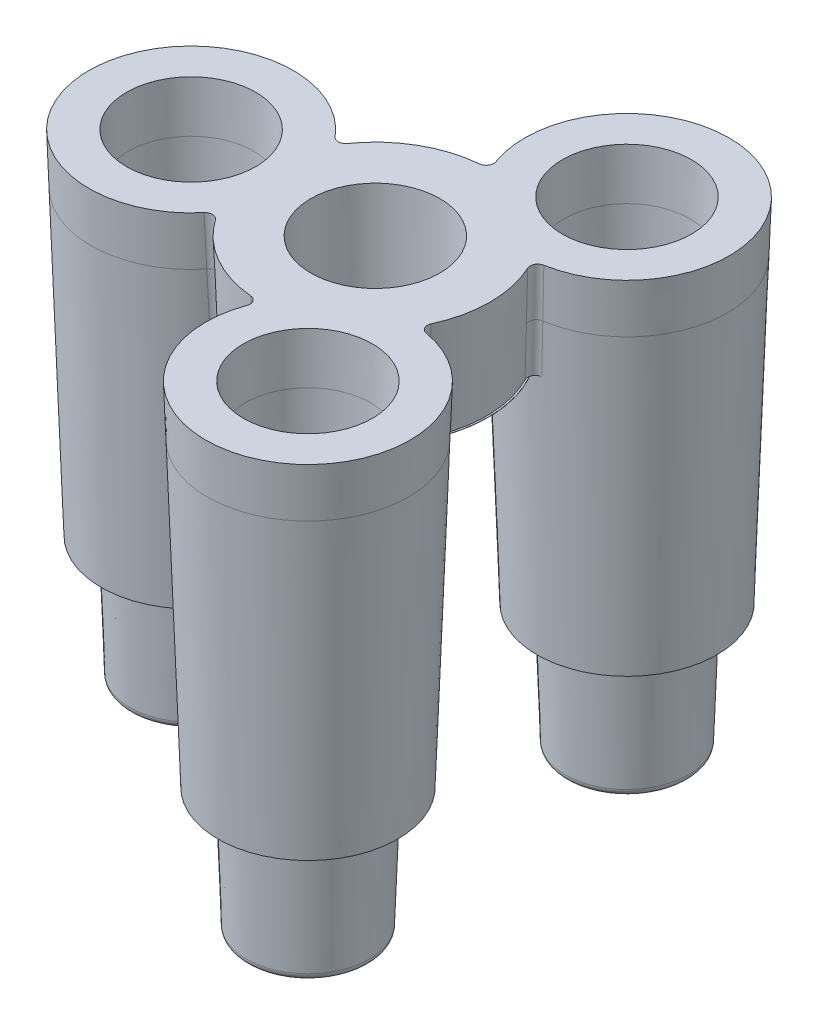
ISO-10303-21;
HEADER;
FILE_DESCRIPTION(('STEP AP214'),'2;1');
FILE_NAME('part.step','',(''),(''),'','','');
FILE_SCHEMA(('AUTOMOTIVE_DESIGN { 1 0 10303 214 1 1 1 1 }'));
ENDSEC;
DATA;
#1=APPLICATION_CONTEXT('core data for automotive mechanical design processes');
#2=APPLICATION_PROTOCOL_DEFINITION('international standard','automotive_design',2000,#1);
#3=PRODUCT_CONTEXT('',#1,'mechanical');
#4=PRODUCT('Part','Part','',(#3));
#5=PRODUCT_RELATED_PRODUCT_CATEGORY('part','',(#4));
#6=PRODUCT_DEFINITION_FORMATION('','',#4);
#7=PRODUCT_DEFINITION_CONTEXT('part definition',#1,'design');
#8=PRODUCT_DEFINITION('design','',#6,#7);
#9=PRODUCT_DEFINITION_SHAPE('','',#8);
#10=(LENGTH_UNIT() NAMED_UNIT(*) SI_UNIT(.MILLI.,.METRE.));
#11=(NAMED_UNIT(*) PLANE_ANGLE_UNIT() SI_UNIT($,.RADIAN.));
#12=(NAMED_UNIT(*) SI_UNIT($,.STERADIAN.) SOLID_ANGLE_UNIT());
#13=UNCERTAINTY_MEASURE_WITH_UNIT(LENGTH_MEASURE(1.E-05),#10,'distance_accuracy_value','');
#14=(GEOMETRIC_REPRESENTATION_CONTEXT(3) GLOBAL_UNCERTAINTY_ASSIGNED_CONTEXT((#13)) GLOBAL_UNIT_ASSIGNED_CONTEXT((#10,
#11,#12)) REPRESENTATION_CONTEXT('',''));
#15=CARTESIAN_POINT('',(0.,0.,0.));
#16=DIRECTION('',(0.,0.,1.));
#17=DIRECTION('',(1.,0.,0.));
#18=AXIS2_PLACEMENT_3D('',#15,#16,#17);
#19=CARTESIAN_POINT('',(7.33333333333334,0.,0.));
#20=DIRECTION('',(0.,1.,0.));
#21=DIRECTION('',(0.,0.,1.));
#22=AXIS2_PLACEMENT_3D('',#19,#20,#21);
#23=CONICAL_SURFACE('',#22,4.5,0.0349065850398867);
#24=CARTESIAN_POINT('',(11.1721130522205,-8.29318096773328,2.64445125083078));
#25=CARTESIAN_POINT('',(11.0019229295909,-8.28315839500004,2.63619781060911));
#26=CARTESIAN_POINT('',(10.9217725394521,-8.28315839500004,2.48550221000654));
#27=CARTESIAN_POINT('',(10.8416221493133,-8.28315839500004,2.33480660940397));
#28=CARTESIAN_POINT('',(10.9299124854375,-8.29318096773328,2.18907530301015));
#29=CARTESIAN_POINT('',(11.2108253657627,-7.60231297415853,2.62210464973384));
#30=CARTESIAN_POINT('',(11.0424932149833,-7.59443944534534,2.61228669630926));
#31=CARTESIAN_POINT('',(10.9634233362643,-7.59261921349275,2.46315947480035));
#32=CARTESIAN_POINT('',(10.8841385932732,-7.59443944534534,2.31414727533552));
#33=CARTESIAN_POINT('',(10.9702570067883,-7.60231297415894,2.16918027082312));
#34=CARTESIAN_POINT('',(11.2487020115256,-6.91137015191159,2.60027465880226));
#35=CARTESIAN_POINT('',(11.0822735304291,-6.90364830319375,2.58894510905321));
#36=CARTESIAN_POINT('',(11.0041186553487,-6.90197473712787,2.44137808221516));
#37=CARTESIAN_POINT('',(10.9257716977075,-6.90364830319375,2.29391359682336));
#38=CARTESIAN_POINT('',(11.009725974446,-6.91137015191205,2.14976710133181));
#39=CARTESIAN_POINT('',(11.3230259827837,-5.52936124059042,2.55750479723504));
#40=CARTESIAN_POINT('',(11.160254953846,-5.52220358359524,2.54337192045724));
#41=CARTESIAN_POINT('',(11.0838695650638,-5.52051389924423,2.39877878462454));
#42=CARTESIAN_POINT('',(11.0072879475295,-5.52220358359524,2.25429052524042));
#43=CARTESIAN_POINT('',(11.087161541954,-5.52936124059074,2.11176287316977));
#44=CARTESIAN_POINT('',(11.3594733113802,-4.83829515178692,2.53656492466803));
#45=CARTESIAN_POINT('',(11.1984825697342,-4.83121538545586,2.52112392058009));
#46=CARTESIAN_POINT('',(11.1229251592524,-4.82969753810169,2.37796087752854));
#47=CARTESIAN_POINT('',(11.0471992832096,-4.83121538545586,2.23488746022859));
#48=CARTESIAN_POINT('',(11.1251281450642,-4.83829515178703,2.09317181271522));
#49=CARTESIAN_POINT('',(11.467033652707,-2.76496511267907,2.47486623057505));
#50=CARTESIAN_POINT('',(11.3109305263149,-2.76311001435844,2.45591975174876));
#51=CARTESIAN_POINT('',(11.2380384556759,-2.75706222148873,2.31671398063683));
#52=CARTESIAN_POINT('',(11.1644743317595,-2.76311001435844,2.17786579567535));
#53=CARTESIAN_POINT('',(11.2371467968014,-2.76496511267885,2.03841972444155));
#54=CARTESIAN_POINT('',(11.536366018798,-1.38255135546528,2.43522775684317));
#55=CARTESIAN_POINT('',(11.3835349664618,-1.38008598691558,2.41414032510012));
#56=CARTESIAN_POINT('',(11.3120437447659,-1.37503900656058,2.27749124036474));
#57=CARTESIAN_POINT('',(11.2400268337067,-1.38008598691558,2.14111991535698));
#58=CARTESIAN_POINT('',(11.3093187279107,-1.38255135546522,2.00327927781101));
#59=CARTESIAN_POINT('',(11.6715320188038,1.38254230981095,2.35819280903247));
#60=CARTESIAN_POINT('',(11.5247468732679,1.3843402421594,2.3333837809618));
#61=CARTESIAN_POINT('',(11.4559913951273,1.38936470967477,2.20143434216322));
#62=CARTESIAN_POINT('',(11.3867127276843,1.3843402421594,2.0697613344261));
#63=CARTESIAN_POINT('',(11.449939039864,1.38254230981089,1.93498983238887));
#64=CARTESIAN_POINT('',(11.737365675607,2.76522221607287,2.32079632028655));
#65=CARTESIAN_POINT('',(11.5934666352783,2.76738584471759,2.29433870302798));
#66=CARTESIAN_POINT('',(11.5259337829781,2.7717452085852,2.16460016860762));
#67=CARTESIAN_POINT('',(11.4579647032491,2.76738584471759,2.03509106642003));
#68=CARTESIAN_POINT('',(11.5183874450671,2.76522221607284,1.90184082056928));
#69=CARTESIAN_POINT('',(11.8662758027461,5.53080906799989,2.24779684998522));
#70=CARTESIAN_POINT('',(11.7277801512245,5.53264070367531,2.21844344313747));
#71=CARTESIAN_POINT('',(11.6625996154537,5.53679763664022,2.09282463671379));
#72=CARTESIAN_POINT('',(11.5970134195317,5.53264070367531,1.96741855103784));
#73=CARTESIAN_POINT('',(11.652331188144,5.53080906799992,1.83710244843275));
#74=CARTESIAN_POINT('',(11.9293522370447,6.91371601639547,2.21219389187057));
#75=CARTESIAN_POINT('',(11.7934551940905,6.91613540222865,2.18154470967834));
#76=CARTESIAN_POINT('',(11.729323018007,6.91946956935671,2.05788330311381));
#77=CARTESIAN_POINT('',(11.664895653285,6.91613540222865,1.93437477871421));
#78=CARTESIAN_POINT('',(11.7178264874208,6.91371601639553,1.80551310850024));
#79=CARTESIAN_POINT('',(11.9914197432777,8.29669434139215,2.17726407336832));
#80=CARTESIAN_POINT('',(11.858092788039,8.30223170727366,2.14539402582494));
#81=CARTESIAN_POINT('',(11.7948577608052,8.30223170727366,2.02364111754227));
#82=CARTESIAN_POINT('',(11.7316227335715,8.30223170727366,1.9018882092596));
#83=CARTESIAN_POINT('',(11.7822293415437,8.29669434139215,1.77448825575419));
#84=(BOUNDED_SURFACE() B_SPLINE_SURFACE(3,2,((#24,#25,#26,#27,#28),(#29,#30,#31,#32,#33),(#34,
#35,#36,#37,#38),(#39,#40,#41,#42,#43),(#44,#45,#46,#47,#48),(#49,#50,#51,#52,#53),(#54,#55,#56,
#57,#58),(#59,#60,#61,#62,#63),(#64,#65,#66,#67,#68),(#69,#70,#71,#72,#73),(#74,#75,#76,#77,
#78),(#79,#80,#81,#82,#83)),.UNSPECIFIED.,.F.,.F.,.F.) B_SPLINE_SURFACE_WITH_KNOTS((4,2,2,2,2,
4),(3,2,3),(0.,2.07745063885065,4.15489676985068,8.30973480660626,12.4645456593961,
16.6194107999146),(0.,0.5,1.),
.UNSPECIFIED.) GEOMETRIC_REPRESENTATION_ITEM() RATIONAL_B_SPLINE_SURFACE(((1.,0.869170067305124,
1.,0.869170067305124,1.),(1.,0.871532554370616,1.,0.871532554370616,1.),(1.,0.8737714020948,1.,
0.8737714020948,1.),(1.,0.878036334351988,1.,0.878036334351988,1.),(1.,0.880062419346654,1.,
0.880062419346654,1.),(1.,0.885873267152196,1.,0.885873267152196,1.),(1.,0.889390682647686,1.,
0.889390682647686,1.),(1.,0.895894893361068,1.,0.895894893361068,1.),(1.,0.898881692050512,1.,
0.898881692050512,1.),(1.,0.904435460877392,1.,0.904435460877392,1.),(1.,0.90700242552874,1.,
0.90700242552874,1.),(1.,0.909414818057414,1.,0.909414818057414,1.))) REPRESENTATION_ITEM('') SURFACE());
#85=CARTESIAN_POINT('',(11.7822293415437,8.29669434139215,1.77448825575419));
#86=CARTESIAN_POINT('',(11.7178264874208,6.91371601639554,1.80551310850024));
#87=CARTESIAN_POINT('',(11.652331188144,5.53080906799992,1.83710244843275));
#88=CARTESIAN_POINT('',(11.5183874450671,2.76522221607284,1.90184082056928));
#89=CARTESIAN_POINT('',(11.449939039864,1.38254230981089,1.93498983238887));
#90=CARTESIAN_POINT('',(11.3093187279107,-1.38255135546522,2.00327927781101));
#91=CARTESIAN_POINT('',(11.2371467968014,-2.76496511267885,2.03841972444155));
#92=CARTESIAN_POINT('',(11.1251281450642,-4.83829515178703,2.09317181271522));
#93=CARTESIAN_POINT('',(11.087161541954,-5.52936124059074,2.11176287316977));
#94=CARTESIAN_POINT('',(11.009725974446,-6.91137015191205,2.14976710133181));
#95=CARTESIAN_POINT('',(10.9702570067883,-7.60231297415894,2.16918027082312));
#96=CARTESIAN_POINT('',(10.9299124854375,-8.29318096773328,2.18907530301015));
#97=B_SPLINE_CURVE_WITH_KNOTS('',3,(#85,#86,#87,#88,#89,#90,#91,#92,#93,#94,#95,#96),
.UNSPECIFIED.,.F.,.F.,(4,2,2,2,2,4),(0.,4.15486514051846,8.3096759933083,12.4645140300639,
14.5419601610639,16.6194107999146),.UNSPECIFIED.);
#98=CARTESIAN_POINT('',(11.4800729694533,2.,1.92041716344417));
#99=VERTEX_POINT('',#98);
#100=CARTESIAN_POINT('',(11.3796291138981,0.,1.9691344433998));
#101=VERTEX_POINT('',#100);
#102=EDGE_CURVE('E241',#99,#101,#97,.T.);
#103=ORIENTED_EDGE('',*,*,#102,.T.);
#104=CARTESIAN_POINT('',(11.7822293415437,8.29669434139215,1.77448825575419));
#105=CARTESIAN_POINT('',(11.7316227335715,8.30223170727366,1.9018882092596));
#106=CARTESIAN_POINT('',(11.7948577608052,8.30223170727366,2.02364111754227));
#107=CARTESIAN_POINT('',(11.858092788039,8.30223170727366,2.14539402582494));
#108=CARTESIAN_POINT('',(11.9914197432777,8.29669434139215,2.17726407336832));
#109=CARTESIAN_POINT('',(11.7178264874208,6.91371601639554,1.80551310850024));
#110=CARTESIAN_POINT('',(11.664895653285,6.91613540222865,1.93437477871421));
#111=CARTESIAN_POINT('',(11.729323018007,6.91946956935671,2.05788330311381));
#112=CARTESIAN_POINT('',(11.7934551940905,6.91613540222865,2.18154470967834));
#113=CARTESIAN_POINT('',(11.9293522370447,6.91371601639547,2.21219389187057));
#114=CARTESIAN_POINT('',(11.652331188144,5.53080906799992,1.83710244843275));
#115=CARTESIAN_POINT('',(11.5970134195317,5.53264070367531,1.96741855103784));
#116=CARTESIAN_POINT('',(11.6625996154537,5.53679763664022,2.09282463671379));
#117=CARTESIAN_POINT('',(11.7277801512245,5.53264070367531,2.21844344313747));
#118=CARTESIAN_POINT('',(11.8662758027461,5.53080906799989,2.24779684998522));
#119=CARTESIAN_POINT('',(11.5183874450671,2.76522221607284,1.90184082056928));
#120=CARTESIAN_POINT('',(11.4579647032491,2.76738584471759,2.03509106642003));
#121=CARTESIAN_POINT('',(11.5259337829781,2.7717452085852,2.16460016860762));
#122=CARTESIAN_POINT('',(11.5934666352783,2.76738584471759,2.29433870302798));
#123=CARTESIAN_POINT('',(11.737365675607,2.76522221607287,2.32079632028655));
#124=CARTESIAN_POINT('',(11.449939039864,1.38254230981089,1.93498983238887));
#125=CARTESIAN_POINT('',(11.3867127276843,1.38434024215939,2.0697613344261));
#126=CARTESIAN_POINT('',(11.4559913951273,1.38936470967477,2.20143434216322));
#127=CARTESIAN_POINT('',(11.5247468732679,1.3843402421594,2.3333837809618));
#128=CARTESIAN_POINT('',(11.6715320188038,1.38254230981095,2.35819280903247));
#129=CARTESIAN_POINT('',(11.3093187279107,-1.38255135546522,2.00327927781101));
#130=CARTESIAN_POINT('',(11.2400268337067,-1.38008598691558,2.14111991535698));
#131=CARTESIAN_POINT('',(11.3120437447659,-1.37503900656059,2.27749124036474));
#132=CARTESIAN_POINT('',(11.3835349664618,-1.38008598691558,2.41414032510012));
#133=CARTESIAN_POINT('',(11.536366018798,-1.38255135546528,2.43522775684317));
#134=CARTESIAN_POINT('',(11.2371467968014,-2.76496511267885,2.03841972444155));
#135=CARTESIAN_POINT('',(11.1644743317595,-2.76311001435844,2.17786579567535));
#136=CARTESIAN_POINT('',(11.2380384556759,-2.75706222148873,2.31671398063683));
#137=CARTESIAN_POINT('',(11.3109305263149,-2.76311001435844,2.45591975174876));
#138=CARTESIAN_POINT('',(11.467033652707,-2.76496511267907,2.47486623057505));
#139=CARTESIAN_POINT('',(11.1251281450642,-4.83829515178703,2.09317181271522));
#140=CARTESIAN_POINT('',(11.0471992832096,-4.83121538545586,2.23488746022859));
#141=CARTESIAN_POINT('',(11.1229251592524,-4.82969753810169,2.37796087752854));
#142=CARTESIAN_POINT('',(11.1984825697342,-4.83121538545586,2.52112392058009));
#143=CARTESIAN_POINT('',(11.3594733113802,-4.83829515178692,2.53656492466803));
#144=CARTESIAN_POINT('',(11.087161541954,-5.52936124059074,2.11176287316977));
#145=CARTESIAN_POINT('',(11.0072879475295,-5.52220358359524,2.25429052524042));
#146=CARTESIAN_POINT('',(11.0838695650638,-5.52051389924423,2.39877878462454));
#147=CARTESIAN_POINT('',(11.160254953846,-5.52220358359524,2.54337192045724));
#148=CARTESIAN_POINT('',(11.3230259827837,-5.52936124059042,2.55750479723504));
#149=CARTESIAN_POINT('',(11.009725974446,-6.91137015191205,2.14976710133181));
#150=CARTESIAN_POINT('',(10.9257716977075,-6.90364830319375,2.29391359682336));
#151=CARTESIAN_POINT('',(11.0041186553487,-6.90197473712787,2.44137808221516));
#152=CARTESIAN_POINT('',(11.0822735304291,-6.90364830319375,2.58894510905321));
#153=CARTESIAN_POINT('',(11.2487020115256,-6.91137015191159,2.60027465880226));
#154=CARTESIAN_POINT('',(10.9702570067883,-7.60231297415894,2.16918027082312));
#155=CARTESIAN_POINT('',(10.8841385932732,-7.59443944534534,2.31414727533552));
#156=CARTESIAN_POINT('',(10.9634233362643,-7.59261921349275,2.46315947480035));
#157=CARTESIAN_POINT('',(11.0424932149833,-7.59443944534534,2.61228669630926));
#158=CARTESIAN_POINT('',(11.2108253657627,-7.60231297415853,2.62210464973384));
#159=CARTESIAN_POINT('',(10.9299124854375,-8.29318096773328,2.18907530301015));
#160=CARTESIAN_POINT('',(10.8416221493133,-8.28315839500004,2.33480660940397));
#161=CARTESIAN_POINT('',(10.9217725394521,-8.28315839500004,2.48550221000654));
#162=CARTESIAN_POINT('',(11.0019229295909,-8.28315839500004,2.63619781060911));
#163=CARTESIAN_POINT('',(11.1721130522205,-8.29318096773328,2.64445125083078));
#164=(BOUNDED_SURFACE() B_SPLINE_SURFACE(3,2,((#104,#105,#106,#107,#108),(#109,#110,#111,#112,
#113),(#114,#115,#116,#117,#118),(#119,#120,#121,#122,#123),(#124,#125,#126,#127,#128),(#129,
#130,#131,#132,#133),(#134,#135,#136,#137,#138),(#139,#140,#141,#142,#143),(#144,#145,#146,#147,
#148),(#149,#150,#151,#152,#153),(#154,#155,#156,#157,#158),(#159,#160,#161,#162,#163)),
.UNSPECIFIED.,.F.,.F.,.F.) B_SPLINE_SURFACE_WITH_KNOTS((4,2,2,2,2,4),(3,2,3),(0.,
4.15486514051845,8.3096759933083,12.4645140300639,14.5419601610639,16.6194107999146),(0.,0.5,
1.),.UNSPECIFIED.) GEOMETRIC_REPRESENTATION_ITEM() RATIONAL_B_SPLINE_SURFACE(((1.,
0.909414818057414,1.,0.909414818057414,1.),(1.,0.90700242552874,1.,0.90700242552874,1.),(1.,
0.904435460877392,1.,0.904435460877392,1.),(1.,0.898881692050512,1.,0.898881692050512,1.),(1.,
0.895894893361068,1.,0.895894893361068,1.),(1.,0.889390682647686,1.,0.889390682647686,1.),(1.,
0.885873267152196,1.,0.885873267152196,1.),(1.,0.880062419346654,1.,0.880062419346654,1.),(1.,
0.878036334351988,1.,0.878036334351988,1.),(1.,0.8737714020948,1.,0.8737714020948,1.),(1.,
0.871532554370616,1.,0.871532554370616,1.),(1.,0.869170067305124,1.,0.869170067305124,1.))) REPRESENTATION_ITEM('') SURFACE());
#165=CARTESIAN_POINT('',(11.7822293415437,8.29669434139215,1.77448825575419));
#166=CARTESIAN_POINT('',(11.7178264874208,6.91371601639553,1.80551310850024));
#167=CARTESIAN_POINT('',(11.652331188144,5.53080906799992,1.83710244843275));
#168=CARTESIAN_POINT('',(11.5183874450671,2.76522221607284,1.90184082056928));
#169=CARTESIAN_POINT('',(11.449939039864,1.38254230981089,1.93498983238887));
#170=CARTESIAN_POINT('',(11.3093187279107,-1.38255135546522,2.00327927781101));
#171=CARTESIAN_POINT('',(11.2371467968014,-2.76496511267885,2.03841972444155));
#172=CARTESIAN_POINT('',(11.1251281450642,-4.83829515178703,2.09317181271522));
#173=CARTESIAN_POINT('',(11.087161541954,-5.52936124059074,2.11176287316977));
#174=CARTESIAN_POINT('',(11.009725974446,-6.91137015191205,2.14976710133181));
#175=CARTESIAN_POINT('',(10.9702570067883,-7.60231297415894,2.16918027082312));
#176=CARTESIAN_POINT('',(10.9299124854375,-8.29318096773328,2.18907530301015));
#177=B_SPLINE_CURVE_WITH_KNOTS('',3,(#165,#166,#167,#168,#169,#170,#171,#172,#173,#174,#175,
#176),.UNSPECIFIED.,.F.,.F.,(4,2,2,2,2,4),(0.,4.15486514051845,8.3096759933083,12.4645140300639,
14.5419601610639,16.6194107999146),.UNSPECIFIED.);
#178=CARTESIAN_POINT('',(11.2765371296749,-2.,2.01926912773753));
#179=VERTEX_POINT('',#178);
#180=EDGE_CURVE('E248',#101,#179,#177,.T.);
#181=ORIENTED_EDGE('',*,*,#180,.T.);
#182=CARTESIAN_POINT('',(7.33333333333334,-2.,0.));
#183=DIRECTION('',(0.,-1.,0.));
#184=DIRECTION('',(0.,0.,-1.));
#185=AXIS2_PLACEMENT_3D('',#182,#183,#184);
#186=CIRCLE('',#185,4.43015846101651);
#187=CARTESIAN_POINT('',(11.2765371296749,-2.,-2.01926912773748));
#188=VERTEX_POINT('',#187);
#189=EDGE_CURVE('E1690',#188,#179,#186,.T.);
#190=ORIENTED_EDGE('',*,*,#189,.F.);
#191=CARTESIAN_POINT('',(11.9914197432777,8.29669434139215,-2.17726407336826));
#192=CARTESIAN_POINT('',(11.858092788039,8.30223170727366,-2.14539402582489));
#193=CARTESIAN_POINT('',(11.7948577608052,8.30223170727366,-2.02364111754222));
#194=CARTESIAN_POINT('',(11.7316227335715,8.30223170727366,-1.90188820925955));
#195=CARTESIAN_POINT('',(11.7822293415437,8.29669434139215,-1.77448825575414));
#196=CARTESIAN_POINT('',(11.9293522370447,6.91371601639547,-2.21219389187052));
#197=CARTESIAN_POINT('',(11.7934551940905,6.91613540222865,-2.18154470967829));
#198=CARTESIAN_POINT('',(11.729323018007,6.91946956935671,-2.05788330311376));
#199=CARTESIAN_POINT('',(11.664895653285,6.91613540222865,-1.93437477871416));
#200=CARTESIAN_POINT('',(11.7178264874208,6.91371601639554,-1.80551310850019));
#201=CARTESIAN_POINT('',(11.8662758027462,5.53080906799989,-2.24779684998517));
#202=CARTESIAN_POINT('',(11.7277801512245,5.53264070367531,-2.21844344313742));
#203=CARTESIAN_POINT('',(11.6625996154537,5.53679763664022,-2.09282463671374));
#204=CARTESIAN_POINT('',(11.5970134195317,5.53264070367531,-1.96741855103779));
#205=CARTESIAN_POINT('',(11.652331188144,5.53080906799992,-1.8371024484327));
#206=CARTESIAN_POINT('',(11.7373656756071,2.76522221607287,-2.3207963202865));
#207=CARTESIAN_POINT('',(11.5934666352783,2.76738584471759,-2.29433870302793));
#208=CARTESIAN_POINT('',(11.5259337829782,2.7717452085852,-2.16460016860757));
#209=CARTESIAN_POINT('',(11.4579647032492,2.76738584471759,-2.03509106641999));
#210=CARTESIAN_POINT('',(11.5183874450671,2.76522221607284,-1.90184082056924));
#211=CARTESIAN_POINT('',(11.6715320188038,1.38254230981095,-2.35819280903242));
#212=CARTESIAN_POINT('',(11.5247468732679,1.3843402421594,-2.33338378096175));
#213=CARTESIAN_POINT('',(11.4559913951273,1.38936470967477,-2.20143434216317));
#214=CARTESIAN_POINT('',(11.3867127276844,1.3843402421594,-2.06976133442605));
#215=CARTESIAN_POINT('',(11.449939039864,1.38254230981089,-1.93498983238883));
#216=CARTESIAN_POINT('',(11.536366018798,-1.38255135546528,-2.43522775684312));
#217=CARTESIAN_POINT('',(11.3835349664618,-1.38008598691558,-2.41414032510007));
#218=CARTESIAN_POINT('',(11.3120437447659,-1.37503900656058,-2.2774912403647));
#219=CARTESIAN_POINT('',(11.2400268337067,-1.38008598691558,-2.14111991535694));
#220=CARTESIAN_POINT('',(11.3093187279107,-1.38255135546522,-2.00327927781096));
#221=CARTESIAN_POINT('',(11.4670336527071,-2.76496511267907,-2.474866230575));
#222=CARTESIAN_POINT('',(11.3109305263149,-2.76311001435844,-2.45591975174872));
#223=CARTESIAN_POINT('',(11.2380384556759,-2.75706222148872,-2.31671398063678));
#224=CARTESIAN_POINT('',(11.1644743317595,-2.76311001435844,-2.1778657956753));
#225=CARTESIAN_POINT('',(11.2371467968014,-2.76496511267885,-2.0384197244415));
#226=CARTESIAN_POINT('',(11.3594733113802,-4.83829515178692,-2.53656492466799));
#227=CARTESIAN_POINT('',(11.1984825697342,-4.83121538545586,-2.52112392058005));
#228=CARTESIAN_POINT('',(11.1229251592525,-4.82969753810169,-2.3779608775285));
#229=CARTESIAN_POINT('',(11.0471992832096,-4.83121538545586,-2.23488746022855));
#230=CARTESIAN_POINT('',(11.1251281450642,-4.83829515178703,-2.09317181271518));
#231=CARTESIAN_POINT('',(11.3230259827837,-5.52936124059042,-2.55750479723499));
#232=CARTESIAN_POINT('',(11.1602549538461,-5.52220358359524,-2.5433719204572));
#233=CARTESIAN_POINT('',(11.0838695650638,-5.52051389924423,-2.3987787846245));
#234=CARTESIAN_POINT('',(11.0072879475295,-5.52220358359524,-2.25429052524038));
#235=CARTESIAN_POINT('',(11.0871615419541,-5.52936124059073,-2.11176287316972));
#236=CARTESIAN_POINT('',(11.2487020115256,-6.91137015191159,-2.60027465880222));
#237=CARTESIAN_POINT('',(11.0822735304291,-6.90364830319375,-2.58894510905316));
#238=CARTESIAN_POINT('',(11.0041186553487,-6.90197473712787,-2.44137808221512));
#239=CARTESIAN_POINT('',(10.9257716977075,-6.90364830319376,-2.29391359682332));
#240=CARTESIAN_POINT('',(11.009725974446,-6.91137015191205,-2.14976710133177));
#241=CARTESIAN_POINT('',(11.2108253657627,-7.60231297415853,-2.6221046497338));
#242=CARTESIAN_POINT('',(11.0424932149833,-7.59443944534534,-2.61228669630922));
#243=CARTESIAN_POINT('',(10.9634233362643,-7.59261921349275,-2.46315947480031));
#244=CARTESIAN_POINT('',(10.8841385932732,-7.59443944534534,-2.31414727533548));
#245=CARTESIAN_POINT('',(10.9702570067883,-7.60231297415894,-2.16918027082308));
#246=CARTESIAN_POINT('',(11.1721130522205,-8.29318096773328,-2.64445125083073));
#247=CARTESIAN_POINT('',(11.0019229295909,-8.28315839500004,-2.63619781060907));
#248=CARTESIAN_POINT('',(10.9217725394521,-8.28315839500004,-2.48550221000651));
#249=CARTESIAN_POINT('',(10.8416221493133,-8.28315839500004,-2.33480660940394));
#250=CARTESIAN_POINT('',(10.9299124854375,-8.29318096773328,-2.18907530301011));
#251=(BOUNDED_SURFACE() B_SPLINE_SURFACE(3,2,((#191,#192,#193,#194,#195),(#196,#197,#198,#199,
#200),(#201,#202,#203,#204,#205),(#206,#207,#208,#209,#210),(#211,#212,#213,#214,#215),(#216,
#217,#218,#219,#220),(#221,#222,#223,#224,#225),(#226,#227,#228,#229,#230),(#231,#232,#233,#234,
#235),(#236,#237,#238,#239,#240),(#241,#242,#243,#244,#245),(#246,#247,#248,#249,#250)),
.UNSPECIFIED.,.F.,.F.,.F.) B_SPLINE_SURFACE_WITH_KNOTS((4,2,2,2,2,4),(3,2,3),(0.,
4.15486514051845,8.3096759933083,12.4645140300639,14.5419601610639,16.6194107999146),(0.,0.5,
1.),.UNSPECIFIED.) GEOMETRIC_REPRESENTATION_ITEM() RATIONAL_B_SPLINE_SURFACE(((1.,
0.909414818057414,1.,0.909414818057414,1.),(1.,0.90700242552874,1.,0.90700242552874,1.),(1.,
0.904435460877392,1.,0.904435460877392,1.),(1.,0.898881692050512,1.,0.898881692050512,1.),(1.,
0.895894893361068,1.,0.895894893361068,1.),(1.,0.889390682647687,1.,0.889390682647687,1.),(1.,
0.885873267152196,1.,0.885873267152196,1.),(1.,0.880062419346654,1.,0.880062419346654,1.),(1.,
0.878036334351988,1.,0.878036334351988,1.),(1.,0.8737714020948,1.,0.8737714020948,1.),(1.,
0.871532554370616,1.,0.871532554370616,1.),(1.,0.869170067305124,1.,0.869170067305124,1.))) REPRESENTATION_ITEM('') SURFACE());
#252=CARTESIAN_POINT('',(10.9299124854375,-8.29318096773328,-2.18907530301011));
#253=CARTESIAN_POINT('',(10.9702570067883,-7.60231297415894,-2.16918027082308));
#254=CARTESIAN_POINT('',(11.009725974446,-6.91137015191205,-2.14976710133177));
#255=CARTESIAN_POINT('',(11.0871615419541,-5.52936124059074,-2.11176287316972));
#256=CARTESIAN_POINT('',(11.1251281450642,-4.83829515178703,-2.09317181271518));
#257=CARTESIAN_POINT('',(11.2371467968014,-2.76496511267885,-2.0384197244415));
#258=CARTESIAN_POINT('',(11.3093187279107,-1.38255135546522,-2.00327927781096));
#259=CARTESIAN_POINT('',(11.449939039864,1.38254230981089,-1.93498983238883));
#260=CARTESIAN_POINT('',(11.5183874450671,2.76522221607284,-1.90184082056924));
#261=CARTESIAN_POINT('',(11.652331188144,5.53080906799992,-1.8371024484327));
#262=CARTESIAN_POINT('',(11.7178264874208,6.91371601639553,-1.80551310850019));
#263=CARTESIAN_POINT('',(11.7822293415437,8.29669434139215,-1.77448825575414));
#264=B_SPLINE_CURVE_WITH_KNOTS('',3,(#252,#253,#254,#255,#256,#257,#258,#259,#260,#261,#262,
#263),.UNSPECIFIED.,.F.,.F.,(4,2,2,2,2,4),(0.,2.07745063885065,4.15489676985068,
8.30973480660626,12.4645456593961,16.6194107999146),.UNSPECIFIED.);
#265=CARTESIAN_POINT('',(11.3796291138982,0.,-1.96913444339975));
#266=VERTEX_POINT('',#265);
#267=EDGE_CURVE('E1647',#188,#266,#264,.T.);
#268=ORIENTED_EDGE('',*,*,#267,.T.);
#269=CARTESIAN_POINT('',(10.9299124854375,-8.29318096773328,-2.18907530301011));
#270=CARTESIAN_POINT('',(10.8416221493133,-8.28315839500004,-2.33480660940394));
#271=CARTESIAN_POINT('',(10.9217725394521,-8.28315839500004,-2.48550221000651));
#272=CARTESIAN_POINT('',(11.0019229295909,-8.28315839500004,-2.63619781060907));
#273=CARTESIAN_POINT('',(11.1721130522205,-8.29318096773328,-2.64445125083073));
#274=CARTESIAN_POINT('',(10.9702570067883,-7.60231297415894,-2.16918027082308));
#275=CARTESIAN_POINT('',(10.8841385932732,-7.59443944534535,-2.31414727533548));
#276=CARTESIAN_POINT('',(10.9634233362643,-7.59261921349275,-2.46315947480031));
#277=CARTESIAN_POINT('',(11.0424932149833,-7.59443944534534,-2.61228669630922));
#278=CARTESIAN_POINT('',(11.2108253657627,-7.60231297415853,-2.6221046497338));
#279=CARTESIAN_POINT('',(11.009725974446,-6.91137015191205,-2.14976710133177));
#280=CARTESIAN_POINT('',(10.9257716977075,-6.90364830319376,-2.29391359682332));
#281=CARTESIAN_POINT('',(11.0041186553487,-6.90197473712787,-2.44137808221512));
#282=CARTESIAN_POINT('',(11.0822735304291,-6.90364830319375,-2.58894510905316));
#283=CARTESIAN_POINT('',(11.2487020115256,-6.91137015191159,-2.60027465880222));
#284=CARTESIAN_POINT('',(11.0871615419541,-5.52936124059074,-2.11176287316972));
#285=CARTESIAN_POINT('',(11.0072879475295,-5.52220358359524,-2.25429052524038));
#286=CARTESIAN_POINT('',(11.0838695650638,-5.52051389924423,-2.3987787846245));
#287=CARTESIAN_POINT('',(11.1602549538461,-5.52220358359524,-2.5433719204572));
#288=CARTESIAN_POINT('',(11.3230259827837,-5.52936124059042,-2.55750479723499));
#289=CARTESIAN_POINT('',(11.1251281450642,-4.83829515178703,-2.09317181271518));
#290=CARTESIAN_POINT('',(11.0471992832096,-4.83121538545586,-2.23488746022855));
#291=CARTESIAN_POINT('',(11.1229251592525,-4.82969753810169,-2.3779608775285));
#292=CARTESIAN_POINT('',(11.1984825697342,-4.83121538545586,-2.52112392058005));
#293=CARTESIAN_POINT('',(11.3594733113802,-4.83829515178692,-2.53656492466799));
#294=CARTESIAN_POINT('',(11.2371467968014,-2.76496511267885,-2.0384197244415));
#295=CARTESIAN_POINT('',(11.1644743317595,-2.76311001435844,-2.1778657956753));
#296=CARTESIAN_POINT('',(11.2380384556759,-2.75706222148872,-2.31671398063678));
#297=CARTESIAN_POINT('',(11.3109305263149,-2.76311001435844,-2.45591975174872));
#298=CARTESIAN_POINT('',(11.4670336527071,-2.76496511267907,-2.474866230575));
#299=CARTESIAN_POINT('',(11.3093187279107,-1.38255135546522,-2.00327927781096));
#300=CARTESIAN_POINT('',(11.2400268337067,-1.38008598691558,-2.14111991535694));
#301=CARTESIAN_POINT('',(11.3120437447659,-1.37503900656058,-2.2774912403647));
#302=CARTESIAN_POINT('',(11.3835349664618,-1.38008598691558,-2.41414032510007));
#303=CARTESIAN_POINT('',(11.536366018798,-1.38255135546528,-2.43522775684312));
#304=CARTESIAN_POINT('',(11.449939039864,1.38254230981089,-1.93498983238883));
#305=CARTESIAN_POINT('',(11.3867127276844,1.3843402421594,-2.06976133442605));
#306=CARTESIAN_POINT('',(11.4559913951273,1.38936470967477,-2.20143434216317));
#307=CARTESIAN_POINT('',(11.5247468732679,1.3843402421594,-2.33338378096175));
#308=CARTESIAN_POINT('',(11.6715320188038,1.38254230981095,-2.35819280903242));
#309=CARTESIAN_POINT('',(11.5183874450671,2.76522221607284,-1.90184082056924));
#310=CARTESIAN_POINT('',(11.4579647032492,2.76738584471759,-2.03509106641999));
#311=CARTESIAN_POINT('',(11.5259337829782,2.7717452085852,-2.16460016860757));
#312=CARTESIAN_POINT('',(11.5934666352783,2.76738584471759,-2.29433870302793));
#313=CARTESIAN_POINT('',(11.7373656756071,2.76522221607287,-2.3207963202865));
#314=CARTESIAN_POINT('',(11.652331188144,5.53080906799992,-1.8371024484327));
#315=CARTESIAN_POINT('',(11.5970134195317,5.53264070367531,-1.96741855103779));
#316=CARTESIAN_POINT('',(11.6625996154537,5.53679763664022,-2.09282463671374));
#317=CARTESIAN_POINT('',(11.7277801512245,5.53264070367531,-2.21844344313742));
#318=CARTESIAN_POINT('',(11.8662758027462,5.53080906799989,-2.24779684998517));
#319=CARTESIAN_POINT('',(11.7178264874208,6.91371601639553,-1.80551310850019));
#320=CARTESIAN_POINT('',(11.664895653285,6.91613540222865,-1.93437477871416));
#321=CARTESIAN_POINT('',(11.729323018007,6.91946956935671,-2.05788330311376));
#322=CARTESIAN_POINT('',(11.7934551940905,6.91613540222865,-2.18154470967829));
#323=CARTESIAN_POINT('',(11.9293522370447,6.91371601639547,-2.21219389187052));
#324=CARTESIAN_POINT('',(11.7822293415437,8.29669434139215,-1.77448825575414));
#325=CARTESIAN_POINT('',(11.7316227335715,8.30223170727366,-1.90188820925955));
#326=CARTESIAN_POINT('',(11.7948577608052,8.30223170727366,-2.02364111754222));
#327=CARTESIAN_POINT('',(11.858092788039,8.30223170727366,-2.14539402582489));
#328=CARTESIAN_POINT('',(11.9914197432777,8.29669434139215,-2.17726407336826));
#329=(BOUNDED_SURFACE() B_SPLINE_SURFACE(3,2,((#269,#270,#271,#272,#273),(#274,#275,#276,#277,
#278),(#279,#280,#281,#282,#283),(#284,#285,#286,#287,#288),(#289,#290,#291,#292,#293),(#294,
#295,#296,#297,#298),(#299,#300,#301,#302,#303),(#304,#305,#306,#307,#308),(#309,#310,#311,#312,
#313),(#314,#315,#316,#317,#318),(#319,#320,#321,#322,#323),(#324,#325,#326,#327,#328)),
.UNSPECIFIED.,.F.,.F.,.F.) B_SPLINE_SURFACE_WITH_KNOTS((4,2,2,2,2,4),(3,2,3),(0.,
2.07745063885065,4.15489676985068,8.30973480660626,12.4645456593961,16.6194107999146),(0.,0.5,
1.),.UNSPECIFIED.) GEOMETRIC_REPRESENTATION_ITEM() RATIONAL_B_SPLINE_SURFACE(((1.,
0.869170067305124,1.,0.869170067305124,1.),(1.,0.871532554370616,1.,0.871532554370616,1.),(1.,
0.8737714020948,1.,0.8737714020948,1.),(1.,0.878036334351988,1.,0.878036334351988,1.),(1.,
0.880062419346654,1.,0.880062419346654,1.),(1.,0.885873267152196,1.,0.885873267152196,1.),(1.,
0.889390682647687,1.,0.889390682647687,1.),(1.,0.895894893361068,1.,0.895894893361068,1.),(1.,
0.898881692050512,1.,0.898881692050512,1.),(1.,0.904435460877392,1.,0.904435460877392,1.),(1.,
0.90700242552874,1.,0.90700242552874,1.),(1.,0.909414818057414,1.,0.909414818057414,1.))) REPRESENTATION_ITEM('') SURFACE());
#330=CARTESIAN_POINT('',(10.9299124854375,-8.29318096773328,-2.18907530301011));
#331=CARTESIAN_POINT('',(10.9702570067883,-7.60231297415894,-2.16918027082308));
#332=CARTESIAN_POINT('',(11.009725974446,-6.91137015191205,-2.14976710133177));
#333=CARTESIAN_POINT('',(11.0871615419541,-5.52936124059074,-2.11176287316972));
#334=CARTESIAN_POINT('',(11.1251281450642,-4.83829515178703,-2.09317181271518));
#335=CARTESIAN_POINT('',(11.2371467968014,-2.76496511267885,-2.0384197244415));
#336=CARTESIAN_POINT('',(11.3093187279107,-1.38255135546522,-2.00327927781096));
#337=CARTESIAN_POINT('',(11.449939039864,1.38254230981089,-1.93498983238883));
#338=CARTESIAN_POINT('',(11.5183874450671,2.76522221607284,-1.90184082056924));
#339=CARTESIAN_POINT('',(11.652331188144,5.53080906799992,-1.8371024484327));
#340=CARTESIAN_POINT('',(11.7178264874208,6.91371601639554,-1.80551310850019));
#341=CARTESIAN_POINT('',(11.7822293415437,8.29669434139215,-1.77448825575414));
#342=B_SPLINE_CURVE_WITH_KNOTS('',3,(#330,#331,#332,#333,#334,#335,#336,#337,#338,#339,#340,
#341),.UNSPECIFIED.,.F.,.F.,(4,2,2,2,2,4),(0.,2.07745063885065,4.15489676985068,
8.30973480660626,12.4645456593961,16.6194107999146),.UNSPECIFIED.);
#343=CARTESIAN_POINT('',(11.4800729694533,2.,-1.92041716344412));
#344=VERTEX_POINT('',#343);
#345=EDGE_CURVE('E254',#266,#344,#342,.T.);
#346=ORIENTED_EDGE('',*,*,#345,.T.);
#347=CARTESIAN_POINT('',(7.33333333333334,2.,0.));
#348=DIRECTION('',(0.,1.,0.));
#349=DIRECTION('',(0.,0.,1.));
#350=AXIS2_PLACEMENT_3D('',#347,#348,#349);
#351=CIRCLE('',#350,4.5698415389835);
#352=EDGE_CURVE('E230',#99,#344,#351,.T.);
#353=ORIENTED_EDGE('',*,*,#352,.F.);
#354=EDGE_LOOP('',(#103,#181,#190,#268,#346,#353));
#355=FACE_BOUND('',#354,.T.);
#356=ADVANCED_FACE('F42',(#355),#23,.T.);
#357=CARTESIAN_POINT('',(7.33333333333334,-2.01,0.));
#358=DIRECTION('',(0.,1.,0.));
#359=DIRECTION('',(0.,0.,1.));
#360=AXIS2_PLACEMENT_3D('',#357,#358,#359);
#361=CYLINDRICAL_SURFACE('',#360,4.5);
#362=CARTESIAN_POINT('',(11.125276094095,-2.01025,2.42304975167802));
#363=CARTESIAN_POINT('',(11.1253143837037,-2.00850000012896,2.42298983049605));
#364=CARTESIAN_POINT('',(11.1253526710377,-2.00675000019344,2.42292990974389));
#365=CARTESIAN_POINT('',(11.1254292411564,-2.00325000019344,2.42281006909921));
#366=CARTESIAN_POINT('',(11.1254675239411,-2.00150000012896,2.42275014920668));
#367=CARTESIAN_POINT('',(11.1255058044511,-1.99975,2.42269022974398));
#368=B_SPLINE_CURVE_WITH_KNOTS('',3,(#362,#363,#364,#365,#366,#367),.UNSPECIFIED.,.F.,.F.,(4,2,
4),(0.,0.00525433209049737,0.0105086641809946),.UNSPECIFIED.);
#369=CARTESIAN_POINT('',(11.1252815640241,-2.01,2.42304119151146));
#370=VERTEX_POINT('',#369);
#371=CARTESIAN_POINT('',(11.1255003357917,-2.,2.42269878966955));
#372=VERTEX_POINT('',#371);
#373=EDGE_CURVE('E419',#370,#372,#368,.T.);
#374=ORIENTED_EDGE('',*,*,#373,.F.);
#375=CARTESIAN_POINT('',(7.33333333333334,-2.01,0.));
#376=DIRECTION('',(0.,-1.,0.));
#377=DIRECTION('',(0.,0.,-1.));
#378=AXIS2_PLACEMENT_3D('',#375,#376,#377);
#379=CIRCLE('',#378,4.5);
#380=CARTESIAN_POINT('',(11.1252815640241,-2.01,-2.42304119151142));
#381=VERTEX_POINT('',#380);
#382=EDGE_CURVE('E409',#381,#370,#379,.T.);
#383=ORIENTED_EDGE('',*,*,#382,.F.);
#384=CARTESIAN_POINT('',(11.1255058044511,-1.99975,-2.42269022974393));
#385=CARTESIAN_POINT('',(11.1254675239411,-2.00150000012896,-2.42275014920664));
#386=CARTESIAN_POINT('',(11.1254292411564,-2.00325000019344,-2.42281006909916));
#387=CARTESIAN_POINT('',(11.1253526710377,-2.00675000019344,-2.42292990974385));
#388=CARTESIAN_POINT('',(11.1253143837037,-2.00850000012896,-2.42298983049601));
#389=CARTESIAN_POINT('',(11.1252760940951,-2.01025,-2.42304975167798));
#390=B_SPLINE_CURVE_WITH_KNOTS('',3,(#384,#385,#386,#387,#388,#389),.UNSPECIFIED.,.F.,.F.,(4,2,
4),(0.,0.00525433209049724,0.0105086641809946),.UNSPECIFIED.);
#391=CARTESIAN_POINT('',(11.1255003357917,-2.,-2.42269878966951));
#392=VERTEX_POINT('',#391);
#393=EDGE_CURVE('E70',#392,#381,#390,.T.);
#394=ORIENTED_EDGE('',*,*,#393,.F.);
#395=CARTESIAN_POINT('',(7.33333333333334,-2.,0.));
#396=DIRECTION('',(0.,-1.,0.));
#397=DIRECTION('',(0.,0.,-1.));
#398=AXIS2_PLACEMENT_3D('',#395,#396,#397);
#399=CIRCLE('',#398,4.5);
#400=CARTESIAN_POINT('',(11.2496589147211,-2.,-2.21639209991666));
#401=VERTEX_POINT('',#400);
#402=EDGE_CURVE('E1543',#392,#401,#399,.T.);
#403=ORIENTED_EDGE('',*,*,#402,.T.);
#404=CARTESIAN_POINT('',(7.33333333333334,-2.,0.));
#405=DIRECTION('',(0.,-1.,0.));
#406=DIRECTION('',(0.,0.,-1.));
#407=AXIS2_PLACEMENT_3D('',#404,#405,#406);
#408=CIRCLE('',#407,4.5);
#409=CARTESIAN_POINT('',(11.249658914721,-2.,2.2163920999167));
#410=VERTEX_POINT('',#409);
#411=EDGE_CURVE('E437',#401,#410,#408,.T.);
#412=ORIENTED_EDGE('',*,*,#411,.T.);
#413=CARTESIAN_POINT('',(7.33333333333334,-2.,0.));
#414=DIRECTION('',(0.,-1.,0.));
#415=DIRECTION('',(0.,0.,-1.));
#416=AXIS2_PLACEMENT_3D('',#413,#414,#415);
#417=CIRCLE('',#416,4.5);
#418=EDGE_CURVE('E1539',#410,#372,#417,.T.);
#419=ORIENTED_EDGE('',*,*,#418,.T.);
#420=EDGE_LOOP('',(#374,#383,#394,#403,#412,#419));
#421=FACE_BOUND('',#420,.T.);
#422=ADVANCED_FACE('F416',(#421),#361,.T.);
#423=CARTESIAN_POINT('',(9.16666666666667,-2.,3.17542648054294));
#424=DIRECTION('',(0.,-1.,0.));
#425=DIRECTION('',(0.,0.,-1.));
#426=AXIS2_PLACEMENT_3D('',#423,#424,#425);
#427=PLANE('',#426);
#428=CARTESIAN_POINT('',(11.2765371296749,-2.00000000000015,2.01926912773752));
#429=CARTESIAN_POINT('',(11.2688346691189,-2.00000000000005,2.03429170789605));
#430=CARTESIAN_POINT('',(11.2624186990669,-2.00000000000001,2.04997096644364));
#431=CARTESIAN_POINT('',(11.2522971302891,-1.99999999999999,2.08217036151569));
#432=CARTESIAN_POINT('',(11.2485897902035,-2.,2.09868995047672));
#433=CARTESIAN_POINT('',(11.2440114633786,-2.,2.13212646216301));
#434=CARTESIAN_POINT('',(11.2431419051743,-2.,2.14904358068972));
#435=CARTESIAN_POINT('',(11.2442487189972,-2.,2.18278052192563));
#436=CARTESIAN_POINT('',(11.2462244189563,-2.,2.19960036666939));
#437=CARTESIAN_POINT('',(11.252982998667,-2.,2.23264513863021));
#438=CARTESIAN_POINT('',(11.2577624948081,-2.,2.24887075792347));
#439=CARTESIAN_POINT('',(11.2699712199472,-2.,2.28029579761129));
#440=CARTESIAN_POINT('',(11.2774009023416,-2.,2.29549504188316));
#441=CARTESIAN_POINT('',(11.2947092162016,-2.,2.32440627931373));
#442=CARTESIAN_POINT('',(11.3045852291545,-2.,2.3381198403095));
#443=CARTESIAN_POINT('',(11.3264911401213,-2.,2.36370199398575));
#444=CARTESIAN_POINT('',(11.3385209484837,-2.,2.37557066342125));
#445=CARTESIAN_POINT('',(11.3644109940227,-2.,2.39711647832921));
#446=CARTESIAN_POINT('',(11.3782719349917,-2.,2.40679277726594));
#447=CARTESIAN_POINT('',(11.4074148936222,-2.,2.42369081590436));
#448=CARTESIAN_POINT('',(11.4226963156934,-2.,2.43091357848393));
#449=CARTESIAN_POINT('',(11.4491847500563,-2.,2.44079756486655));
#450=CARTESIAN_POINT('',(11.4601289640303,-2.,2.44417885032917));
#451=CARTESIAN_POINT('',(11.4823144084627,-2.,2.44967321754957));
#452=CARTESIAN_POINT('',(11.4935551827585,-2.,2.45178814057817));
#453=CARTESIAN_POINT('',(11.5048833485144,-2.,2.4532590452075));
#454=B_SPLINE_CURVE_WITH_KNOTS('',3,(#428,#429,#430,#431,#432,#433,#434,#435,#436,#437,#438,
#439,#440,#441,#442,#443,#444,#445,#446,#447,#448,#449,#450,#451,#452,#453),.UNSPECIFIED.,.F.,
.F.,(4,2,2,2,2,2,2,2,2,2,2,2,4),(0.,0.0505843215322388,0.101136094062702,0.151713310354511,
0.202278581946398,0.252782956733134,0.30329597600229,0.353755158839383,0.40421224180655,
0.454688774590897,0.505144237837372,0.53943812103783,0.573682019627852),.UNSPECIFIED.);
#455=EDGE_CURVE('E238',#179,#410,#454,.T.);
#456=ORIENTED_EDGE('',*,*,#455,.T.);
#457=ORIENTED_EDGE('',*,*,#411,.F.);
#458=CARTESIAN_POINT('',(11.5048833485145,-2.00000000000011,-2.45325904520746));
#459=CARTESIAN_POINT('',(11.4881401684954,-2.00000000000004,-2.45109835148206));
#460=CARTESIAN_POINT('',(11.4715842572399,-2.00000000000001,-2.44750586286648));
#461=CARTESIAN_POINT('',(11.4393144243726,-1.99999999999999,-2.43761108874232));
#462=CARTESIAN_POINT('',(11.423599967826,-2.,-2.43131054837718));
#463=CARTESIAN_POINT('',(11.3934501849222,-2.,-2.41614647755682));
#464=CARTESIAN_POINT('',(11.3790155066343,-2.,-2.40728165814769));
#465=CARTESIAN_POINT('',(11.3518379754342,-2.,-2.38726194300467));
#466=CARTESIAN_POINT('',(11.3390947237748,-2.,-2.37610758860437));
#467=CARTESIAN_POINT('',(11.3156885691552,-2.,-2.35182208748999));
#468=CARTESIAN_POINT('',(11.3050231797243,-2.,-2.33869333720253));
#469=CARTESIAN_POINT('',(11.286038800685,-2.,-2.31083333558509));
#470=CARTESIAN_POINT('',(11.2777202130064,-2.,-2.29610181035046));
#471=CARTESIAN_POINT('',(11.2636957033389,-2.,-2.26546276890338));
#472=CARTESIAN_POINT('',(11.2579870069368,-2.,-2.24955652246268));
#473=CARTESIAN_POINT('',(11.2493102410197,-2.,-2.21701380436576));
#474=CARTESIAN_POINT('',(11.2463420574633,-2.,-2.20037736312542));
#475=CARTESIAN_POINT('',(11.2432481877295,-2.,-2.16683713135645));
#476=CARTESIAN_POINT('',(11.243123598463,-2.,-2.14993324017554));
#477=CARTESIAN_POINT('',(11.2457027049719,-2.,-2.11634451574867));
#478=CARTESIAN_POINT('',(11.2484052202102,-2.,-2.09965959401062));
#479=CARTESIAN_POINT('',(11.2552613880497,-2.,-2.07223103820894));
#480=CARTESIAN_POINT('',(11.258672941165,-2.,-2.06129621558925));
#481=CARTESIAN_POINT('',(11.2667096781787,-2.,-2.03990013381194));
#482=CARTESIAN_POINT('',(11.2713330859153,-2.,-2.02943820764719));
#483=CARTESIAN_POINT('',(11.2765371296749,-2.,-2.01926912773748));
#484=B_SPLINE_CURVE_WITH_KNOTS('',3,(#458,#459,#460,#461,#462,#463,#464,#465,#466,#467,#468,
#469,#470,#471,#472,#473,#474,#475,#476,#477,#478,#479,#480,#481,#482,#483),.UNSPECIFIED.,.F.,
.F.,(4,2,2,2,2,2,2,2,2,2,2,2,4),(0.,0.0505842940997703,0.101136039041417,0.151713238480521,
0.202278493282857,0.252782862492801,0.303295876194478,0.35375506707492,0.404212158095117,
0.454688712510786,0.505144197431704,0.539438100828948,0.573682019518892),.UNSPECIFIED.);
#485=EDGE_CURVE('E1677',#401,#188,#484,.T.);
#486=ORIENTED_EDGE('',*,*,#485,.T.);
#487=ORIENTED_EDGE('',*,*,#189,.T.);
#488=EDGE_LOOP('',(#456,#457,#486,#487));
#489=FACE_BOUND('',#488,.T.);
#490=ADVANCED_FACE('F452',(#489),#427,.F.);
#491=CARTESIAN_POINT('',(6.88985612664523,8.29669434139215,5.122653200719));
#492=CARTESIAN_POINT('',(6.92891933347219,8.30223170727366,4.99125364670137));
#493=CARTESIAN_POINT('',(6.85509573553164,8.30223170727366,4.8756140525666));
#494=CARTESIAN_POINT('',(6.78127213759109,8.30223170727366,4.75997445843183));
#495=CARTESIAN_POINT('',(6.64563723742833,8.29669434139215,4.74010108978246));
#496=CARTESIAN_POINT('',(6.95113998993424,6.91371601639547,5.08636607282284));
#497=CARTESIAN_POINT('',(6.99254554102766,6.91613540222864,4.95335119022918));
#498=CARTESIAN_POINT('',(6.91751770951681,6.91946956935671,4.83598039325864));
#499=CARTESIAN_POINT('',(6.84276987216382,6.91613540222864,4.71843039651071));
#500=CARTESIAN_POINT('',(6.70470697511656,6.91371601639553,4.69983900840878));
#501=CARTESIAN_POINT('',(7.01351127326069,5.53080906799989,5.04954175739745));
#502=CARTESIAN_POINT('',(7.05733830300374,5.53264070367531,4.91492430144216));
#503=CARTESIAN_POINT('',(6.98113949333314,5.53679763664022,4.79566689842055));
#504=CARTESIAN_POINT('',(6.90532773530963,5.53264070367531,4.67616454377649));
#505=CARTESIAN_POINT('',(6.76481179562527,5.53080906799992,4.6589130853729));
#506=CARTESIAN_POINT('',(7.141185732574,2.76522221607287,4.97440204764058));
#507=CARTESIAN_POINT('',(7.19022228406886,2.76738584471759,4.83655301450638));
#508=CARTESIAN_POINT('',(7.11163184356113,2.7717452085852,4.71319858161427));
#509=CARTESIAN_POINT('',(7.03345821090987,2.76738584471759,4.58958108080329));
#510=CARTESIAN_POINT('',(6.88784874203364,2.76522221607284,4.57528358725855));
#511=CARTESIAN_POINT('',(7.20648887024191,1.38254230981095,4.93608667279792));
#512=CARTESIAN_POINT('',(7.25839619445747,1.3843402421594,4.79656249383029));
#513=CARTESIAN_POINT('',(7.17850236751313,1.38936470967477,4.67104378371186));
#514=CARTESIAN_POINT('',(7.09910953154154,1.3843402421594,4.54521019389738));
#515=CARTESIAN_POINT('',(6.95078083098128,1.38254230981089,4.53258003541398));
#516=CARTESIAN_POINT('',(7.34078609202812,-1.38255135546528,4.85754695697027));
#517=CARTESIAN_POINT('',(7.39893936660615,-1.38008598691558,4.71464766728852));
#518=CARTESIAN_POINT('',(7.3163433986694,-1.37503900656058,4.58440991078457));
#519=CARTESIAN_POINT('',(7.23425082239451,-1.38008598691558,4.45385577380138));
#520=CARTESIAN_POINT('',(7.08023138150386,-1.38255135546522,4.44494399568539));
#521=CARTESIAN_POINT('',(7.40978020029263,-2.76496511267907,4.817322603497));
#522=CARTESIAN_POINT('',(7.47142363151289,-2.76311001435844,4.67266009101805));
#523=CARTESIAN_POINT('',(7.38731393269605,-2.75706222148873,4.53993082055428));
#524=CARTESIAN_POINT('',(7.30384993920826,-2.76311001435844,4.40679832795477));
#525=CARTESIAN_POINT('',(7.14674986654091,-2.76496511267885,4.40001149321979));
#526=CARTESIAN_POINT('',(7.51699300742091,-4.83829515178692,4.7550219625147));
#527=CARTESIAN_POINT('',(7.58411607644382,-4.83121538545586,4.6078793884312));
#528=CARTESIAN_POINT('',(7.49791194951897,-4.82969753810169,4.47086322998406));
#529=CARTESIAN_POINT('',(7.41186967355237,-4.83121538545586,4.33374598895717));
#530=CARTESIAN_POINT('',(7.25017589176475,-4.83829515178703,4.33037653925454));
#531=CARTESIAN_POINT('',(7.55335113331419,-5.52936124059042,4.73392758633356));
#532=CARTESIAN_POINT('',(7.62249721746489,-5.52220358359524,4.58589730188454));
#533=CARTESIAN_POINT('',(7.53546858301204,-5.52051389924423,4.44744904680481));
#534=CARTESIAN_POINT('',(7.44862888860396,-5.52220358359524,4.30888329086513));
#535=CARTESIAN_POINT('',(7.28525952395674,-5.52936124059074,4.30679202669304));
#536=CARTESIAN_POINT('',(7.6275529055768,-6.91137015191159,4.69094606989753));
#537=CARTESIAN_POINT('',(7.70095546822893,-6.90364830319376,4.54115000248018));
#538=CARTESIAN_POINT('',(7.61223611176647,-6.90197473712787,4.39968238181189));
#539=CARTESIAN_POINT('',(7.52370160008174,-6.90364830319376,4.25809968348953));
#540=CARTESIAN_POINT('',(7.35688993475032,-6.91137015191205,4.25873297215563));
#541=CARTESIAN_POINT('',(7.66539655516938,-7.60231297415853,4.66905892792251));
#542=CARTESIAN_POINT('',(7.74106003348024,-7.59443944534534,4.51837003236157));
#543=CARTESIAN_POINT('',(7.65144701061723,-7.59261921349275,4.37532989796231));
#544=CARTESIAN_POINT('',(7.56204103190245,-7.59443944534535,4.23216119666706));
#545=CARTESIAN_POINT('',(7.39343671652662,-7.60231297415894,4.23425842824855));
#546=CARTESIAN_POINT('',(7.70410543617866,-8.29318096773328,4.64670638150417));
#547=CARTESIAN_POINT('',(7.78205280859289,-8.28315839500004,4.49519069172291));
#548=CARTESIAN_POINT('',(7.69162178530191,-8.28315839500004,4.35043061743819));
#549=CARTESIAN_POINT('',(7.60119076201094,-8.28315839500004,4.20567054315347));
#550=CARTESIAN_POINT('',(7.43083858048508,-8.29318096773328,4.20926656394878));
#551=(BOUNDED_SURFACE() B_SPLINE_SURFACE(3,2,((#491,#492,#493,#494,#495),(#496,#497,#498,#499,
#500),(#501,#502,#503,#504,#505),(#506,#507,#508,#509,#510),(#511,#512,#513,#514,#515),(#516,
#517,#518,#519,#520),(#521,#522,#523,#524,#525),(#526,#527,#528,#529,#530),(#531,#532,#533,#534,
#535),(#536,#537,#538,#539,#540),(#541,#542,#543,#544,#545),(#546,#547,#548,#549,#550)),
.UNSPECIFIED.,.F.,.F.,.F.) B_SPLINE_SURFACE_WITH_KNOTS((4,2,2,2,2,4),(3,2,3),(0.,
4.15486514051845,8.3096759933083,12.4645140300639,14.5419601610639,16.6194107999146),(0.,0.5,
1.),.UNSPECIFIED.) GEOMETRIC_REPRESENTATION_ITEM() RATIONAL_B_SPLINE_SURFACE(((1.,
0.909414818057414,1.,0.909414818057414,1.),(1.,0.90700242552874,1.,0.90700242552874,1.),(1.,
0.904435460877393,1.,0.904435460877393,1.),(1.,0.898881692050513,1.,0.898881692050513,1.),(1.,
0.895894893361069,1.,0.895894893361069,1.),(1.,0.889390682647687,1.,0.889390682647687,1.),(1.,
0.885873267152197,1.,0.885873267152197,1.),(1.,0.880062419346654,1.,0.880062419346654,1.),(1.,
0.878036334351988,1.,0.878036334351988,1.),(1.,0.8737714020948,1.,0.8737714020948,1.),(1.,
0.871532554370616,1.,0.871532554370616,1.),(1.,0.869170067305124,1.,0.869170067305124,1.))) REPRESENTATION_ITEM('') SURFACE());
#552=CARTESIAN_POINT('',(7.37214298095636,-2.00000000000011,4.83929780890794));
#553=CARTESIAN_POINT('',(7.3786433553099,-2.00000000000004,4.8237174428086));
#554=CARTESIAN_POINT('',(7.38381012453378,-2.00000000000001,4.80758335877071));
#555=CARTESIAN_POINT('',(7.39137591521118,-1.99999999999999,4.77468947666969));
#556=CARTESIAN_POINT('',(7.3937767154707,-2.,4.7579300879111));
#557=CARTESIAN_POINT('',(7.39571913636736,-2.,4.72423757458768));
#558=CARTESIAN_POINT('',(7.39525931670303,-2.,4.70730436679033));
#559=CARTESIAN_POINT('',(7.3915105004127,-2.,4.67375807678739));
#560=CARTESIAN_POINT('',(7.38822217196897,-2.,4.65714491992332));
#561=CARTESIAN_POINT('',(7.37889338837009,-2.,4.62473184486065));
#562=CARTESIAN_POINT('',(7.37285625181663,-2.,4.60893097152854));
#563=CARTESIAN_POINT('',(7.35822097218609,-2.,4.57856001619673));
#564=CARTESIAN_POINT('',(7.3496223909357,-2.,4.56399014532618));
#565=CARTESIAN_POINT('',(7.33010045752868,-2.,4.53652504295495));
#566=CARTESIAN_POINT('',(7.31917959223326,-2.,4.52362804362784));
#567=CARTESIAN_POINT('',(7.29533515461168,-2.,4.49984238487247));
#568=CARTESIAN_POINT('',(7.28241166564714,-2.,4.48895364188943));
#569=CARTESIAN_POINT('',(7.25491190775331,-2.,4.46950415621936));
#570=CARTESIAN_POINT('',(7.24033500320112,-2.,4.46094431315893));
#571=CARTESIAN_POINT('',(7.20995676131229,-2.,4.44638352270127));
#572=CARTESIAN_POINT('',(7.19415593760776,-2.,4.44038150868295));
#573=CARTESIAN_POINT('',(7.16697402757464,-2.,4.43260484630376));
#574=CARTESIAN_POINT('',(7.15579841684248,-2.,4.43009192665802));
#575=CARTESIAN_POINT('',(7.133250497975,-2.,4.42635390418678));
#576=CARTESIAN_POINT('',(7.12187850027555,-2.,4.42512692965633));
#577=CARTESIAN_POINT('',(7.11046979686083,-2.,4.42454922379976));
#578=B_SPLINE_CURVE_WITH_KNOTS('',3,(#552,#553,#554,#555,#556,#557,#558,#559,#560,#561,#562,
#563,#564,#565,#566,#567,#568,#569,#570,#571,#572,#573,#574,#575,#576,#577),.UNSPECIFIED.,.F.,
.F.,(4,2,2,2,2,2,2,2,2,2,2,2,4),(0.,0.0505842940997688,0.101136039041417,0.151713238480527,
0.202278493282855,0.252782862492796,0.303295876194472,0.353755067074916,0.404212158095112,
0.454688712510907,0.505144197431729,0.539438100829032,0.573682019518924),.UNSPECIFIED.);
#579=CARTESIAN_POINT('',(7.29462240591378,-2.,4.49983349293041));
#580=VERTEX_POINT('',#579);
#581=CARTESIAN_POINT('',(7.11046979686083,-2.,4.42454922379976));
#582=VERTEX_POINT('',#581);
#583=EDGE_CURVE('E741',#580,#582,#578,.T.);
#584=ORIENTED_EDGE('',*,*,#583,.T.);
#585=CARTESIAN_POINT('',(7.33333333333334,-2.,0.));
#586=DIRECTION('',(0.,-1.,0.));
#587=DIRECTION('',(0.,0.,-1.));
#588=AXIS2_PLACEMENT_3D('',#585,#586,#587);
#589=CIRCLE('',#588,4.43015846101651);
#590=CARTESIAN_POINT('',(3.61299307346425,-2.,2.40528009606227));
#591=VERTEX_POINT('',#590);
#592=EDGE_CURVE('E660',#582,#591,#589,.T.);
#593=ORIENTED_EDGE('',*,*,#592,.T.);
#594=CARTESIAN_POINT('',(3.5721334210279,8.29669434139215,2.96561283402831));
#595=CARTESIAN_POINT('',(3.48710512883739,8.30223170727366,2.85808624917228));
#596=CARTESIAN_POINT('',(3.35004650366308,8.30223170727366,2.85197293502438));
#597=CARTESIAN_POINT('',(3.21298787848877,8.30223170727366,2.84585962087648));
#598=CARTESIAN_POINT('',(3.11872413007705,8.29669434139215,2.94538912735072));
#599=CARTESIAN_POINT('',(3.57746653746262,6.91371601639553,2.89432589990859));
#600=CARTESIAN_POINT('',(3.49233447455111,6.91613540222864,2.78405561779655));
#601=CARTESIAN_POINT('',(3.35315927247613,6.91946956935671,2.77809709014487));
#602=CARTESIAN_POINT('',(3.21399926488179,6.91613540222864,2.77180648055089));
#603=CARTESIAN_POINT('',(3.11950777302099,6.91371601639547,2.87417218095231));
#604=CARTESIAN_POINT('',(3.58285701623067,5.53080906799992,2.82181063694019));
#605=CARTESIAN_POINT('',(3.49765884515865,5.53264070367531,2.70874599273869));
#606=CARTESIAN_POINT('',(3.35626089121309,5.53679763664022,2.7028422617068));
#607=CARTESIAN_POINT('',(3.21488154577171,5.53264070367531,2.69648085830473));
#608=CARTESIAN_POINT('',(3.12021292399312,5.53080906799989,2.80174490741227));
#609=CARTESIAN_POINT('',(3.59376381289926,2.76522221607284,2.67344276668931));
#610=CARTESIAN_POINT('',(3.50857708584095,2.76738584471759,2.5544900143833));
#611=CARTESIAN_POINT('',(3.36243437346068,2.7717452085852,2.54859841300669));
#612=CARTESIAN_POINT('',(3.21631108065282,2.76738584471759,2.54221431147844));
#613=CARTESIAN_POINT('',(3.1214485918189,2.76522221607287,2.65360572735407));
#614=CARTESIAN_POINT('',(3.59928012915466,1.38254230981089,2.59759020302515));
#615=CARTESIAN_POINT('',(3.51417774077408,1.3843402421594,2.47544885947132));
#616=CARTESIAN_POINT('',(3.36550623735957,1.38936470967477,2.46960944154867));
#617=CARTESIAN_POINT('',(3.21685693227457,1.3843402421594,2.46317871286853));
#618=CARTESIAN_POINT('',(3.12197911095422,1.38254230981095,2.57789386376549));
#619=CARTESIAN_POINT('',(3.6104498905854,-1.38255135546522,2.44166471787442));
#620=CARTESIAN_POINT('',(3.52572234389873,-1.38008598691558,2.31273585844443));
#621=CARTESIAN_POINT('',(3.3716128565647,-1.37503900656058,2.30691867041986));
#622=CARTESIAN_POINT('',(3.217525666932,-1.38008598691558,2.30050734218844));
#623=CARTESIAN_POINT('',(3.12284788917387,-1.38255135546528,2.42231920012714));
#624=CARTESIAN_POINT('',(3.61610333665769,-2.76496511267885,2.36159176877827));
#625=CARTESIAN_POINT('',(3.53167572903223,-2.76311001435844,2.22893253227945));
#626=CARTESIAN_POINT('',(3.37464761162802,-2.75706222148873,2.22321683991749));
#627=CARTESIAN_POINT('',(3.21764584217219,-2.76311001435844,2.21674033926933));
#628=CARTESIAN_POINT('',(3.12318614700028,-2.76496511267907,2.34245637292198));
#629=CARTESIAN_POINT('',(3.62469596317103,-4.83829515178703,2.23720472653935));
#630=CARTESIAN_POINT('',(3.54093104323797,-4.83121538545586,2.09885852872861));
#631=CARTESIAN_POINT('',(3.37916289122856,-4.82969753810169,2.09290235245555));
#632=CARTESIAN_POINT('',(3.21740135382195,-4.83121538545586,2.08675546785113));
#633=CARTESIAN_POINT('',(3.12353368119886,-4.83829515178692,2.2184570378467));
#634=CARTESIAN_POINT('',(3.62757893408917,-5.52936124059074,2.19502915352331));
#635=CARTESIAN_POINT('',(3.54408316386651,-5.52220358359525,2.05459276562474));
#636=CARTESIAN_POINT('',(3.38066185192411,-5.52051389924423,2.0486702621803));
#637=CARTESIAN_POINT('',(3.21724782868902,-5.52220358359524,2.04252538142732));
#638=CARTESIAN_POINT('',(3.12362288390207,-5.52936124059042,2.17642278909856));
#639=CARTESIAN_POINT('',(3.63338409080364,-6.91137015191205,2.10896587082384));
#640=CARTESIAN_POINT('',(3.5505267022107,-6.90364830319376,1.9641860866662));
#641=CARTESIAN_POINT('',(3.38364523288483,-6.90197473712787,1.95830429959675));
#642=CARTESIAN_POINT('',(3.21677100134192,-6.90364830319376,1.952204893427));
#643=CARTESIAN_POINT('',(3.12374508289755,-6.91137015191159,2.0906714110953));
#644=CARTESIAN_POINT('',(3.63630627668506,-7.60231297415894,2.06507815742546));
#645=CARTESIAN_POINT('',(3.55382037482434,-7.59443944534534,1.91801392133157));
#646=CARTESIAN_POINT('',(3.38512965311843,-7.59261921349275,1.91217042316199));
#647=CARTESIAN_POINT('',(3.21644675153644,-7.59443944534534,1.90608333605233));
#648=CARTESIAN_POINT('',(3.12377807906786,-7.60231297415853,2.04695427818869));
#649=CARTESIAN_POINT('',(3.63924893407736,-8.29318096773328,2.02019126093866));
#650=CARTESIAN_POINT('',(3.55718708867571,-8.28315839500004,1.87086393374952));
#651=CARTESIAN_POINT('',(3.38660567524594,-8.28315839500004,1.86492840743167));
#652=CARTESIAN_POINT('',(3.21602426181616,-8.28315839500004,1.85899288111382));
#653=CARTESIAN_POINT('',(3.12378151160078,-8.29318096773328,2.00225513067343));
#654=(BOUNDED_SURFACE() B_SPLINE_SURFACE(3,2,((#594,#595,#596,#597,#598),(#599,#600,#601,#602,
#603),(#604,#605,#606,#607,#608),(#609,#610,#611,#612,#613),(#614,#615,#616,#617,#618),(#619,
#620,#621,#622,#623),(#624,#625,#626,#627,#628),(#629,#630,#631,#632,#633),(#634,#635,#636,#637,
#638),(#639,#640,#641,#642,#643),(#644,#645,#646,#647,#648),(#649,#650,#651,#652,#653)),
.UNSPECIFIED.,.F.,.F.,.F.) B_SPLINE_SURFACE_WITH_KNOTS((4,2,2,2,2,4),(3,2,3),(0.,
4.15486514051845,8.3096759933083,12.4645140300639,14.5419601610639,16.6194107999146),(0.,0.5,
1.),.UNSPECIFIED.) GEOMETRIC_REPRESENTATION_ITEM() RATIONAL_B_SPLINE_SURFACE(((1.,
0.909414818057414,1.,0.909414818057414,1.),(1.,0.90700242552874,1.,0.90700242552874,1.),(1.,
0.904435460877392,1.,0.904435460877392,1.),(1.,0.898881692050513,1.,0.898881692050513,1.),(1.,
0.895894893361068,1.,0.895894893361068,1.),(1.,0.889390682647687,1.,0.889390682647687,1.),(1.,
0.885873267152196,1.,0.885873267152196,1.),(1.,0.880062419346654,1.,0.880062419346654,1.),(1.,
0.878036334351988,1.,0.878036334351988,1.),(1.,0.8737714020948,1.,0.8737714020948,1.),(1.,
0.871532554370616,1.,0.871532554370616,1.),(1.,0.869170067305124,1.,0.869170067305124,1.))) REPRESENTATION_ITEM('') SURFACE());
#655=CARTESIAN_POINT('',(3.61299307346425,-2.00000000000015,2.40528009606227));
#656=CARTESIAN_POINT('',(3.60383436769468,-2.00000000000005,2.39109827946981));
#657=CARTESIAN_POINT('',(3.59346371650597,-2.00000000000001,2.37770225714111));
#658=CARTESIAN_POINT('',(3.57063900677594,-1.99999999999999,2.35283702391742));
#659=CARTESIAN_POINT('',(3.55818629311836,-2.,2.34136657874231));
#660=CARTESIAN_POINT('',(3.53151858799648,-2.,2.32068337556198));
#661=CARTESIAN_POINT('',(3.51730271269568,-2.,2.31147175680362));
#662=CARTESIAN_POINT('',(3.48753225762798,-2.,2.29556181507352));
#663=CARTESIAN_POINT('',(3.47197799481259,-2.,2.28886289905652));
#664=CARTESIAN_POINT('',(3.43998109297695,-2.,2.27819361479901));
#665=CARTESIAN_POINT('',(3.4235395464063,-2.,2.27421997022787));
#666=CARTESIAN_POINT('',(3.39022030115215,-2.,2.26908051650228));
#667=CARTESIAN_POINT('',(3.37334252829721,-2.,2.26791518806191));
#668=CARTESIAN_POINT('',(3.33965050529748,-2.,2.26844900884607));
#669=CARTESIAN_POINT('',(3.32283620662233,-2.,2.27014510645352));
#670=CARTESIAN_POINT('',(3.28972845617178,-2.,2.27632510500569));
#671=CARTESIAN_POINT('',(3.27343498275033,-2.,2.28080888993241));
#672=CARTESIAN_POINT('',(3.24183073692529,-2.,2.29245741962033));
#673=CARTESIAN_POINT('',(3.22652034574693,-2.,2.29962319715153));
#674=CARTESIAN_POINT('',(3.19731473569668,-2.,2.31641272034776));
#675=CARTESIAN_POINT('',(3.1834189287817,-2.,2.32603543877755));
#676=CARTESIAN_POINT('',(3.16161492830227,-2.,2.34403310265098));
#677=CARTESIAN_POINT('',(3.15321454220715,-2.,2.35182042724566));
#678=CARTESIAN_POINT('',(3.13736355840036,-2.,2.36828640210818));
#679=CARTESIAN_POINT('',(3.12991159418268,-2.,2.37696373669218));
#680=CARTESIAN_POINT('',(3.12297367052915,-2.,2.38603876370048));
#681=B_SPLINE_CURVE_WITH_KNOTS('',3,(#655,#656,#657,#658,#659,#660,#661,#662,#663,#664,#665,
#666,#667,#668,#669,#670,#671,#672,#673,#674,#675,#676,#677,#678,#679,#680),.UNSPECIFIED.,.F.,
.F.,(4,2,2,2,2,2,2,2,2,2,2,2,4),(0.,0.0505843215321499,0.101136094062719,0.151713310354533,
0.202278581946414,0.252782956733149,0.303295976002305,0.353755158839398,0.404212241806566,
0.454688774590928,0.50514423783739,0.539438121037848,0.573682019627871),.UNSPECIFIED.);
#682=CARTESIAN_POINT('',(3.45571867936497,-2.,2.28344139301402));
#683=VERTEX_POINT('',#682);
#684=EDGE_CURVE('E626',#591,#683,#681,.T.);
#685=ORIENTED_EDGE('',*,*,#684,.T.);
#686=CARTESIAN_POINT('',(7.33333333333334,-2.,0.));
#687=DIRECTION('',(0.,-1.,0.));
#688=DIRECTION('',(0.,0.,-1.));
#689=AXIS2_PLACEMENT_3D('',#686,#687,#688);
#690=CIRCLE('',#689,4.5);
#691=EDGE_CURVE('E429',#580,#683,#690,.T.);
#692=ORIENTED_EDGE('',*,*,#691,.F.);
#693=EDGE_LOOP('',(#584,#593,#685,#692));
#694=FACE_BOUND('',#693,.T.);
#695=ADVANCED_FACE('F739',(#694),#427,.F.);
#696=CARTESIAN_POINT('',(9.16666666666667,-2.01,3.17542648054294));
#697=DIRECTION('',(0.,-1.,0.));
#698=DIRECTION('',(0.,0.,-1.));
#699=AXIS2_PLACEMENT_3D('',#696,#697,#698);
#700=PLANE('',#699);
#701=ORIENTED_EDGE('',*,*,#382,.T.);
#702=CARTESIAN_POINT('',(10.9999999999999,-2.01,6.35085296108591));
#703=DIRECTION('',(0.,-1.,0.));
#704=DIRECTION('',(0.,0.,-1.));
#705=AXIS2_PLACEMENT_3D('',#702,#703,#704);
#706=CIRCLE('',#705,3.92980925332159);
#707=CARTESIAN_POINT('',(7.53577444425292,-2.01,4.49544409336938));
#708=VERTEX_POINT('',#707);
#709=EDGE_CURVE('E474',#370,#708,#706,.F.);
#710=ORIENTED_EDGE('',*,*,#709,.T.);
#711=CARTESIAN_POINT('',(7.33333333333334,-2.01,0.));
#712=DIRECTION('',(0.,-1.,0.));
#713=DIRECTION('',(0.,0.,-1.));
#714=AXIS2_PLACEMENT_3D('',#711,#712,#713);
#715=CIRCLE('',#714,4.5);
#716=CARTESIAN_POINT('',(3.33894399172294,-2.01,2.07240290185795));
#717=VERTEX_POINT('',#716);
#718=EDGE_CURVE('E425',#708,#717,#715,.T.);
#719=ORIENTED_EDGE('',*,*,#718,.T.);
#720=CARTESIAN_POINT('',(0.,-2.01,0.));
#721=DIRECTION('',(0.,-1.,0.));
#722=DIRECTION('',(0.,0.,-1.));
#723=AXIS2_PLACEMENT_3D('',#720,#721,#722);
#724=CIRCLE('',#723,3.92980925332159);
#725=CARTESIAN_POINT('',(3.33894399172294,-2.01,-2.07240290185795));
#726=VERTEX_POINT('',#725);
#727=EDGE_CURVE('E400',#726,#717,#724,.T.);
#728=ORIENTED_EDGE('',*,*,#727,.F.);
#729=CARTESIAN_POINT('',(7.33333333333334,-2.01,0.));
#730=DIRECTION('',(0.,-1.,0.));
#731=DIRECTION('',(0.,0.,-1.));
#732=AXIS2_PLACEMENT_3D('',#729,#730,#731);
#733=CIRCLE('',#732,4.5);
#734=CARTESIAN_POINT('',(7.53577444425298,-2.01,-4.49544409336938));
#735=VERTEX_POINT('',#734);
#736=EDGE_CURVE('E412',#726,#735,#733,.T.);
#737=ORIENTED_EDGE('',*,*,#736,.T.);
#738=CARTESIAN_POINT('',(11.,-2.01,-6.35085296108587));
#739=DIRECTION('',(0.,-1.,0.));
#740=DIRECTION('',(0.,0.,-1.));
#741=AXIS2_PLACEMENT_3D('',#738,#739,#740);
#742=CIRCLE('',#741,3.92980925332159);
#743=EDGE_CURVE('E55',#735,#381,#742,.F.);
#744=ORIENTED_EDGE('',*,*,#743,.T.);
#745=EDGE_LOOP('',(#701,#710,#719,#728,#737,#744));
#746=FACE_BOUND('',#745,.T.);
#747=ADVANCED_FACE('F407',(#746),#700,.T.);
#748=CARTESIAN_POINT('',(7.33333333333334,0.,0.));
#749=DIRECTION('',(0.,1.,0.));
#750=DIRECTION('',(0.,0.,1.));
#751=AXIS2_PLACEMENT_3D('',#748,#749,#750);
#752=CONICAL_SURFACE('',#751,4.5,0.0349065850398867);
#753=CARTESIAN_POINT('',(7.43083858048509,-8.29318096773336,4.20926656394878));
#754=CARTESIAN_POINT('',(7.60119076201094,-8.28315839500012,4.20567054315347));
#755=CARTESIAN_POINT('',(7.69162178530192,-8.28315839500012,4.35043061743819));
#756=CARTESIAN_POINT('',(7.7820528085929,-8.28315839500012,4.4951906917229));
#757=CARTESIAN_POINT('',(7.70410543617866,-8.29318096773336,4.64670638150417));
#758=CARTESIAN_POINT('',(7.39343671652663,-7.60231297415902,4.23425842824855));
#759=CARTESIAN_POINT('',(7.56204103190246,-7.59443944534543,4.23216119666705));
#760=CARTESIAN_POINT('',(7.65144701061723,-7.59261921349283,4.37532989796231));
#761=CARTESIAN_POINT('',(7.74106003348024,-7.59443944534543,4.51837003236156));
#762=CARTESIAN_POINT('',(7.66539655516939,-7.60231297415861,4.6690589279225));
#763=CARTESIAN_POINT('',(7.35688993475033,-6.91137015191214,4.25873297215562));
#764=CARTESIAN_POINT('',(7.52370160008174,-6.90364830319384,4.25809968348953));
#765=CARTESIAN_POINT('',(7.61223611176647,-6.90197473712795,4.39968238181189));
#766=CARTESIAN_POINT('',(7.70095546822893,-6.90364830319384,4.54115000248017));
#767=CARTESIAN_POINT('',(7.6275529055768,-6.91137015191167,4.69094606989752));
#768=CARTESIAN_POINT('',(7.28525952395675,-5.52936124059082,4.30679202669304));
#769=CARTESIAN_POINT('',(7.44862888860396,-5.52220358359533,4.30888329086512));
#770=CARTESIAN_POINT('',(7.53546858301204,-5.52051389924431,4.44744904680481));
#771=CARTESIAN_POINT('',(7.6224972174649,-5.52220358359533,4.58589730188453));
#772=CARTESIAN_POINT('',(7.5533511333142,-5.52936124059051,4.73392758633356));
#773=CARTESIAN_POINT('',(7.25017589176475,-4.83829515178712,4.33037653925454));
#774=CARTESIAN_POINT('',(7.41186967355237,-4.83121538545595,4.33374598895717));
#775=CARTESIAN_POINT('',(7.49791194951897,-4.82969753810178,4.47086322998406));
#776=CARTESIAN_POINT('',(7.58411607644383,-4.83121538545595,4.60787938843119));
#777=CARTESIAN_POINT('',(7.51699300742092,-4.83829515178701,4.7550219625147));
#778=CARTESIAN_POINT('',(7.14674986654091,-2.76496511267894,4.40001149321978));
#779=CARTESIAN_POINT('',(7.30384993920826,-2.76311001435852,4.40679832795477));
#780=CARTESIAN_POINT('',(7.38731393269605,-2.75706222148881,4.53993082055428));
#781=CARTESIAN_POINT('',(7.4714236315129,-2.76311001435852,4.67266009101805));
#782=CARTESIAN_POINT('',(7.40978020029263,-2.76496511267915,4.817322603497));
#783=CARTESIAN_POINT('',(7.08023138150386,-1.38255135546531,4.44494399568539));
#784=CARTESIAN_POINT('',(7.23425082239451,-1.38008598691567,4.45385577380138));
#785=CARTESIAN_POINT('',(7.3163433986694,-1.37503900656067,4.58440991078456));
#786=CARTESIAN_POINT('',(7.39893936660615,-1.38008598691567,4.71464766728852));
#787=CARTESIAN_POINT('',(7.34078609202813,-1.38255135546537,4.85754695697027));
#788=CARTESIAN_POINT('',(6.95078083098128,1.3825423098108,4.53258003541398));
#789=CARTESIAN_POINT('',(7.09910953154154,1.38434024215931,4.54521019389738));
#790=CARTESIAN_POINT('',(7.17850236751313,1.38936470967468,4.67104378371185));
#791=CARTESIAN_POINT('',(7.25839619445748,1.38434024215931,4.79656249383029));
#792=CARTESIAN_POINT('',(7.20648887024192,1.38254230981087,4.93608667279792));
#793=CARTESIAN_POINT('',(6.88784874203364,2.76522221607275,4.57528358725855));
#794=CARTESIAN_POINT('',(7.03345821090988,2.7673858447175,4.58958108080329));
#795=CARTESIAN_POINT('',(7.11163184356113,2.77174520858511,4.71319858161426));
#796=CARTESIAN_POINT('',(7.19022228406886,2.7673858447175,4.83655301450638));
#797=CARTESIAN_POINT('',(7.14118573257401,2.76522221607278,4.97440204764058));
#798=CARTESIAN_POINT('',(6.76481179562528,5.53080906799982,4.6589130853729));
#799=CARTESIAN_POINT('',(6.90532773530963,5.53264070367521,4.67616454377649));
#800=CARTESIAN_POINT('',(6.98113949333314,5.53679763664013,4.79566689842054));
#801=CARTESIAN_POINT('',(7.05733830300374,5.53264070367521,4.91492430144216));
#802=CARTESIAN_POINT('',(7.0135112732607,5.53080906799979,5.04954175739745));
#803=CARTESIAN_POINT('',(6.70470697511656,6.91371601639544,4.69983900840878));
#804=CARTESIAN_POINT('',(6.84276987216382,6.91613540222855,4.71843039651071));
#805=CARTESIAN_POINT('',(6.91751770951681,6.91946956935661,4.83598039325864));
#806=CARTESIAN_POINT('',(6.99254554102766,6.91613540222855,4.95335119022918));
#807=CARTESIAN_POINT('',(6.95113998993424,6.91371601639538,5.08636607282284));
#808=CARTESIAN_POINT('',(6.64563723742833,8.29669434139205,4.74010108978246));
#809=CARTESIAN_POINT('',(6.7812721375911,8.30223170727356,4.75997445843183));
#810=CARTESIAN_POINT('',(6.85509573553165,8.30223170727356,4.8756140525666));
#811=CARTESIAN_POINT('',(6.9289193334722,8.30223170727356,4.99125364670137));
#812=CARTESIAN_POINT('',(6.88985612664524,8.29669434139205,5.12265320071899));
#813=(BOUNDED_SURFACE() B_SPLINE_SURFACE(3,2,((#753,#754,#755,#756,#757),(#758,#759,#760,#761,
#762),(#763,#764,#765,#766,#767),(#768,#769,#770,#771,#772),(#773,#774,#775,#776,#777),(#778,
#779,#780,#781,#782),(#783,#784,#785,#786,#787),(#788,#789,#790,#791,#792),(#793,#794,#795,#796,
#797),(#798,#799,#800,#801,#802),(#803,#804,#805,#806,#807),(#808,#809,#810,#811,#812)),
.UNSPECIFIED.,.F.,.F.,.F.) B_SPLINE_SURFACE_WITH_KNOTS((4,2,2,2,2,4),(3,2,3),(0.,
2.07745063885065,4.15489676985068,8.30973480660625,12.4645456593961,16.6194107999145),(0.,0.5,
1.),.UNSPECIFIED.) GEOMETRIC_REPRESENTATION_ITEM() RATIONAL_B_SPLINE_SURFACE(((1.,
0.869170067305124,1.,0.869170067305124,1.),(1.,0.871532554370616,1.,0.871532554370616,1.),(1.,
0.8737714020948,1.,0.8737714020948,1.),(1.,0.878036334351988,1.,0.878036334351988,1.),(1.,
0.880062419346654,1.,0.880062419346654,1.),(1.,0.885873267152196,1.,0.885873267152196,1.),(1.,
0.889390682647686,1.,0.889390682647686,1.),(1.,0.895894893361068,1.,0.895894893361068,1.),(1.,
0.898881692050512,1.,0.898881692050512,1.),(1.,0.904435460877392,1.,0.904435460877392,1.),(1.,
0.90700242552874,1.,0.90700242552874,1.),(1.,0.909414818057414,1.,0.909414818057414,1.))) REPRESENTATION_ITEM('') SURFACE());
#814=CARTESIAN_POINT('',(7.43083858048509,-8.29318096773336,4.20926656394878));
#815=CARTESIAN_POINT('',(7.39343671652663,-7.60231297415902,4.23425842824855));
#816=CARTESIAN_POINT('',(7.35688993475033,-6.91137015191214,4.25873297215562));
#817=CARTESIAN_POINT('',(7.28525952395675,-5.52936124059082,4.30679202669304));
#818=CARTESIAN_POINT('',(7.25017589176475,-4.83829515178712,4.33037653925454));
#819=CARTESIAN_POINT('',(7.14674986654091,-2.76496511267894,4.40001149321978));
#820=CARTESIAN_POINT('',(7.08023138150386,-1.38255135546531,4.44494399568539));
#821=CARTESIAN_POINT('',(6.95078083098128,1.3825423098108,4.53258003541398));
#822=CARTESIAN_POINT('',(6.88784874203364,2.76522221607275,4.57528358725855));
#823=CARTESIAN_POINT('',(6.76481179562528,5.53080906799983,4.6589130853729));
#824=CARTESIAN_POINT('',(6.70470697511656,6.91371601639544,4.69983900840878));
#825=CARTESIAN_POINT('',(6.64563723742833,8.29669434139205,4.74010108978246));
#826=B_SPLINE_CURVE_WITH_KNOTS('',3,(#814,#815,#816,#817,#818,#819,#820,#821,#822,#823,#824,
#825),.UNSPECIFIED.,.F.,.F.,(4,2,2,2,2,4),(0.,2.07745063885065,4.15489676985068,
8.30973480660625,12.4645456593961,16.6194107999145),.UNSPECIFIED.);
#827=CARTESIAN_POINT('',(7.01550589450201,0.,4.4887621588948));
#828=VERTEX_POINT('',#827);
#829=CARTESIAN_POINT('',(6.92309356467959,2.,4.55139044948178));
#830=VERTEX_POINT('',#829);
#831=EDGE_CURVE('E237',#828,#830,#826,.T.);
#832=ORIENTED_EDGE('',*,*,#831,.T.);
#833=CARTESIAN_POINT('',(7.33333333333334,2.,0.));
#834=DIRECTION('',(0.,1.,0.));
#835=DIRECTION('',(0.,0.,1.));
#836=AXIS2_PLACEMENT_3D('',#833,#834,#835);
#837=CIRCLE('',#836,4.5698415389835);
#838=CARTESIAN_POINT('',(3.59683346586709,2.,2.63097328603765));
#839=VERTEX_POINT('',#838);
#840=EDGE_CURVE('E256',#839,#830,#837,.T.);
#841=ORIENTED_EDGE('',*,*,#840,.F.);
#842=CARTESIAN_POINT('',(3.12378151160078,-8.29318096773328,2.00225513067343));
#843=CARTESIAN_POINT('',(3.21602426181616,-8.28315839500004,1.85899288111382));
#844=CARTESIAN_POINT('',(3.38660567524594,-8.28315839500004,1.86492840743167));
#845=CARTESIAN_POINT('',(3.55718708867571,-8.28315839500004,1.87086393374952));
#846=CARTESIAN_POINT('',(3.63924893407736,-8.29318096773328,2.02019126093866));
#847=CARTESIAN_POINT('',(3.12377807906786,-7.60231297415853,2.04695427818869));
#848=CARTESIAN_POINT('',(3.21644675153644,-7.59443944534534,1.90608333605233));
#849=CARTESIAN_POINT('',(3.38512965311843,-7.59261921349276,1.91217042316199));
#850=CARTESIAN_POINT('',(3.55382037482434,-7.59443944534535,1.91801392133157));
#851=CARTESIAN_POINT('',(3.63630627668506,-7.60231297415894,2.06507815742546));
#852=CARTESIAN_POINT('',(3.12374508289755,-6.91137015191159,2.0906714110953));
#853=CARTESIAN_POINT('',(3.21677100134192,-6.90364830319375,1.952204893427));
#854=CARTESIAN_POINT('',(3.38364523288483,-6.90197473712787,1.95830429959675));
#855=CARTESIAN_POINT('',(3.5505267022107,-6.90364830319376,1.9641860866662));
#856=CARTESIAN_POINT('',(3.63338409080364,-6.91137015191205,2.10896587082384));
#857=CARTESIAN_POINT('',(3.12362288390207,-5.52936124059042,2.17642278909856));
#858=CARTESIAN_POINT('',(3.21724782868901,-5.52220358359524,2.04252538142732));
#859=CARTESIAN_POINT('',(3.38066185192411,-5.52051389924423,2.0486702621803));
#860=CARTESIAN_POINT('',(3.54408316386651,-5.52220358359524,2.05459276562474));
#861=CARTESIAN_POINT('',(3.62757893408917,-5.52936124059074,2.19502915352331));
#862=CARTESIAN_POINT('',(3.12353368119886,-4.83829515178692,2.2184570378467));
#863=CARTESIAN_POINT('',(3.21740135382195,-4.83121538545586,2.08675546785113));
#864=CARTESIAN_POINT('',(3.37916289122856,-4.82969753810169,2.09290235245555));
#865=CARTESIAN_POINT('',(3.54093104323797,-4.83121538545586,2.09885852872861));
#866=CARTESIAN_POINT('',(3.62469596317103,-4.83829515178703,2.23720472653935));
#867=CARTESIAN_POINT('',(3.12318614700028,-2.76496511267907,2.34245637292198));
#868=CARTESIAN_POINT('',(3.21764584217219,-2.76311001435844,2.21674033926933));
#869=CARTESIAN_POINT('',(3.37464761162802,-2.75706222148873,2.22321683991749));
#870=CARTESIAN_POINT('',(3.53167572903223,-2.76311001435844,2.22893253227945));
#871=CARTESIAN_POINT('',(3.61610333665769,-2.76496511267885,2.36159176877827));
#872=CARTESIAN_POINT('',(3.12284788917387,-1.38255135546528,2.42231920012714));
#873=CARTESIAN_POINT('',(3.217525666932,-1.38008598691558,2.30050734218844));
#874=CARTESIAN_POINT('',(3.3716128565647,-1.37503900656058,2.30691867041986));
#875=CARTESIAN_POINT('',(3.52572234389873,-1.38008598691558,2.31273585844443));
#876=CARTESIAN_POINT('',(3.6104498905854,-1.38255135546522,2.44166471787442));
#877=CARTESIAN_POINT('',(3.12197911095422,1.38254230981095,2.57789386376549));
#878=CARTESIAN_POINT('',(3.21685693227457,1.3843402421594,2.46317871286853));
#879=CARTESIAN_POINT('',(3.36550623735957,1.38936470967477,2.46960944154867));
#880=CARTESIAN_POINT('',(3.51417774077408,1.3843402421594,2.47544885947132));
#881=CARTESIAN_POINT('',(3.59928012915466,1.38254230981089,2.59759020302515));
#882=CARTESIAN_POINT('',(3.1214485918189,2.76522221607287,2.65360572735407));
#883=CARTESIAN_POINT('',(3.21631108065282,2.76738584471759,2.54221431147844));
#884=CARTESIAN_POINT('',(3.36243437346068,2.7717452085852,2.54859841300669));
#885=CARTESIAN_POINT('',(3.50857708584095,2.76738584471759,2.5544900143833));
#886=CARTESIAN_POINT('',(3.59376381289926,2.76522221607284,2.67344276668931));
#887=CARTESIAN_POINT('',(3.12021292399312,5.53080906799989,2.80174490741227));
#888=CARTESIAN_POINT('',(3.21488154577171,5.53264070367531,2.69648085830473));
#889=CARTESIAN_POINT('',(3.35626089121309,5.53679763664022,2.7028422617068));
#890=CARTESIAN_POINT('',(3.49765884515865,5.53264070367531,2.70874599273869));
#891=CARTESIAN_POINT('',(3.58285701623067,5.53080906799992,2.82181063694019));
#892=CARTESIAN_POINT('',(3.11950777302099,6.91371601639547,2.87417218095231));
#893=CARTESIAN_POINT('',(3.21399926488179,6.91613540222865,2.77180648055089));
#894=CARTESIAN_POINT('',(3.35315927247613,6.91946956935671,2.77809709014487));
#895=CARTESIAN_POINT('',(3.49233447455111,6.91613540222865,2.78405561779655));
#896=CARTESIAN_POINT('',(3.57746653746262,6.91371601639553,2.89432589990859));
#897=CARTESIAN_POINT('',(3.11872413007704,8.29669434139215,2.94538912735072));
#898=CARTESIAN_POINT('',(3.21298787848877,8.30223170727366,2.84585962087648));
#899=CARTESIAN_POINT('',(3.35004650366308,8.30223170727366,2.85197293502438));
#900=CARTESIAN_POINT('',(3.48710512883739,8.30223170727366,2.85808624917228));
#901=CARTESIAN_POINT('',(3.5721334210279,8.29669434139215,2.96561283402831));
#902=(BOUNDED_SURFACE() B_SPLINE_SURFACE(3,2,((#842,#843,#844,#845,#846),(#847,#848,#849,#850,
#851),(#852,#853,#854,#855,#856),(#857,#858,#859,#860,#861),(#862,#863,#864,#865,#866),(#867,
#868,#869,#870,#871),(#872,#873,#874,#875,#876),(#877,#878,#879,#880,#881),(#882,#883,#884,#885,
#886),(#887,#888,#889,#890,#891),(#892,#893,#894,#895,#896),(#897,#898,#899,#900,#901)),
.UNSPECIFIED.,.F.,.F.,.F.) B_SPLINE_SURFACE_WITH_KNOTS((4,2,2,2,2,4),(3,2,3),(0.,
2.07745063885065,4.15489676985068,8.30973480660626,12.4645456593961,16.6194107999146),(0.,0.5,
1.),.UNSPECIFIED.) GEOMETRIC_REPRESENTATION_ITEM() RATIONAL_B_SPLINE_SURFACE(((1.,
0.869170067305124,1.,0.869170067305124,1.),(1.,0.871532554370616,1.,0.871532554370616,1.),(1.,
0.873771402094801,1.,0.873771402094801,1.),(1.,0.878036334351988,1.,0.878036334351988,1.),(1.,
0.880062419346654,1.,0.880062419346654,1.),(1.,0.885873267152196,1.,0.885873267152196,1.),(1.,
0.889390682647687,1.,0.889390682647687,1.),(1.,0.895894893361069,1.,0.895894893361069,1.),(1.,
0.898881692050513,1.,0.898881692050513,1.),(1.,0.904435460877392,1.,0.904435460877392,1.),(1.,
0.90700242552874,1.,0.90700242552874,1.),(1.,0.909414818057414,1.,0.909414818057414,1.))) REPRESENTATION_ITEM('') SURFACE());
#903=CARTESIAN_POINT('',(3.5721334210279,8.29669434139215,2.96561283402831));
#904=CARTESIAN_POINT('',(3.57746653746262,6.91371601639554,2.89432589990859));
#905=CARTESIAN_POINT('',(3.58285701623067,5.53080906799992,2.82181063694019));
#906=CARTESIAN_POINT('',(3.59376381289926,2.76522221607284,2.67344276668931));
#907=CARTESIAN_POINT('',(3.59928012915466,1.38254230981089,2.59759020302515));
#908=CARTESIAN_POINT('',(3.6104498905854,-1.38255135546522,2.44166471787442));
#909=CARTESIAN_POINT('',(3.61610333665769,-2.76496511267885,2.36159176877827));
#910=CARTESIAN_POINT('',(3.62469596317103,-4.83829515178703,2.23720472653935));
#911=CARTESIAN_POINT('',(3.62757893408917,-5.52936124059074,2.19502915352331));
#912=CARTESIAN_POINT('',(3.63338409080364,-6.91137015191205,2.10896587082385));
#913=CARTESIAN_POINT('',(3.63630627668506,-7.60231297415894,2.06507815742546));
#914=CARTESIAN_POINT('',(3.63924893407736,-8.29318096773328,2.02019126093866));
#915=B_SPLINE_CURVE_WITH_KNOTS('',3,(#903,#904,#905,#906,#907,#908,#909,#910,#911,#912,#913,
#914),.UNSPECIFIED.,.F.,.F.,(4,2,2,2,2,4),(0.,4.15486514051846,8.3096759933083,12.4645140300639,
14.5419601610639,16.6194107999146),.UNSPECIFIED.);
#916=CARTESIAN_POINT('',(3.6048649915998,0.,2.51962771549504));
#917=VERTEX_POINT('',#916);
#918=EDGE_CURVE('E364',#839,#917,#915,.T.);
#919=ORIENTED_EDGE('',*,*,#918,.T.);
#920=CARTESIAN_POINT('',(3.5721334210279,8.29669434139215,2.96561283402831));
#921=CARTESIAN_POINT('',(3.57746653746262,6.91371601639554,2.89432589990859));
#922=CARTESIAN_POINT('',(3.58285701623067,5.53080906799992,2.82181063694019));
#923=CARTESIAN_POINT('',(3.59376381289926,2.76522221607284,2.67344276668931));
#924=CARTESIAN_POINT('',(3.59928012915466,1.38254230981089,2.59759020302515));
#925=CARTESIAN_POINT('',(3.6104498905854,-1.38255135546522,2.44166471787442));
#926=CARTESIAN_POINT('',(3.61610333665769,-2.76496511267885,2.36159176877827));
#927=CARTESIAN_POINT('',(3.62469596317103,-4.83829515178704,2.23720472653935));
#928=CARTESIAN_POINT('',(3.62757893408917,-5.52936124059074,2.19502915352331));
#929=CARTESIAN_POINT('',(3.63338409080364,-6.91137015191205,2.10896587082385));
#930=CARTESIAN_POINT('',(3.63630627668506,-7.60231297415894,2.06507815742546));
#931=CARTESIAN_POINT('',(3.63924893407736,-8.29318096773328,2.02019126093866));
#932=B_SPLINE_CURVE_WITH_KNOTS('',3,(#920,#921,#922,#923,#924,#925,#926,#927,#928,#929,#930,
#931),.UNSPECIFIED.,.F.,.F.,(4,2,2,2,2,4),(0.,4.15486514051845,8.3096759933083,12.4645140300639,
14.5419601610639,16.6194107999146),.UNSPECIFIED.);
#933=EDGE_CURVE('E713',#917,#591,#932,.T.);
#934=ORIENTED_EDGE('',*,*,#933,.T.);
#935=ORIENTED_EDGE('',*,*,#592,.F.);
#936=CARTESIAN_POINT('',(7.43083858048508,-8.29318096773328,4.20926656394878));
#937=CARTESIAN_POINT('',(7.39343671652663,-7.60231297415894,4.23425842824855));
#938=CARTESIAN_POINT('',(7.35688993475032,-6.91137015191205,4.25873297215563));
#939=CARTESIAN_POINT('',(7.28525952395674,-5.52936124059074,4.30679202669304));
#940=CARTESIAN_POINT('',(7.25017589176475,-4.83829515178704,4.33037653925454));
#941=CARTESIAN_POINT('',(7.14674986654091,-2.76496511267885,4.40001149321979));
#942=CARTESIAN_POINT('',(7.08023138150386,-1.38255135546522,4.44494399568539));
#943=CARTESIAN_POINT('',(6.95078083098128,1.38254230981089,4.53258003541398));
#944=CARTESIAN_POINT('',(6.88784874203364,2.76522221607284,4.57528358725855));
#945=CARTESIAN_POINT('',(6.76481179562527,5.53080906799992,4.6589130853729));
#946=CARTESIAN_POINT('',(6.70470697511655,6.91371601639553,4.69983900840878));
#947=CARTESIAN_POINT('',(6.64563723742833,8.29669434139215,4.74010108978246));
#948=B_SPLINE_CURVE_WITH_KNOTS('',3,(#936,#937,#938,#939,#940,#941,#942,#943,#944,#945,#946,
#947),.UNSPECIFIED.,.F.,.F.,(4,2,2,2,2,4),(0.,2.07745063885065,4.15489676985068,
8.30973480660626,12.4645456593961,16.6194107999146),.UNSPECIFIED.);
#949=EDGE_CURVE('E608',#582,#828,#948,.T.);
#950=ORIENTED_EDGE('',*,*,#949,.T.);
#951=EDGE_LOOP('',(#832,#841,#919,#934,#935,#950));
#952=FACE_BOUND('',#951,.T.);
#953=ADVANCED_FACE('F322',(#952),#752,.T.);
#954=CARTESIAN_POINT('',(7.33333333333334,-2.01,0.));
#955=DIRECTION('',(0.,1.,0.));
#956=DIRECTION('',(0.,0.,1.));
#957=AXIS2_PLACEMENT_3D('',#954,#955,#956);
#958=CYLINDRICAL_SURFACE('',#957,4.5);
#959=CARTESIAN_POINT('',(7.53535838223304,-1.99975,4.49546281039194));
#960=CARTESIAN_POINT('',(7.53542941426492,-2.00150000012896,4.49545961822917));
#961=CARTESIAN_POINT('',(7.53550044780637,-2.00325000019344,4.49545642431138));
#962=CARTESIAN_POINT('',(7.53564251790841,-2.00675000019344,4.49545003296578));
#963=CARTESIAN_POINT('',(7.535713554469,-2.00850000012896,4.49544683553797));
#964=CARTESIAN_POINT('',(7.53578459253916,-2.01025,4.49544363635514));
#965=B_SPLINE_CURVE_WITH_KNOTS('',3,(#959,#960,#961,#962,#963,#964),.UNSPECIFIED.,.F.,.F.,(4,2,
4),(0.,0.00525433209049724,0.0105086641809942),.UNSPECIFIED.);
#966=CARTESIAN_POINT('',(7.53536852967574,-2.,4.49546235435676));
#967=VERTEX_POINT('',#966);
#968=EDGE_CURVE('E12',#967,#708,#965,.T.);
#969=ORIENTED_EDGE('',*,*,#968,.F.);
#970=CARTESIAN_POINT('',(7.33333333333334,-2.,0.));
#971=DIRECTION('',(0.,-1.,0.));
#972=DIRECTION('',(0.,0.,-1.));
#973=AXIS2_PLACEMENT_3D('',#970,#971,#972);
#974=CIRCLE('',#973,4.5);
#975=EDGE_CURVE('E1542',#967,#580,#974,.T.);
#976=ORIENTED_EDGE('',*,*,#975,.T.);
#977=ORIENTED_EDGE('',*,*,#691,.T.);
#978=CARTESIAN_POINT('',(3.33913113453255,-2.,2.07276356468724));
#979=VERTEX_POINT('',#978);
#980=EDGE_CURVE('E432',#683,#979,#690,.T.);
#981=ORIENTED_EDGE('',*,*,#980,.T.);
#982=CARTESIAN_POINT('',(3.33913581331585,-1.99975,2.072772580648));
#983=CARTESIAN_POINT('',(3.33910306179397,-2.00150000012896,2.07270946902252));
#984=CARTESIAN_POINT('',(3.33907031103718,-2.00325000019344,2.07264635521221));
#985=CARTESIAN_POINT('',(3.33900481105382,-2.00675000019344,2.07252012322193));
#986=CARTESIAN_POINT('',(3.33897206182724,-2.00850000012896,2.07245700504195));
#987=CARTESIAN_POINT('',(3.33893931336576,-2.01025,2.07239388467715));
#988=B_SPLINE_CURVE_WITH_KNOTS('',3,(#982,#983,#984,#985,#986,#987),.UNSPECIFIED.,.F.,.F.,(4,2,
4),(0.,0.00525433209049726,0.0105086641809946),.UNSPECIFIED.);
#989=EDGE_CURVE('E675',#979,#717,#988,.T.);
#990=ORIENTED_EDGE('',*,*,#989,.T.);
#991=ORIENTED_EDGE('',*,*,#718,.F.);
#992=EDGE_LOOP('',(#969,#976,#977,#981,#990,#991));
#993=FACE_BOUND('',#992,.T.);
#994=ADVANCED_FACE('F320',(#993),#958,.T.);
#995=CARTESIAN_POINT('',(7.33333333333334,0.,0.));
#996=DIRECTION('',(0.,1.,0.));
#997=DIRECTION('',(0.,0.,1.));
#998=AXIS2_PLACEMENT_3D('',#995,#996,#997);
#999=CONICAL_SURFACE('',#998,4.5,0.0349065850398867);
#1000=CARTESIAN_POINT('',(7.70410543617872,-8.29318096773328,-4.64670638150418));
#1001=CARTESIAN_POINT('',(7.78205280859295,-8.28315839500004,-4.49519069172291));
#1002=CARTESIAN_POINT('',(7.69162178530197,-8.28315839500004,-4.35043061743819));
#1003=CARTESIAN_POINT('',(7.60119076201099,-8.28315839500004,-4.20567054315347));
#1004=CARTESIAN_POINT('',(7.43083858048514,-8.29318096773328,-4.20926656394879));
#1005=CARTESIAN_POINT('',(7.66539655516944,-7.60231297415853,-4.66905892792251));
#1006=CARTESIAN_POINT('',(7.74106003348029,-7.59443944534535,-4.51837003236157));
#1007=CARTESIAN_POINT('',(7.65144701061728,-7.59261921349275,-4.37532989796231));
#1008=CARTESIAN_POINT('',(7.56204103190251,-7.59443944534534,-4.23216119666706));
#1009=CARTESIAN_POINT('',(7.39343671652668,-7.60231297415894,-4.23425842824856));
#1010=CARTESIAN_POINT('',(7.62755290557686,-6.91137015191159,-4.69094606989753));
#1011=CARTESIAN_POINT('',(7.70095546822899,-6.90364830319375,-4.54115000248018));
#1012=CARTESIAN_POINT('',(7.61223611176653,-6.90197473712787,-4.39968238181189));
#1013=CARTESIAN_POINT('',(7.5237016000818,-6.90364830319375,-4.25809968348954));
#1014=CARTESIAN_POINT('',(7.35688993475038,-6.91137015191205,-4.25873297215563));
#1015=CARTESIAN_POINT('',(7.55335113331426,-5.52936124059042,-4.73392758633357));
#1016=CARTESIAN_POINT('',(7.62249721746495,-5.52220358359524,-4.58589730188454));
#1017=CARTESIAN_POINT('',(7.5354685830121,-5.52051389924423,-4.44744904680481));
#1018=CARTESIAN_POINT('',(7.44862888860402,-5.52220358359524,-4.30888329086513));
#1019=CARTESIAN_POINT('',(7.2852595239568,-5.52936124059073,-4.30679202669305));
#1020=CARTESIAN_POINT('',(7.51699300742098,-4.83829515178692,-4.7550219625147));
#1021=CARTESIAN_POINT('',(7.58411607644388,-4.83121538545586,-4.6078793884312));
#1022=CARTESIAN_POINT('',(7.49791194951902,-4.82969753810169,-4.47086322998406));
#1023=CARTESIAN_POINT('',(7.41186967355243,-4.83121538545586,-4.33374598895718));
#1024=CARTESIAN_POINT('',(7.25017589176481,-4.83829515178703,-4.33037653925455));
#1025=CARTESIAN_POINT('',(7.4097802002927,-2.76496511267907,-4.817322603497));
#1026=CARTESIAN_POINT('',(7.47142363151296,-2.76311001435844,-4.67266009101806));
#1027=CARTESIAN_POINT('',(7.38731393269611,-2.75706222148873,-4.53993082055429));
#1028=CARTESIAN_POINT('',(7.30384993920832,-2.76311001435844,-4.40679832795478));
#1029=CARTESIAN_POINT('',(7.14674986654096,-2.76496511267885,-4.4000114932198));
#1030=CARTESIAN_POINT('',(7.34078609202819,-1.38255135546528,-4.85754695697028));
#1031=CARTESIAN_POINT('',(7.39893936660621,-1.38008598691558,-4.71464766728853));
#1032=CARTESIAN_POINT('',(7.31634339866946,-1.37503900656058,-4.58440991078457));
#1033=CARTESIAN_POINT('',(7.23425082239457,-1.38008598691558,-4.45385577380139));
#1034=CARTESIAN_POINT('',(7.08023138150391,-1.38255135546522,-4.4449439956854));
#1035=CARTESIAN_POINT('',(7.20648887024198,1.38254230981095,-4.93608667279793));
#1036=CARTESIAN_POINT('',(7.25839619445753,1.3843402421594,-4.7965624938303));
#1037=CARTESIAN_POINT('',(7.17850236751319,1.38936470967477,-4.67104378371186));
#1038=CARTESIAN_POINT('',(7.0991095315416,1.3843402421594,-4.54521019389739));
#1039=CARTESIAN_POINT('',(6.95078083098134,1.38254230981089,-4.53258003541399));
#1040=CARTESIAN_POINT('',(7.14118573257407,2.76522221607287,-4.97440204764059));
#1041=CARTESIAN_POINT('',(7.19022228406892,2.76738584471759,-4.83655301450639));
#1042=CARTESIAN_POINT('',(7.11163184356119,2.7717452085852,-4.71319858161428));
#1043=CARTESIAN_POINT('',(7.03345821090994,2.76738584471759,-4.5895810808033));
#1044=CARTESIAN_POINT('',(6.8878487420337,2.76522221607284,-4.57528358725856));
#1045=CARTESIAN_POINT('',(7.01351127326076,5.53080906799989,-5.04954175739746));
#1046=CARTESIAN_POINT('',(7.0573383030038,5.53264070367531,-4.91492430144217));
#1047=CARTESIAN_POINT('',(6.9811394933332,5.53679763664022,-4.79566689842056));
#1048=CARTESIAN_POINT('',(6.90532773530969,5.53264070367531,-4.67616454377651));
#1049=CARTESIAN_POINT('',(6.76481179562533,5.53080906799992,-4.65891308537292));
#1050=CARTESIAN_POINT('',(6.9511399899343,6.91371601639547,-5.08636607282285));
#1051=CARTESIAN_POINT('',(6.99254554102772,6.91613540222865,-4.95335119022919));
#1052=CARTESIAN_POINT('',(6.91751770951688,6.91946956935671,-4.83598039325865));
#1053=CARTESIAN_POINT('',(6.84276987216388,6.91613540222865,-4.71843039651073));
#1054=CARTESIAN_POINT('',(6.70470697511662,6.91371601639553,-4.6998390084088));
#1055=CARTESIAN_POINT('',(6.8898561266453,8.29669434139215,-5.12265320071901));
#1056=CARTESIAN_POINT('',(6.92891933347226,8.30223170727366,-4.99125364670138));
#1057=CARTESIAN_POINT('',(6.85509573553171,8.30223170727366,-4.87561405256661));
#1058=CARTESIAN_POINT('',(6.78127213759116,8.30223170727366,-4.75997445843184));
#1059=CARTESIAN_POINT('',(6.64563723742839,8.29669434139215,-4.74010108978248));
#1060=(BOUNDED_SURFACE() B_SPLINE_SURFACE(3,2,((#1000,#1001,#1002,#1003,#1004),(#1005,#1006,
#1007,#1008,#1009),(#1010,#1011,#1012,#1013,#1014),(#1015,#1016,#1017,#1018,#1019),(#1020,#1021,
#1022,#1023,#1024),(#1025,#1026,#1027,#1028,#1029),(#1030,#1031,#1032,#1033,#1034),(#1035,#1036,
#1037,#1038,#1039),(#1040,#1041,#1042,#1043,#1044),(#1045,#1046,#1047,#1048,#1049),(#1050,#1051,
#1052,#1053,#1054),(#1055,#1056,#1057,#1058,#1059)),.UNSPECIFIED.,.F.,.F.,
.F.) B_SPLINE_SURFACE_WITH_KNOTS((4,2,2,2,2,4),(3,2,3),(0.,2.07745063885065,4.15489676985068,
8.30973480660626,12.4645456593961,16.6194107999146),(0.,0.5,1.),
.UNSPECIFIED.) GEOMETRIC_REPRESENTATION_ITEM() RATIONAL_B_SPLINE_SURFACE(((1.,0.869170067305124,
1.,0.869170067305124,1.),(1.,0.871532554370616,1.,0.871532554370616,1.),(1.,0.8737714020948,1.,
0.8737714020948,1.),(1.,0.878036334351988,1.,0.878036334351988,1.),(1.,0.880062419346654,1.,
0.880062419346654,1.),(1.,0.885873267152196,1.,0.885873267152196,1.),(1.,0.889390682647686,1.,
0.889390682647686,1.),(1.,0.895894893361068,1.,0.895894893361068,1.),(1.,0.898881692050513,1.,
0.898881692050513,1.),(1.,0.904435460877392,1.,0.904435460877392,1.),(1.,0.90700242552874,1.,
0.90700242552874,1.),(1.,0.909414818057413,1.,0.909414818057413,1.))) REPRESENTATION_ITEM('') SURFACE());
#1061=CARTESIAN_POINT('',(6.64563723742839,8.29669434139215,-4.74010108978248));
#1062=CARTESIAN_POINT('',(6.70470697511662,6.91371601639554,-4.6998390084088));
#1063=CARTESIAN_POINT('',(6.76481179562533,5.53080906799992,-4.65891308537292));
#1064=CARTESIAN_POINT('',(6.8878487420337,2.76522221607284,-4.57528358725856));
#1065=CARTESIAN_POINT('',(6.95078083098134,1.38254230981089,-4.53258003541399));
#1066=CARTESIAN_POINT('',(7.08023138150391,-1.38255135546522,-4.4449439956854));
#1067=CARTESIAN_POINT('',(7.14674986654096,-2.76496511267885,-4.4000114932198));
#1068=CARTESIAN_POINT('',(7.25017589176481,-4.83829515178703,-4.33037653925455));
#1069=CARTESIAN_POINT('',(7.2852595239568,-5.52936124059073,-4.30679202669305));
#1070=CARTESIAN_POINT('',(7.35688993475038,-6.91137015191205,-4.25873297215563));
#1071=CARTESIAN_POINT('',(7.39343671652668,-7.60231297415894,-4.23425842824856));
#1072=CARTESIAN_POINT('',(7.43083858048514,-8.29318096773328,-4.20926656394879));
#1073=B_SPLINE_CURVE_WITH_KNOTS('',3,(#1061,#1062,#1063,#1064,#1065,#1066,#1067,#1068,#1069,
#1070,#1071,#1072),.UNSPECIFIED.,.F.,.F.,(4,2,2,2,2,4),(0.,4.15486514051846,8.3096759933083,
12.4645140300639,14.5419601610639,16.6194107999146),.UNSPECIFIED.);
#1074=CARTESIAN_POINT('',(6.92309356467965,2.,-4.55139044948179));
#1075=VERTEX_POINT('',#1074);
#1076=CARTESIAN_POINT('',(7.01550589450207,0.,-4.48876215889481));
#1077=VERTEX_POINT('',#1076);
#1078=EDGE_CURVE('E1716',#1075,#1077,#1073,.T.);
#1079=ORIENTED_EDGE('',*,*,#1078,.T.);
#1080=CARTESIAN_POINT('',(6.64563723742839,8.29669434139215,-4.74010108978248));
#1081=CARTESIAN_POINT('',(6.78127213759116,8.30223170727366,-4.75997445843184));
#1082=CARTESIAN_POINT('',(6.85509573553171,8.30223170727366,-4.87561405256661));
#1083=CARTESIAN_POINT('',(6.92891933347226,8.30223170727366,-4.99125364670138));
#1084=CARTESIAN_POINT('',(6.8898561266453,8.29669434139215,-5.12265320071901));
#1085=CARTESIAN_POINT('',(6.70470697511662,6.91371601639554,-4.6998390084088));
#1086=CARTESIAN_POINT('',(6.84276987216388,6.91613540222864,-4.71843039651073));
#1087=CARTESIAN_POINT('',(6.91751770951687,6.91946956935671,-4.83598039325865));
#1088=CARTESIAN_POINT('',(6.99254554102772,6.91613540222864,-4.95335119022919));
#1089=CARTESIAN_POINT('',(6.9511399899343,6.91371601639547,-5.08636607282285));
#1090=CARTESIAN_POINT('',(6.76481179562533,5.53080906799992,-4.65891308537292));
#1091=CARTESIAN_POINT('',(6.90532773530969,5.53264070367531,-4.67616454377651));
#1092=CARTESIAN_POINT('',(6.9811394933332,5.53679763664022,-4.79566689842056));
#1093=CARTESIAN_POINT('',(7.0573383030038,5.53264070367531,-4.91492430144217));
#1094=CARTESIAN_POINT('',(7.01351127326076,5.53080906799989,-5.04954175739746));
#1095=CARTESIAN_POINT('',(6.8878487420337,2.76522221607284,-4.57528358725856));
#1096=CARTESIAN_POINT('',(7.03345821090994,2.76738584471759,-4.5895810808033));
#1097=CARTESIAN_POINT('',(7.11163184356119,2.7717452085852,-4.71319858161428));
#1098=CARTESIAN_POINT('',(7.19022228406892,2.76738584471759,-4.83655301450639));
#1099=CARTESIAN_POINT('',(7.14118573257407,2.76522221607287,-4.97440204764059));
#1100=CARTESIAN_POINT('',(6.95078083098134,1.38254230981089,-4.53258003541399));
#1101=CARTESIAN_POINT('',(7.0991095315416,1.3843402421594,-4.54521019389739));
#1102=CARTESIAN_POINT('',(7.17850236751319,1.38936470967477,-4.67104378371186));
#1103=CARTESIAN_POINT('',(7.25839619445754,1.3843402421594,-4.7965624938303));
#1104=CARTESIAN_POINT('',(7.20648887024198,1.38254230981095,-4.93608667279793));
#1105=CARTESIAN_POINT('',(7.08023138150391,-1.38255135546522,-4.4449439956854));
#1106=CARTESIAN_POINT('',(7.23425082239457,-1.38008598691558,-4.45385577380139));
#1107=CARTESIAN_POINT('',(7.31634339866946,-1.37503900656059,-4.58440991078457));
#1108=CARTESIAN_POINT('',(7.39893936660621,-1.38008598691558,-4.71464766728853));
#1109=CARTESIAN_POINT('',(7.34078609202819,-1.38255135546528,-4.85754695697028));
#1110=CARTESIAN_POINT('',(7.14674986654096,-2.76496511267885,-4.4000114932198));
#1111=CARTESIAN_POINT('',(7.30384993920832,-2.76311001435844,-4.40679832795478));
#1112=CARTESIAN_POINT('',(7.38731393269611,-2.75706222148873,-4.53993082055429));
#1113=CARTESIAN_POINT('',(7.47142363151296,-2.76311001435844,-4.67266009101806));
#1114=CARTESIAN_POINT('',(7.4097802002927,-2.76496511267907,-4.817322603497));
#1115=CARTESIAN_POINT('',(7.25017589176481,-4.83829515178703,-4.33037653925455));
#1116=CARTESIAN_POINT('',(7.41186967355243,-4.83121538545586,-4.33374598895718));
#1117=CARTESIAN_POINT('',(7.49791194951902,-4.82969753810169,-4.47086322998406));
#1118=CARTESIAN_POINT('',(7.58411607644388,-4.83121538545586,-4.6078793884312));
#1119=CARTESIAN_POINT('',(7.51699300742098,-4.83829515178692,-4.7550219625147));
#1120=CARTESIAN_POINT('',(7.2852595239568,-5.52936124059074,-4.30679202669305));
#1121=CARTESIAN_POINT('',(7.44862888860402,-5.52220358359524,-4.30888329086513));
#1122=CARTESIAN_POINT('',(7.5354685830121,-5.52051389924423,-4.44744904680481));
#1123=CARTESIAN_POINT('',(7.62249721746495,-5.52220358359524,-4.58589730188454));
#1124=CARTESIAN_POINT('',(7.55335113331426,-5.52936124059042,-4.73392758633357));
#1125=CARTESIAN_POINT('',(7.35688993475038,-6.91137015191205,-4.25873297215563));
#1126=CARTESIAN_POINT('',(7.5237016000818,-6.90364830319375,-4.25809968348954));
#1127=CARTESIAN_POINT('',(7.61223611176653,-6.90197473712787,-4.39968238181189));
#1128=CARTESIAN_POINT('',(7.70095546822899,-6.90364830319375,-4.54115000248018));
#1129=CARTESIAN_POINT('',(7.62755290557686,-6.91137015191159,-4.69094606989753));
#1130=CARTESIAN_POINT('',(7.39343671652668,-7.60231297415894,-4.23425842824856));
#1131=CARTESIAN_POINT('',(7.56204103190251,-7.59443944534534,-4.23216119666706));
#1132=CARTESIAN_POINT('',(7.65144701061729,-7.59261921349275,-4.37532989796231));
#1133=CARTESIAN_POINT('',(7.74106003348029,-7.59443944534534,-4.51837003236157));
#1134=CARTESIAN_POINT('',(7.66539655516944,-7.60231297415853,-4.66905892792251));
#1135=CARTESIAN_POINT('',(7.43083858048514,-8.29318096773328,-4.20926656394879));
#1136=CARTESIAN_POINT('',(7.60119076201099,-8.28315839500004,-4.20567054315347));
#1137=CARTESIAN_POINT('',(7.69162178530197,-8.28315839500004,-4.35043061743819));
#1138=CARTESIAN_POINT('',(7.78205280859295,-8.28315839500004,-4.49519069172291));
#1139=CARTESIAN_POINT('',(7.70410543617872,-8.29318096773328,-4.64670638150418));
#1140=(BOUNDED_SURFACE() B_SPLINE_SURFACE(3,2,((#1080,#1081,#1082,#1083,#1084),(#1085,#1086,
#1087,#1088,#1089),(#1090,#1091,#1092,#1093,#1094),(#1095,#1096,#1097,#1098,#1099),(#1100,#1101,
#1102,#1103,#1104),(#1105,#1106,#1107,#1108,#1109),(#1110,#1111,#1112,#1113,#1114),(#1115,#1116,
#1117,#1118,#1119),(#1120,#1121,#1122,#1123,#1124),(#1125,#1126,#1127,#1128,#1129),(#1130,#1131,
#1132,#1133,#1134),(#1135,#1136,#1137,#1138,#1139)),.UNSPECIFIED.,.F.,.F.,
.F.) B_SPLINE_SURFACE_WITH_KNOTS((4,2,2,2,2,4),(3,2,3),(0.,4.15486514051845,8.3096759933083,
12.4645140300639,14.5419601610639,16.6194107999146),(0.,0.5,1.),
.UNSPECIFIED.) GEOMETRIC_REPRESENTATION_ITEM() RATIONAL_B_SPLINE_SURFACE(((1.,0.909414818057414,
1.,0.909414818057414,1.),(1.,0.90700242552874,1.,0.90700242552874,1.),(1.,0.904435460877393,1.,
0.904435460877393,1.),(1.,0.898881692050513,1.,0.898881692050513,1.),(1.,0.895894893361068,1.,
0.895894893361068,1.),(1.,0.889390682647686,1.,0.889390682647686,1.),(1.,0.885873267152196,1.,
0.885873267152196,1.),(1.,0.880062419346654,1.,0.880062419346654,1.),(1.,0.878036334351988,1.,
0.878036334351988,1.),(1.,0.8737714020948,1.,0.8737714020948,1.),(1.,0.871532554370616,1.,
0.871532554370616,1.),(1.,0.869170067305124,1.,0.869170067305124,1.))) REPRESENTATION_ITEM('') SURFACE());
#1141=CARTESIAN_POINT('',(6.64563723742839,8.29669434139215,-4.74010108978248));
#1142=CARTESIAN_POINT('',(6.70470697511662,6.91371601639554,-4.6998390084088));
#1143=CARTESIAN_POINT('',(6.76481179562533,5.53080906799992,-4.65891308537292));
#1144=CARTESIAN_POINT('',(6.8878487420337,2.76522221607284,-4.57528358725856));
#1145=CARTESIAN_POINT('',(6.95078083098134,1.38254230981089,-4.53258003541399));
#1146=CARTESIAN_POINT('',(7.08023138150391,-1.38255135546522,-4.4449439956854));
#1147=CARTESIAN_POINT('',(7.14674986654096,-2.76496511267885,-4.4000114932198));
#1148=CARTESIAN_POINT('',(7.25017589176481,-4.83829515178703,-4.33037653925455));
#1149=CARTESIAN_POINT('',(7.2852595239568,-5.52936124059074,-4.30679202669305));
#1150=CARTESIAN_POINT('',(7.35688993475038,-6.91137015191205,-4.25873297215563));
#1151=CARTESIAN_POINT('',(7.39343671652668,-7.60231297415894,-4.23425842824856));
#1152=CARTESIAN_POINT('',(7.43083858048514,-8.29318096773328,-4.20926656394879));
#1153=B_SPLINE_CURVE_WITH_KNOTS('',3,(#1141,#1142,#1143,#1144,#1145,#1146,#1147,#1148,#1149,
#1150,#1151,#1152),.UNSPECIFIED.,.F.,.F.,(4,2,2,2,2,4),(0.,4.15486514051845,8.3096759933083,
12.4645140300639,14.5419601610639,16.6194107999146),.UNSPECIFIED.);
#1154=CARTESIAN_POINT('',(7.1104697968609,-2.,-4.42454922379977));
#1155=VERTEX_POINT('',#1154);
#1156=EDGE_CURVE('E1700',#1077,#1155,#1153,.T.);
#1157=ORIENTED_EDGE('',*,*,#1156,.T.);
#1158=CARTESIAN_POINT('',(7.33333333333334,-2.,0.));
#1159=DIRECTION('',(0.,-1.,0.));
#1160=DIRECTION('',(0.,0.,-1.));
#1161=AXIS2_PLACEMENT_3D('',#1158,#1159,#1160);
#1162=CIRCLE('',#1161,4.43015846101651);
#1163=CARTESIAN_POINT('',(3.61299307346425,-2.,-2.40528009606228));
#1164=VERTEX_POINT('',#1163);
#1165=EDGE_CURVE('E666',#1164,#1155,#1162,.T.);
#1166=ORIENTED_EDGE('',*,*,#1165,.F.);
#1167=CARTESIAN_POINT('',(3.11872413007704,8.29669434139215,-2.94538912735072));
#1168=CARTESIAN_POINT('',(3.21298787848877,8.30223170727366,-2.84585962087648));
#1169=CARTESIAN_POINT('',(3.35004650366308,8.30223170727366,-2.85197293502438));
#1170=CARTESIAN_POINT('',(3.48710512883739,8.30223170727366,-2.85808624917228));
#1171=CARTESIAN_POINT('',(3.57213342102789,8.29669434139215,-2.96561283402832));
#1172=CARTESIAN_POINT('',(3.11950777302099,6.91371601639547,-2.87417218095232));
#1173=CARTESIAN_POINT('',(3.21399926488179,6.91613540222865,-2.77180648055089));
#1174=CARTESIAN_POINT('',(3.35315927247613,6.91946956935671,-2.77809709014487));
#1175=CARTESIAN_POINT('',(3.49233447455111,6.91613540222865,-2.78405561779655));
#1176=CARTESIAN_POINT('',(3.57746653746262,6.91371601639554,-2.89432589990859));
#1177=CARTESIAN_POINT('',(3.12021292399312,5.53080906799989,-2.80174490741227));
#1178=CARTESIAN_POINT('',(3.21488154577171,5.53264070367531,-2.69648085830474));
#1179=CARTESIAN_POINT('',(3.35626089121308,5.53679763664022,-2.7028422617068));
#1180=CARTESIAN_POINT('',(3.49765884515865,5.53264070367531,-2.7087459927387));
#1181=CARTESIAN_POINT('',(3.58285701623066,5.53080906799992,-2.8218106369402));
#1182=CARTESIAN_POINT('',(3.1214485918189,2.76522221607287,-2.65360572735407));
#1183=CARTESIAN_POINT('',(3.21631108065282,2.76738584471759,-2.54221431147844));
#1184=CARTESIAN_POINT('',(3.36243437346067,2.7717452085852,-2.54859841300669));
#1185=CARTESIAN_POINT('',(3.50857708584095,2.76738584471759,-2.5544900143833));
#1186=CARTESIAN_POINT('',(3.59376381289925,2.76522221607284,-2.67344276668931));
#1187=CARTESIAN_POINT('',(3.12197911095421,1.38254230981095,-2.5778938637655));
#1188=CARTESIAN_POINT('',(3.21685693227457,1.3843402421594,-2.46317871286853));
#1189=CARTESIAN_POINT('',(3.36550623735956,1.38936470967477,-2.46960944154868));
#1190=CARTESIAN_POINT('',(3.51417774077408,1.3843402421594,-2.47544885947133));
#1191=CARTESIAN_POINT('',(3.59928012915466,1.38254230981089,-2.59759020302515));
#1192=CARTESIAN_POINT('',(3.12284788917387,-1.38255135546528,-2.42231920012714));
#1193=CARTESIAN_POINT('',(3.217525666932,-1.38008598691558,-2.30050734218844));
#1194=CARTESIAN_POINT('',(3.3716128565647,-1.37503900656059,-2.30691867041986));
#1195=CARTESIAN_POINT('',(3.52572234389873,-1.38008598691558,-2.31273585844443));
#1196=CARTESIAN_POINT('',(3.61044989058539,-1.38255135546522,-2.44166471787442));
#1197=CARTESIAN_POINT('',(3.12318614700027,-2.76496511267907,-2.34245637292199));
#1198=CARTESIAN_POINT('',(3.21764584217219,-2.76311001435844,-2.21674033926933));
#1199=CARTESIAN_POINT('',(3.37464761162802,-2.75706222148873,-2.22321683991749));
#1200=CARTESIAN_POINT('',(3.53167572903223,-2.76311001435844,-2.22893253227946));
#1201=CARTESIAN_POINT('',(3.61610333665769,-2.76496511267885,-2.36159176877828));
#1202=CARTESIAN_POINT('',(3.12353368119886,-4.83829515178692,-2.2184570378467));
#1203=CARTESIAN_POINT('',(3.21740135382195,-4.83121538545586,-2.08675546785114));
#1204=CARTESIAN_POINT('',(3.37916289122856,-4.82969753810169,-2.09290235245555));
#1205=CARTESIAN_POINT('',(3.54093104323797,-4.83121538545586,-2.09885852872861));
#1206=CARTESIAN_POINT('',(3.62469596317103,-4.83829515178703,-2.23720472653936));
#1207=CARTESIAN_POINT('',(3.12362288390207,-5.52936124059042,-2.17642278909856));
#1208=CARTESIAN_POINT('',(3.21724782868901,-5.52220358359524,-2.04252538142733));
#1209=CARTESIAN_POINT('',(3.38066185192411,-5.52051389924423,-2.04867026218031));
#1210=CARTESIAN_POINT('',(3.54408316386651,-5.52220358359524,-2.05459276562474));
#1211=CARTESIAN_POINT('',(3.62757893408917,-5.52936124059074,-2.19502915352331));
#1212=CARTESIAN_POINT('',(3.12374508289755,-6.91137015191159,-2.0906714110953));
#1213=CARTESIAN_POINT('',(3.21677100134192,-6.90364830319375,-1.952204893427));
#1214=CARTESIAN_POINT('',(3.38364523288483,-6.90197473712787,-1.95830429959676));
#1215=CARTESIAN_POINT('',(3.5505267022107,-6.90364830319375,-1.96418608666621));
#1216=CARTESIAN_POINT('',(3.63338409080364,-6.91137015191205,-2.10896587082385));
#1217=CARTESIAN_POINT('',(3.12377807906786,-7.60231297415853,-2.0469542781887));
#1218=CARTESIAN_POINT('',(3.21644675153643,-7.59443944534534,-1.90608333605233));
#1219=CARTESIAN_POINT('',(3.38512965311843,-7.59261921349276,-1.91217042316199));
#1220=CARTESIAN_POINT('',(3.55382037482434,-7.59443944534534,-1.91801392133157));
#1221=CARTESIAN_POINT('',(3.63630627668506,-7.60231297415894,-2.06507815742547));
#1222=CARTESIAN_POINT('',(3.12378151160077,-8.29318096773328,-2.00225513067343));
#1223=CARTESIAN_POINT('',(3.21602426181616,-8.28315839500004,-1.85899288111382));
#1224=CARTESIAN_POINT('',(3.38660567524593,-8.28315839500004,-1.86492840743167));
#1225=CARTESIAN_POINT('',(3.55718708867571,-8.28315839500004,-1.87086393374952));
#1226=CARTESIAN_POINT('',(3.63924893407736,-8.29318096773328,-2.02019126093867));
#1227=(BOUNDED_SURFACE() B_SPLINE_SURFACE(3,2,((#1167,#1168,#1169,#1170,#1171),(#1172,#1173,
#1174,#1175,#1176),(#1177,#1178,#1179,#1180,#1181),(#1182,#1183,#1184,#1185,#1186),(#1187,#1188,
#1189,#1190,#1191),(#1192,#1193,#1194,#1195,#1196),(#1197,#1198,#1199,#1200,#1201),(#1202,#1203,
#1204,#1205,#1206),(#1207,#1208,#1209,#1210,#1211),(#1212,#1213,#1214,#1215,#1216),(#1217,#1218,
#1219,#1220,#1221),(#1222,#1223,#1224,#1225,#1226)),.UNSPECIFIED.,.F.,.F.,
.F.) B_SPLINE_SURFACE_WITH_KNOTS((4,2,2,2,2,4),(3,2,3),(0.,4.15486514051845,8.3096759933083,
12.4645140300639,14.5419601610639,16.6194107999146),(0.,0.5,1.),
.UNSPECIFIED.) GEOMETRIC_REPRESENTATION_ITEM() RATIONAL_B_SPLINE_SURFACE(((1.,0.909414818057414,
1.,0.909414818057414,1.),(1.,0.90700242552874,1.,0.90700242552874,1.),(1.,0.904435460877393,1.,
0.904435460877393,1.),(1.,0.898881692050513,1.,0.898881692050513,1.),(1.,0.895894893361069,1.,
0.895894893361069,1.),(1.,0.889390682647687,1.,0.889390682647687,1.),(1.,0.885873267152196,1.,
0.885873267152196,1.),(1.,0.880062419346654,1.,0.880062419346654,1.),(1.,0.878036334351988,1.,
0.878036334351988,1.),(1.,0.873771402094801,1.,0.873771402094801,1.),(1.,0.871532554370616,1.,
0.871532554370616,1.),(1.,0.869170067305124,1.,0.869170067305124,1.))) REPRESENTATION_ITEM('') SURFACE());
#1228=CARTESIAN_POINT('',(3.63924893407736,-8.29318096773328,-2.02019126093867));
#1229=CARTESIAN_POINT('',(3.63630627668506,-7.60231297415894,-2.06507815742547));
#1230=CARTESIAN_POINT('',(3.63338409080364,-6.91137015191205,-2.10896587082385));
#1231=CARTESIAN_POINT('',(3.62757893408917,-5.52936124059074,-2.19502915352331));
#1232=CARTESIAN_POINT('',(3.62469596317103,-4.83829515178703,-2.23720472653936));
#1233=CARTESIAN_POINT('',(3.61610333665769,-2.76496511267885,-2.36159176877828));
#1234=CARTESIAN_POINT('',(3.61044989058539,-1.38255135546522,-2.44166471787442));
#1235=CARTESIAN_POINT('',(3.59928012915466,1.38254230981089,-2.59759020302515));
#1236=CARTESIAN_POINT('',(3.59376381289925,2.76522221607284,-2.67344276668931));
#1237=CARTESIAN_POINT('',(3.58285701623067,5.53080906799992,-2.8218106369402));
#1238=CARTESIAN_POINT('',(3.57746653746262,6.91371601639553,-2.89432589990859));
#1239=CARTESIAN_POINT('',(3.57213342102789,8.29669434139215,-2.96561283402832));
#1240=B_SPLINE_CURVE_WITH_KNOTS('',3,(#1228,#1229,#1230,#1231,#1232,#1233,#1234,#1235,#1236,
#1237,#1238,#1239),.UNSPECIFIED.,.F.,.F.,(4,2,2,2,2,4),(0.,2.07745063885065,4.15489676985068,
8.30973480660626,12.4645456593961,16.6194107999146),.UNSPECIFIED.);
#1241=CARTESIAN_POINT('',(3.60486499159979,0.,-2.51962771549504));
#1242=VERTEX_POINT('',#1241);
#1243=EDGE_CURVE('E305',#1164,#1242,#1240,.T.);
#1244=ORIENTED_EDGE('',*,*,#1243,.T.);
#1245=CARTESIAN_POINT('',(3.63924893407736,-8.29318096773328,-2.02019126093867));
#1246=CARTESIAN_POINT('',(3.55718708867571,-8.28315839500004,-1.87086393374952));
#1247=CARTESIAN_POINT('',(3.38660567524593,-8.28315839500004,-1.86492840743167));
#1248=CARTESIAN_POINT('',(3.21602426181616,-8.28315839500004,-1.85899288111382));
#1249=CARTESIAN_POINT('',(3.12378151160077,-8.29318096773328,-2.00225513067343));
#1250=CARTESIAN_POINT('',(3.63630627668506,-7.60231297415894,-2.06507815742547));
#1251=CARTESIAN_POINT('',(3.55382037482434,-7.59443944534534,-1.91801392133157));
#1252=CARTESIAN_POINT('',(3.38512965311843,-7.59261921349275,-1.91217042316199));
#1253=CARTESIAN_POINT('',(3.21644675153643,-7.59443944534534,-1.90608333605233));
#1254=CARTESIAN_POINT('',(3.12377807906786,-7.60231297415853,-2.0469542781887));
#1255=CARTESIAN_POINT('',(3.63338409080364,-6.91137015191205,-2.10896587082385));
#1256=CARTESIAN_POINT('',(3.5505267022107,-6.90364830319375,-1.96418608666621));
#1257=CARTESIAN_POINT('',(3.38364523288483,-6.90197473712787,-1.95830429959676));
#1258=CARTESIAN_POINT('',(3.21677100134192,-6.90364830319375,-1.952204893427));
#1259=CARTESIAN_POINT('',(3.12374508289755,-6.91137015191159,-2.0906714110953));
#1260=CARTESIAN_POINT('',(3.62757893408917,-5.52936124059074,-2.19502915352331));
#1261=CARTESIAN_POINT('',(3.54408316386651,-5.52220358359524,-2.05459276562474));
#1262=CARTESIAN_POINT('',(3.38066185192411,-5.52051389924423,-2.04867026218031));
#1263=CARTESIAN_POINT('',(3.21724782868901,-5.52220358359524,-2.04252538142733));
#1264=CARTESIAN_POINT('',(3.12362288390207,-5.52936124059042,-2.17642278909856));
#1265=CARTESIAN_POINT('',(3.62469596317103,-4.83829515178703,-2.23720472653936));
#1266=CARTESIAN_POINT('',(3.54093104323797,-4.83121538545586,-2.09885852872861));
#1267=CARTESIAN_POINT('',(3.37916289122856,-4.82969753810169,-2.09290235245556));
#1268=CARTESIAN_POINT('',(3.21740135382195,-4.83121538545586,-2.08675546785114));
#1269=CARTESIAN_POINT('',(3.12353368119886,-4.83829515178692,-2.2184570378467));
#1270=CARTESIAN_POINT('',(3.61610333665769,-2.76496511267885,-2.36159176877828));
#1271=CARTESIAN_POINT('',(3.53167572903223,-2.76311001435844,-2.22893253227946));
#1272=CARTESIAN_POINT('',(3.37464761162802,-2.75706222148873,-2.22321683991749));
#1273=CARTESIAN_POINT('',(3.21764584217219,-2.76311001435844,-2.21674033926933));
#1274=CARTESIAN_POINT('',(3.12318614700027,-2.76496511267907,-2.34245637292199));
#1275=CARTESIAN_POINT('',(3.61044989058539,-1.38255135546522,-2.44166471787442));
#1276=CARTESIAN_POINT('',(3.52572234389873,-1.38008598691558,-2.31273585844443));
#1277=CARTESIAN_POINT('',(3.3716128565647,-1.37503900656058,-2.30691867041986));
#1278=CARTESIAN_POINT('',(3.217525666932,-1.38008598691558,-2.30050734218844));
#1279=CARTESIAN_POINT('',(3.12284788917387,-1.38255135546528,-2.42231920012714));
#1280=CARTESIAN_POINT('',(3.59928012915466,1.38254230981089,-2.59759020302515));
#1281=CARTESIAN_POINT('',(3.51417774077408,1.3843402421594,-2.47544885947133));
#1282=CARTESIAN_POINT('',(3.36550623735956,1.38936470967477,-2.46960944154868));
#1283=CARTESIAN_POINT('',(3.21685693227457,1.3843402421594,-2.46317871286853));
#1284=CARTESIAN_POINT('',(3.12197911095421,1.38254230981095,-2.5778938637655));
#1285=CARTESIAN_POINT('',(3.59376381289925,2.76522221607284,-2.67344276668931));
#1286=CARTESIAN_POINT('',(3.50857708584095,2.76738584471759,-2.5544900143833));
#1287=CARTESIAN_POINT('',(3.36243437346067,2.7717452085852,-2.54859841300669));
#1288=CARTESIAN_POINT('',(3.21631108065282,2.76738584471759,-2.54221431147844));
#1289=CARTESIAN_POINT('',(3.1214485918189,2.76522221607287,-2.65360572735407));
#1290=CARTESIAN_POINT('',(3.58285701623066,5.53080906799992,-2.8218106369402));
#1291=CARTESIAN_POINT('',(3.49765884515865,5.53264070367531,-2.7087459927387));
#1292=CARTESIAN_POINT('',(3.35626089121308,5.53679763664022,-2.7028422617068));
#1293=CARTESIAN_POINT('',(3.21488154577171,5.53264070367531,-2.69648085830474));
#1294=CARTESIAN_POINT('',(3.12021292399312,5.53080906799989,-2.80174490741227));
#1295=CARTESIAN_POINT('',(3.57746653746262,6.91371601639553,-2.89432589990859));
#1296=CARTESIAN_POINT('',(3.49233447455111,6.91613540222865,-2.78405561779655));
#1297=CARTESIAN_POINT('',(3.35315927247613,6.91946956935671,-2.77809709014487));
#1298=CARTESIAN_POINT('',(3.21399926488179,6.91613540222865,-2.77180648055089));
#1299=CARTESIAN_POINT('',(3.11950777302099,6.91371601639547,-2.87417218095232));
#1300=CARTESIAN_POINT('',(3.57213342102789,8.29669434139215,-2.96561283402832));
#1301=CARTESIAN_POINT('',(3.48710512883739,8.30223170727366,-2.85808624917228));
#1302=CARTESIAN_POINT('',(3.35004650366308,8.30223170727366,-2.85197293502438));
#1303=CARTESIAN_POINT('',(3.21298787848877,8.30223170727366,-2.84585962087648));
#1304=CARTESIAN_POINT('',(3.11872413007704,8.29669434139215,-2.94538912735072));
#1305=(BOUNDED_SURFACE() B_SPLINE_SURFACE(3,2,((#1245,#1246,#1247,#1248,#1249),(#1250,#1251,
#1252,#1253,#1254),(#1255,#1256,#1257,#1258,#1259),(#1260,#1261,#1262,#1263,#1264),(#1265,#1266,
#1267,#1268,#1269),(#1270,#1271,#1272,#1273,#1274),(#1275,#1276,#1277,#1278,#1279),(#1280,#1281,
#1282,#1283,#1284),(#1285,#1286,#1287,#1288,#1289),(#1290,#1291,#1292,#1293,#1294),(#1295,#1296,
#1297,#1298,#1299),(#1300,#1301,#1302,#1303,#1304)),.UNSPECIFIED.,.F.,.F.,
.F.) B_SPLINE_SURFACE_WITH_KNOTS((4,2,2,2,2,4),(3,2,3),(0.,2.07745063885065,4.15489676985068,
8.30973480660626,12.4645456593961,16.6194107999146),(0.,0.5,1.),
.UNSPECIFIED.) GEOMETRIC_REPRESENTATION_ITEM() RATIONAL_B_SPLINE_SURFACE(((1.,0.869170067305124,
1.,0.869170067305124,1.),(1.,0.871532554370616,1.,0.871532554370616,1.),(1.,0.873771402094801,
1.,0.873771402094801,1.),(1.,0.878036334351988,1.,0.878036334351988,1.),(1.,0.880062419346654,
1.,0.880062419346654,1.),(1.,0.885873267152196,1.,0.885873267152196,1.),(1.,0.889390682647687,
1.,0.889390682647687,1.),(1.,0.895894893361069,1.,0.895894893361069,1.),(1.,0.898881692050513,
1.,0.898881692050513,1.),(1.,0.904435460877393,1.,0.904435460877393,1.),(1.,0.90700242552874,1.,
0.90700242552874,1.),(1.,0.909414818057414,1.,0.909414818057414,1.))) REPRESENTATION_ITEM('') SURFACE());
#1306=CARTESIAN_POINT('',(3.63924893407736,-8.29318096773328,-2.02019126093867));
#1307=CARTESIAN_POINT('',(3.63630627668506,-7.60231297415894,-2.06507815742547));
#1308=CARTESIAN_POINT('',(3.63338409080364,-6.91137015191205,-2.10896587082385));
#1309=CARTESIAN_POINT('',(3.62757893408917,-5.52936124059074,-2.19502915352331));
#1310=CARTESIAN_POINT('',(3.62469596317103,-4.83829515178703,-2.23720472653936));
#1311=CARTESIAN_POINT('',(3.61610333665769,-2.76496511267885,-2.36159176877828));
#1312=CARTESIAN_POINT('',(3.61044989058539,-1.38255135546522,-2.44166471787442));
#1313=CARTESIAN_POINT('',(3.59928012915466,1.38254230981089,-2.59759020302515));
#1314=CARTESIAN_POINT('',(3.59376381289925,2.76522221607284,-2.67344276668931));
#1315=CARTESIAN_POINT('',(3.58285701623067,5.53080906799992,-2.8218106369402));
#1316=CARTESIAN_POINT('',(3.57746653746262,6.91371601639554,-2.89432589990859));
#1317=CARTESIAN_POINT('',(3.57213342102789,8.29669434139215,-2.96561283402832));
#1318=B_SPLINE_CURVE_WITH_KNOTS('',3,(#1306,#1307,#1308,#1309,#1310,#1311,#1312,#1313,#1314,
#1315,#1316,#1317),.UNSPECIFIED.,.F.,.F.,(4,2,2,2,2,4),(0.,2.07745063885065,4.15489676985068,
8.30973480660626,12.4645456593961,16.6194107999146),.UNSPECIFIED.);
#1319=CARTESIAN_POINT('',(3.59683346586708,2.,-2.63097328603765));
#1320=VERTEX_POINT('',#1319);
#1321=EDGE_CURVE('E297',#1242,#1320,#1318,.T.);
#1322=ORIENTED_EDGE('',*,*,#1321,.T.);
#1323=CARTESIAN_POINT('',(7.33333333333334,2.,0.));
#1324=DIRECTION('',(0.,1.,0.));
#1325=DIRECTION('',(0.,0.,1.));
#1326=AXIS2_PLACEMENT_3D('',#1323,#1324,#1325);
#1327=CIRCLE('',#1326,4.5698415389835);
#1328=EDGE_CURVE('E255',#1075,#1320,#1327,.T.);
#1329=ORIENTED_EDGE('',*,*,#1328,.F.);
#1330=EDGE_LOOP('',(#1079,#1157,#1166,#1244,#1322,#1329));
#1331=FACE_BOUND('',#1330,.T.);
#1332=ADVANCED_FACE('F314',(#1331),#999,.T.);
#1333=CARTESIAN_POINT('',(7.1104697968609,-2.00000000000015,-4.42454922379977));
#1334=CARTESIAN_POINT('',(7.12733096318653,-2.00000000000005,-4.42538998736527));
#1335=CARTESIAN_POINT('',(7.14411758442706,-2.00000000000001,-4.42767322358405));
#1336=CARTESIAN_POINT('',(7.17706386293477,-1.99999999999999,-4.43500738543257));
#1337=CARTESIAN_POINT('',(7.19322391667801,-2.,-4.44005652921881));
#1338=CARTESIAN_POINT('',(7.22446994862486,-2.,-4.45280983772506));
#1339=CARTESIAN_POINT('',(7.23955538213,-2.,-4.46051533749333));
#1340=CARTESIAN_POINT('',(7.26821902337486,-2.,-4.47834233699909));
#1341=CARTESIAN_POINT('',(7.28179758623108,-2.,-4.48846326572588));
#1342=CARTESIAN_POINT('',(7.3070359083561,-2.,-4.51083875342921));
#1343=CARTESIAN_POINT('',(7.31869795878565,-2.,-4.52309072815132));
#1344=CARTESIAN_POINT('',(7.33980847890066,-2.,-4.54937631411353));
#1345=CARTESIAN_POINT('',(7.34925656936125,-2.,-4.56341022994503));
#1346=CARTESIAN_POINT('',(7.36564027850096,-2.,-4.59285528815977));
#1347=CARTESIAN_POINT('',(7.37257856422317,-2.,-4.60826494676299));
#1348=CARTESIAN_POINT('',(7.38378040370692,-2.,-4.64002709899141));
#1349=CARTESIAN_POINT('',(7.38804406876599,-2.,-4.65637955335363));
#1350=CARTESIAN_POINT('',(7.39375826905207,-2.,-4.68957389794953));
#1351=CARTESIAN_POINT('',(7.39520771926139,-2.,-4.70641597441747));
#1352=CARTESIAN_POINT('',(7.39527037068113,-2.,-4.74010353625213));
#1353=CARTESIAN_POINT('',(7.39388475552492,-2.,-4.75694901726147));
#1354=CARTESIAN_POINT('',(7.38920032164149,-2.,-4.78483066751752));
#1355=CARTESIAN_POINT('',(7.38665649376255,-2.,-4.79599927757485));
#1356=CARTESIAN_POINT('',(7.38032203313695,-2.,-4.81795961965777));
#1357=CARTESIAN_POINT('',(7.37653322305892,-2.,-4.82875187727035));
#1358=CARTESIAN_POINT('',(7.37214298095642,-2.,-4.83929780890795));
#1359=B_SPLINE_CURVE_WITH_KNOTS('',3,(#1333,#1334,#1335,#1336,#1337,#1338,#1339,#1340,#1341,
#1342,#1343,#1344,#1345,#1346,#1347,#1348,#1349,#1350,#1351,#1352,#1353,#1354,#1355,#1356,#1357,
#1358),.UNSPECIFIED.,.F.,.F.,(4,2,2,2,2,2,2,2,2,2,2,2,4),(0.,0.0505843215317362,
0.101136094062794,0.151713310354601,0.20227858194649,0.252782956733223,0.30329597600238,
0.353755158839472,0.404212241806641,0.454688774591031,0.505144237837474,0.539438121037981,
0.573682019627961),.UNSPECIFIED.);
#1360=CARTESIAN_POINT('',(7.29462240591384,-2.,-4.49983349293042));
#1361=VERTEX_POINT('',#1360);
#1362=EDGE_CURVE('E1654',#1155,#1361,#1359,.T.);
#1363=ORIENTED_EDGE('',*,*,#1362,.T.);
#1364=CARTESIAN_POINT('',(7.33333333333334,-2.,0.));
#1365=DIRECTION('',(0.,-1.,0.));
#1366=DIRECTION('',(0.,0.,-1.));
#1367=AXIS2_PLACEMENT_3D('',#1364,#1365,#1366);
#1368=CIRCLE('',#1367,4.5);
#1369=CARTESIAN_POINT('',(3.45571867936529,-2.,-2.28344139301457));
#1370=VERTEX_POINT('',#1369);
#1371=EDGE_CURVE('E433',#1370,#1361,#1368,.T.);
#1372=ORIENTED_EDGE('',*,*,#1371,.F.);
#1373=CARTESIAN_POINT('',(3.12297367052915,-2.,-2.38603876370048));
#1374=CARTESIAN_POINT('',(3.1332164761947,-2.,-2.37261909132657));
#1375=CARTESIAN_POINT('',(3.14460561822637,-2.,-2.36007749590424));
#1376=CARTESIAN_POINT('',(3.16930966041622,-2.,-2.33707838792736));
#1377=CARTESIAN_POINT('',(3.18262331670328,-2.,-2.32661953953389));
#1378=CARTESIAN_POINT('',(3.2108306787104,-2.,-2.30809109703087));
#1379=CARTESIAN_POINT('',(3.22572517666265,-2.,-2.3000227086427));
#1380=CARTESIAN_POINT('',(3.25665152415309,-2.,-2.28649613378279));
#1381=CARTESIAN_POINT('',(3.27268310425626,-2.,-2.28103733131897));
#1382=CARTESIAN_POINT('',(3.30541804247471,-2.,-2.27290975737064));
#1383=CARTESIAN_POINT('',(3.32212056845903,-2.,-2.27023763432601));
#1384=CARTESIAN_POINT('',(3.35574022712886,-2.,-2.26772668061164));
#1385=CARTESIAN_POINT('',(3.37265739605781,-2.,-2.2678883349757));
#1386=CARTESIAN_POINT('',(3.40620383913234,-2.,-2.27106227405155));
#1387=CARTESIAN_POINT('',(3.42283340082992,-2.,-2.27407152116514));
#1388=CARTESIAN_POINT('',(3.45535460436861,-2.,-2.28282858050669));
#1389=CARTESIAN_POINT('',(3.47124627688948,-2.,-2.28857627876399));
#1390=CARTESIAN_POINT('',(3.50183990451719,-2.,-2.30266702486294));
#1391=CARTESIAN_POINT('',(3.516541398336,-2.,-2.31101107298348));
#1392=CARTESIAN_POINT('',(3.54434053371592,-2.,-2.3300390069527));
#1393=CARTESIAN_POINT('',(3.55743884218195,-2.,-2.34072191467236));
#1394=CARTESIAN_POINT('',(3.57776458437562,-2.,-2.36037380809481));
#1395=CARTESIAN_POINT('',(3.58552864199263,-2.,-2.3687957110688));
#1396=CARTESIAN_POINT('',(3.60003982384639,-2.,-2.38645377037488));
#1397=CARTESIAN_POINT('',(3.60678841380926,-2.,-2.39568872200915));
#1398=CARTESIAN_POINT('',(3.61299307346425,-2.,-2.40528009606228));
#1399=B_SPLINE_CURVE_WITH_KNOTS('',3,(#1373,#1374,#1375,#1376,#1377,#1378,#1379,#1380,#1381,
#1382,#1383,#1384,#1385,#1386,#1387,#1388,#1389,#1390,#1391,#1392,#1393,#1394,#1395,#1396,#1397,
#1398),.UNSPECIFIED.,.F.,.F.,(4,2,2,2,2,2,2,2,2,2,2,2,4),(0.,0.0505842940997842,
0.101136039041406,0.151713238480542,0.202278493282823,0.252782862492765,0.303295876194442,
0.353755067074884,0.404212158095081,0.454688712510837,0.505144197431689,0.539438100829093,
0.573682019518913),.UNSPECIFIED.);
#1400=EDGE_CURVE('E420',#1370,#1164,#1399,.T.);
#1401=ORIENTED_EDGE('',*,*,#1400,.T.);
#1402=ORIENTED_EDGE('',*,*,#1165,.T.);
#1403=EDGE_LOOP('',(#1363,#1372,#1401,#1402));
#1404=FACE_BOUND('',#1403,.T.);
#1405=ADVANCED_FACE('F319',(#1404),#427,.F.);
#1406=CARTESIAN_POINT('',(7.33333333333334,-2.01,0.));
#1407=DIRECTION('',(0.,1.,0.));
#1408=DIRECTION('',(0.,0.,1.));
#1409=AXIS2_PLACEMENT_3D('',#1406,#1407,#1408);
#1410=CYLINDRICAL_SURFACE('',#1409,4.5);
#1411=CARTESIAN_POINT('',(7.53578459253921,-2.01025,-4.49544363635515));
#1412=CARTESIAN_POINT('',(7.53571355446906,-2.00850000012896,-4.49544683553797));
#1413=CARTESIAN_POINT('',(7.53564251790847,-2.00675000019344,-4.49545003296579));
#1414=CARTESIAN_POINT('',(7.53550044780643,-2.00325000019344,-4.49545642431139));
#1415=CARTESIAN_POINT('',(7.53542941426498,-2.00150000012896,-4.49545961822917));
#1416=CARTESIAN_POINT('',(7.5353583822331,-1.99975,-4.49546281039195));
#1417=B_SPLINE_CURVE_WITH_KNOTS('',3,(#1411,#1412,#1413,#1414,#1415,#1416),.UNSPECIFIED.,.F.,
.F.,(4,2,4),(0.,0.00525433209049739,0.0105086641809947),.UNSPECIFIED.);
#1418=CARTESIAN_POINT('',(7.5353685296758,-2.,-4.49546235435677));
#1419=VERTEX_POINT('',#1418);
#1420=EDGE_CURVE('E1544',#735,#1419,#1417,.T.);
#1421=ORIENTED_EDGE('',*,*,#1420,.F.);
#1422=ORIENTED_EDGE('',*,*,#736,.F.);
#1423=CARTESIAN_POINT('',(3.33893931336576,-2.01025,-2.07239388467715));
#1424=CARTESIAN_POINT('',(3.33897206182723,-2.00850000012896,-2.07245700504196));
#1425=CARTESIAN_POINT('',(3.33900481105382,-2.00675000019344,-2.07252012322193));
#1426=CARTESIAN_POINT('',(3.33907031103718,-2.00325000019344,-2.07264635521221));
#1427=CARTESIAN_POINT('',(3.33910306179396,-2.00150000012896,-2.07270946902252));
#1428=CARTESIAN_POINT('',(3.33913581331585,-1.99975,-2.072772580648));
#1429=B_SPLINE_CURVE_WITH_KNOTS('',3,(#1423,#1424,#1425,#1426,#1427,#1428),.UNSPECIFIED.,.F.,
.F.,(4,2,4),(0.,0.00525433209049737,0.0105086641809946),.UNSPECIFIED.);
#1430=CARTESIAN_POINT('',(3.33913113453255,-2.,-2.07276356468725));
#1431=VERTEX_POINT('',#1430);
#1432=EDGE_CURVE('E669',#726,#1431,#1429,.T.);
#1433=ORIENTED_EDGE('',*,*,#1432,.T.);
#1434=EDGE_CURVE('E436',#1431,#1370,#1368,.T.);
#1435=ORIENTED_EDGE('',*,*,#1434,.T.);
#1436=ORIENTED_EDGE('',*,*,#1371,.T.);
#1437=EDGE_CURVE('E431',#1361,#1419,#1368,.T.);
#1438=ORIENTED_EDGE('',*,*,#1437,.T.);
#1439=EDGE_LOOP('',(#1421,#1422,#1433,#1435,#1436,#1438));
#1440=FACE_BOUND('',#1439,.T.);
#1441=ADVANCED_FACE('F457',(#1440),#1410,.T.);
#1442=CARTESIAN_POINT('',(0.,0.,0.));
#1443=DIRECTION('',(0.,1.,0.));
#1444=DIRECTION('',(0.,0.,-1.));
#1445=AXIS2_PLACEMENT_3D('',#1442,#1443,#1444);
#1446=CONICAL_SURFACE('',#1445,4.,0.0349065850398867);
#1447=CARTESIAN_POINT('',(0.,-12.,0.));
#1448=DIRECTION('',(0.,-1.,0.));
#1449=DIRECTION('',(0.,0.,-1.));
#1450=AXIS2_PLACEMENT_3D('',#1447,#1448,#1449);
#1451=CIRCLE('',#1450,3.58095076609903);
#1452=CARTESIAN_POINT('',(0.,-12.,-3.58095076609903));
#1453=VERTEX_POINT('',#1452);
#1454=EDGE_CURVE('E258',#1453,#1453,#1451,.T.);
#1455=ORIENTED_EDGE('',*,*,#1454,.F.);
#1456=EDGE_LOOP('',(#1455));
#1457=FACE_BOUND('',#1456,.T.);
#1458=ORIENTED_EDGE('',*,*,#989,.F.);
#1459=CARTESIAN_POINT('',(0.,-2.,0.));
#1460=DIRECTION('',(0.,-1.,0.));
#1461=DIRECTION('',(0.,0.,-1.));
#1462=AXIS2_PLACEMENT_3D('',#1459,#1460,#1461);
#1463=CIRCLE('',#1462,3.9301584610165);
#1464=CARTESIAN_POINT('',(3.12297367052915,-2.,2.38603876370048));
#1465=VERTEX_POINT('',#1464);
#1466=EDGE_CURVE('E293',#979,#1465,#1463,.T.);
#1467=ORIENTED_EDGE('',*,*,#1466,.T.);
#1468=CARTESIAN_POINT('',(3.12378151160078,-8.29318096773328,2.00225513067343));
#1469=CARTESIAN_POINT('',(3.12377807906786,-7.60231297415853,2.04695427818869));
#1470=CARTESIAN_POINT('',(3.12374508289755,-6.91137015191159,2.0906714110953));
#1471=CARTESIAN_POINT('',(3.12362288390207,-5.52936124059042,2.17642278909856));
#1472=CARTESIAN_POINT('',(3.12353368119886,-4.83829515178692,2.2184570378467));
#1473=CARTESIAN_POINT('',(3.12318614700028,-2.76496511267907,2.34245637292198));
#1474=CARTESIAN_POINT('',(3.12284788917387,-1.38255135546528,2.42231920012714));
#1475=CARTESIAN_POINT('',(3.12197911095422,1.38254230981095,2.57789386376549));
#1476=CARTESIAN_POINT('',(3.1214485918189,2.76522221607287,2.65360572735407));
#1477=CARTESIAN_POINT('',(3.12021292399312,5.53080906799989,2.80174490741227));
#1478=CARTESIAN_POINT('',(3.11950777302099,6.91371601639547,2.87417218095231));
#1479=CARTESIAN_POINT('',(3.11872413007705,8.29669434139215,2.94538912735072));
#1480=B_SPLINE_CURVE_WITH_KNOTS('',3,(#1468,#1469,#1470,#1471,#1472,#1473,#1474,#1475,#1476,
#1477,#1478,#1479),.UNSPECIFIED.,.F.,.F.,(4,2,2,2,2,4),(0.,2.07745063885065,4.15489676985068,
8.30973480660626,12.4645456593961,16.6194107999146),.UNSPECIFIED.);
#1481=CARTESIAN_POINT('',(3.12241349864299,0.,2.50010678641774));
#1482=VERTEX_POINT('',#1481);
#1483=EDGE_CURVE('E708',#1465,#1482,#1480,.T.);
#1484=ORIENTED_EDGE('',*,*,#1483,.T.);
#1485=CARTESIAN_POINT('',(0.,0.,0.));
#1486=DIRECTION('',(0.,-1.,0.));
#1487=DIRECTION('',(0.,0.,-1.));
#1488=AXIS2_PLACEMENT_3D('',#1485,#1486,#1487);
#1489=CIRCLE('',#1488,4.);
#1490=CARTESIAN_POINT('',(3.12241349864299,0.,-2.50010678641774));
#1491=VERTEX_POINT('',#1490);
#1492=EDGE_CURVE('E267',#1482,#1491,#1489,.T.);
#1493=ORIENTED_EDGE('',*,*,#1492,.T.);
#1494=CARTESIAN_POINT('',(3.11872413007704,8.29669434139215,-2.94538912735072));
#1495=CARTESIAN_POINT('',(3.11950777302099,6.91371601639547,-2.87417218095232));
#1496=CARTESIAN_POINT('',(3.12021292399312,5.53080906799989,-2.80174490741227));
#1497=CARTESIAN_POINT('',(3.1214485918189,2.76522221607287,-2.65360572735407));
#1498=CARTESIAN_POINT('',(3.12197911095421,1.38254230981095,-2.5778938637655));
#1499=CARTESIAN_POINT('',(3.12284788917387,-1.38255135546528,-2.42231920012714));
#1500=CARTESIAN_POINT('',(3.12318614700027,-2.76496511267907,-2.34245637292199));
#1501=CARTESIAN_POINT('',(3.12353368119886,-4.83829515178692,-2.2184570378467));
#1502=CARTESIAN_POINT('',(3.12362288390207,-5.52936124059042,-2.17642278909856));
#1503=CARTESIAN_POINT('',(3.12374508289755,-6.91137015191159,-2.0906714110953));
#1504=CARTESIAN_POINT('',(3.12377807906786,-7.60231297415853,-2.0469542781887));
#1505=CARTESIAN_POINT('',(3.12378151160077,-8.29318096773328,-2.00225513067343));
#1506=B_SPLINE_CURVE_WITH_KNOTS('',3,(#1494,#1495,#1496,#1497,#1498,#1499,#1500,#1501,#1502,
#1503,#1504,#1505),.UNSPECIFIED.,.F.,.F.,(4,2,2,2,2,4),(0.,4.15486514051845,8.3096759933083,
12.4645140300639,14.5419601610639,16.6194107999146),.UNSPECIFIED.);
#1507=CARTESIAN_POINT('',(3.12297367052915,-2.,-2.38603876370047));
#1508=VERTEX_POINT('',#1507);
#1509=EDGE_CURVE('E697',#1491,#1508,#1506,.T.);
#1510=ORIENTED_EDGE('',*,*,#1509,.T.);
#1511=EDGE_CURVE('E294',#1508,#1431,#1463,.T.);
#1512=ORIENTED_EDGE('',*,*,#1511,.T.);
#1513=ORIENTED_EDGE('',*,*,#1432,.F.);
#1514=ORIENTED_EDGE('',*,*,#727,.T.);
#1515=EDGE_LOOP('',(#1458,#1467,#1484,#1493,#1510,#1512,#1513,#1514));
#1516=FACE_BOUND('',#1515,.T.);
#1517=ADVANCED_FACE('F687',(#1457,#1516),#1446,.T.);
#1518=CARTESIAN_POINT('',(9.16666666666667,-2.,3.17542648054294));
#1519=DIRECTION('',(0.,-1.,0.));
#1520=DIRECTION('',(0.,0.,-1.));
#1521=AXIS2_PLACEMENT_3D('',#1518,#1519,#1520);
#1522=PLANE('',#1521);
#1523=ORIENTED_EDGE('',*,*,#1466,.F.);
#1524=ORIENTED_EDGE('',*,*,#980,.F.);
#1525=EDGE_CURVE('E629',#683,#1465,#681,.T.);
#1526=ORIENTED_EDGE('',*,*,#1525,.T.);
#1527=EDGE_LOOP('',(#1523,#1524,#1526));
#1528=FACE_BOUND('',#1527,.T.);
#1529=ADVANCED_FACE('F691',(#1528),#1522,.T.);
#1530=CARTESIAN_POINT('',(3.12297367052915,-2.0000000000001,-2.38603876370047));
#1531=CARTESIAN_POINT('',(3.1332164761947,-2.00000000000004,-2.37261909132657));
#1532=CARTESIAN_POINT('',(3.14460561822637,-2.00000000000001,-2.36007749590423));
#1533=CARTESIAN_POINT('',(3.16930966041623,-1.99999999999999,-2.33707838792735));
#1534=CARTESIAN_POINT('',(3.18262331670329,-2.,-2.32661953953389));
#1535=CARTESIAN_POINT('',(3.21083067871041,-2.,-2.30809109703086));
#1536=CARTESIAN_POINT('',(3.22572517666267,-2.,-2.3000227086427));
#1537=CARTESIAN_POINT('',(3.2566515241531,-2.,-2.28649613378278));
#1538=CARTESIAN_POINT('',(3.27268310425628,-2.,-2.28103733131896));
#1539=CARTESIAN_POINT('',(3.30541804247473,-2.,-2.27290975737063));
#1540=CARTESIAN_POINT('',(3.32212056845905,-2.,-2.270237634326));
#1541=CARTESIAN_POINT('',(3.35574022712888,-2.,-2.26772668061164));
#1542=CARTESIAN_POINT('',(3.37265739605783,-2.,-2.2678883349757));
#1543=CARTESIAN_POINT('',(3.40620383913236,-2.,-2.27106227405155));
#1544=CARTESIAN_POINT('',(3.42283340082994,-2.,-2.27407152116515));
#1545=CARTESIAN_POINT('',(3.45535460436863,-2.,-2.2828285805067));
#1546=CARTESIAN_POINT('',(3.47124627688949,-2.,-2.28857627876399));
#1547=CARTESIAN_POINT('',(3.50183990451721,-2.,-2.30266702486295));
#1548=CARTESIAN_POINT('',(3.51654139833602,-2.,-2.31101107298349));
#1549=CARTESIAN_POINT('',(3.54434053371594,-2.,-2.33003900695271));
#1550=CARTESIAN_POINT('',(3.55743884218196,-2.,-2.34072191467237));
#1551=CARTESIAN_POINT('',(3.57776458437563,-2.,-2.36037380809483));
#1552=CARTESIAN_POINT('',(3.58552864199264,-2.,-2.36879571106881));
#1553=CARTESIAN_POINT('',(3.60003982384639,-2.,-2.38645377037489));
#1554=CARTESIAN_POINT('',(3.60678841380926,-2.,-2.39568872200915));
#1555=CARTESIAN_POINT('',(3.61299307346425,-2.,-2.40528009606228));
#1556=B_SPLINE_CURVE_WITH_KNOTS('',3,(#1530,#1531,#1532,#1533,#1534,#1535,#1536,#1537,#1538,
#1539,#1540,#1541,#1542,#1543,#1544,#1545,#1546,#1547,#1548,#1549,#1550,#1551,#1552,#1553,#1554,
#1555),.UNSPECIFIED.,.F.,.F.,(4,2,2,2,2,2,2,2,2,2,2,2,4),(0.,0.0505842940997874,
0.101136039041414,0.151713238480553,0.202278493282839,0.252782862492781,0.303295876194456,
0.353755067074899,0.404212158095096,0.454688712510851,0.505144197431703,0.539438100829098,
0.573682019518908),.UNSPECIFIED.);
#1557=EDGE_CURVE('E654',#1508,#1370,#1556,.T.);
#1558=ORIENTED_EDGE('',*,*,#1557,.T.);
#1559=ORIENTED_EDGE('',*,*,#1434,.F.);
#1560=ORIENTED_EDGE('',*,*,#1511,.F.);
#1561=EDGE_LOOP('',(#1558,#1559,#1560));
#1562=FACE_BOUND('',#1561,.T.);
#1563=ADVANCED_FACE('F843',(#1562),#1522,.T.);
#1564=CARTESIAN_POINT('',(0.,0.,0.));
#1565=DIRECTION('',(0.,1.,0.));
#1566=DIRECTION('',(0.,0.,1.));
#1567=AXIS2_PLACEMENT_3D('',#1564,#1565,#1566);
#1568=CONICAL_SURFACE('',#1567,4.,0.0349065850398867);
#1569=ORIENTED_EDGE('',*,*,#1492,.F.);
#1570=CARTESIAN_POINT('',(3.12378151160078,-8.29318096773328,2.00225513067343));
#1571=CARTESIAN_POINT('',(3.12377807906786,-7.60231297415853,2.04695427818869));
#1572=CARTESIAN_POINT('',(3.12374508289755,-6.91137015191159,2.0906714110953));
#1573=CARTESIAN_POINT('',(3.12362288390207,-5.52936124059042,2.17642278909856));
#1574=CARTESIAN_POINT('',(3.12353368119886,-4.83829515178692,2.2184570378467));
#1575=CARTESIAN_POINT('',(3.12318614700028,-2.76496511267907,2.34245637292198));
#1576=CARTESIAN_POINT('',(3.12284788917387,-1.38255135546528,2.42231920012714));
#1577=CARTESIAN_POINT('',(3.12197911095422,1.38254230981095,2.57789386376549));
#1578=CARTESIAN_POINT('',(3.1214485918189,2.76522221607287,2.65360572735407));
#1579=CARTESIAN_POINT('',(3.12021292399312,5.53080906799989,2.80174490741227));
#1580=CARTESIAN_POINT('',(3.11950777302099,6.91371601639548,2.87417218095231));
#1581=CARTESIAN_POINT('',(3.11872413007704,8.29669434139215,2.94538912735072));
#1582=B_SPLINE_CURVE_WITH_KNOTS('',3,(#1570,#1571,#1572,#1573,#1574,#1575,#1576,#1577,#1578,
#1579,#1580,#1581),.UNSPECIFIED.,.F.,.F.,(4,2,2,2,2,4),(0.,2.07745063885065,4.15489676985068,
8.30973480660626,12.4645456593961,16.6194107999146),.UNSPECIFIED.);
#1583=CARTESIAN_POINT('',(3.12171901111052,2.,2.61122204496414));
#1584=VERTEX_POINT('',#1583);
#1585=EDGE_CURVE('E712',#1482,#1584,#1582,.T.);
#1586=ORIENTED_EDGE('',*,*,#1585,.T.);
#1587=CARTESIAN_POINT('',(0.,2.,0.));
#1588=DIRECTION('',(0.,1.,0.));
#1589=DIRECTION('',(0.,0.,1.));
#1590=AXIS2_PLACEMENT_3D('',#1587,#1588,#1589);
#1591=CIRCLE('',#1590,4.0698415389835);
#1592=CARTESIAN_POINT('',(3.12171901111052,2.,-2.61122204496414));
#1593=VERTEX_POINT('',#1592);
#1594=EDGE_CURVE('E275',#1593,#1584,#1591,.T.);
#1595=ORIENTED_EDGE('',*,*,#1594,.F.);
#1596=CARTESIAN_POINT('',(3.11872413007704,8.29669434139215,-2.94538912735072));
#1597=CARTESIAN_POINT('',(3.11950777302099,6.91371601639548,-2.87417218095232));
#1598=CARTESIAN_POINT('',(3.12021292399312,5.53080906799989,-2.80174490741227));
#1599=CARTESIAN_POINT('',(3.1214485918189,2.76522221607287,-2.65360572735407));
#1600=CARTESIAN_POINT('',(3.12197911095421,1.38254230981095,-2.5778938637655));
#1601=CARTESIAN_POINT('',(3.12284788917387,-1.38255135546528,-2.42231920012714));
#1602=CARTESIAN_POINT('',(3.12318614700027,-2.76496511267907,-2.34245637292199));
#1603=CARTESIAN_POINT('',(3.12353368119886,-4.83829515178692,-2.2184570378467));
#1604=CARTESIAN_POINT('',(3.12362288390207,-5.52936124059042,-2.17642278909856));
#1605=CARTESIAN_POINT('',(3.12374508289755,-6.91137015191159,-2.0906714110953));
#1606=CARTESIAN_POINT('',(3.12377807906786,-7.60231297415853,-2.04695427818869));
#1607=CARTESIAN_POINT('',(3.12378151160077,-8.29318096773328,-2.00225513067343));
#1608=B_SPLINE_CURVE_WITH_KNOTS('',3,(#1596,#1597,#1598,#1599,#1600,#1601,#1602,#1603,#1604,
#1605,#1606,#1607),.UNSPECIFIED.,.F.,.F.,(4,2,2,2,2,4),(0.,4.15486514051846,8.3096759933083,
12.4645140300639,14.5419601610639,16.6194107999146),.UNSPECIFIED.);
#1609=EDGE_CURVE('E735',#1593,#1491,#1608,.T.);
#1610=ORIENTED_EDGE('',*,*,#1609,.T.);
#1611=EDGE_LOOP('',(#1569,#1586,#1595,#1610));
#1612=FACE_BOUND('',#1611,.T.);
#1613=ADVANCED_FACE('F350',(#1612),#1568,.T.);
#1614=CARTESIAN_POINT('',(0.,2.,0.));
#1615=DIRECTION('',(0.,1.,0.));
#1616=DIRECTION('',(0.,0.,1.));
#1617=AXIS2_PLACEMENT_3D('',#1614,#1615,#1616);
#1618=PLANE('',#1617);
#1619=CARTESIAN_POINT('',(11.7005251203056,1.99999999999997,2.3417539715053));
#1620=CARTESIAN_POINT('',(11.6838991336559,1.99999999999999,2.33885322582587));
#1621=CARTESIAN_POINT('',(11.6675216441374,2.,2.33453412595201));
#1622=CARTESIAN_POINT('',(11.635727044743,2.,2.3232281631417));
#1623=CARTESIAN_POINT('',(11.620309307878,2.,2.31624306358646));
#1624=CARTESIAN_POINT('',(11.5908671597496,2.,2.29976569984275));
#1625=CARTESIAN_POINT('',(11.5768434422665,2.,2.29027219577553));
#1626=CARTESIAN_POINT('',(11.5505825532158,2.,2.26907734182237));
#1627=CARTESIAN_POINT('',(11.538344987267,2.,2.25737648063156));
#1628=CARTESIAN_POINT('',(11.5160368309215,2.,2.23208632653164));
#1629=CARTESIAN_POINT('',(11.5059640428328,2.,2.21849897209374));
#1630=CARTESIAN_POINT('',(11.4882276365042,2.,2.18983112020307));
#1631=CARTESIAN_POINT('',(11.480564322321,2.,2.17475043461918));
#1632=CARTESIAN_POINT('',(11.4679031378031,2.,2.14352511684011));
#1633=CARTESIAN_POINT('',(11.4629028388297,2.,2.12738146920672));
#1634=CARTESIAN_POINT('',(11.4556654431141,2.,2.09448326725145));
#1635=CARTESIAN_POINT('',(11.4534287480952,2.,2.07772862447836));
#1636=CARTESIAN_POINT('',(11.4518126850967,2.,2.04407198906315));
#1637=CARTESIAN_POINT('',(11.4524354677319,2.,2.02716989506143));
#1638=CARTESIAN_POINT('',(11.4564927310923,2.,1.99371575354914));
#1639=CARTESIAN_POINT('',(11.4599241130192,2.,1.97716334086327));
#1640=CARTESIAN_POINT('',(11.4667883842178,2.,1.95408457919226));
#1641=CARTESIAN_POINT('',(11.4691095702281,2.,1.94721219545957));
#1642=CARTESIAN_POINT('',(11.4742344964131,2.,1.93366420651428));
#1643=CARTESIAN_POINT('',(11.477037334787,2.,1.92698826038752));
#1644=CARTESIAN_POINT('',(11.4800729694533,2.,1.92041716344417));
#1645=B_SPLINE_CURVE_WITH_KNOTS('',3,(#1619,#1620,#1621,#1622,#1623,#1624,#1625,#1626,#1627,
#1628,#1629,#1630,#1631,#1632,#1633,#1634,#1635,#1636,#1637,#1638,#1639,#1640,#1641,#1642,#1643,
#1644),.UNSPECIFIED.,.F.,.F.,(4,2,2,2,2,2,2,2,2,2,2,2,4),(0.,0.0505722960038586,
0.101111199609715,0.151675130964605,0.20222788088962,0.252729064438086,0.303236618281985,
0.353698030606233,0.404166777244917,0.454673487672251,0.505124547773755,0.526870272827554,
0.548575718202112),.UNSPECIFIED.);
#1646=CARTESIAN_POINT('',(11.7005251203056,2.,2.3417539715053));
#1647=VERTEX_POINT('',#1646);
#1648=EDGE_CURVE('E225',#1647,#99,#1645,.T.);
#1649=ORIENTED_EDGE('',*,*,#1648,.T.);
#1650=ORIENTED_EDGE('',*,*,#352,.T.);
#1651=CARTESIAN_POINT('',(11.4800729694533,2.,-1.92041716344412));
#1652=CARTESIAN_POINT('',(11.4729760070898,2.,-1.93572976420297));
#1653=CARTESIAN_POINT('',(11.4671866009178,2.,-1.95164702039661));
#1654=CARTESIAN_POINT('',(11.4583473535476,2.,-1.98421367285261));
#1655=CARTESIAN_POINT('',(11.4552957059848,2.,-2.00086257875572));
#1656=CARTESIAN_POINT('',(11.4520459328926,2.,-2.03444511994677));
#1657=CARTESIAN_POINT('',(11.4518492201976,2.,-2.05137889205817));
#1658=CARTESIAN_POINT('',(11.4542887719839,2.,-2.08503752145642));
#1659=CARTESIAN_POINT('',(11.4569244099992,2.,-2.10176242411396));
#1660=CARTESIAN_POINT('',(11.4649822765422,2.,-2.13450870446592));
#1661=CARTESIAN_POINT('',(11.4704016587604,2.,-2.15053078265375));
#1662=CARTESIAN_POINT('',(11.4838408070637,2.,-2.18144703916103));
#1663=CARTESIAN_POINT('',(11.4918609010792,2.,-2.19634107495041));
#1664=CARTESIAN_POINT('',(11.5102949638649,2.,-2.22454586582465));
#1665=CARTESIAN_POINT('',(11.5207067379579,2.,-2.23785805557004));
#1666=CARTESIAN_POINT('',(11.5436073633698,2.,-2.26256098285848));
#1667=CARTESIAN_POINT('',(11.5560965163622,2.,-2.27395144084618));
#1668=CARTESIAN_POINT('',(11.5828253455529,2.,-2.2944683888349));
#1669=CARTESIAN_POINT('',(11.5970663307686,2.,-2.30359317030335));
#1670=CARTESIAN_POINT('',(11.6268633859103,2.,-2.31933421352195));
#1671=CARTESIAN_POINT('',(11.6424179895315,2.,-2.32595322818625));
#1672=CARTESIAN_POINT('',(11.6652918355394,2.,-2.3334719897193));
#1673=CARTESIAN_POINT('',(11.6722612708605,2.,-2.33548306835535));
#1674=CARTESIAN_POINT('',(11.686313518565,2.,-2.33899696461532));
#1675=CARTESIAN_POINT('',(11.6933960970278,2.,-2.3405007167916));
#1676=CARTESIAN_POINT('',(11.7005251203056,2.,-2.34175397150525));
#1677=B_SPLINE_CURVE_WITH_KNOTS('',3,(#1651,#1652,#1653,#1654,#1655,#1656,#1657,#1658,#1659,
#1660,#1661,#1662,#1663,#1664,#1665,#1666,#1667,#1668,#1669,#1670,#1671,#1672,#1673,#1674,#1675,
#1676),.UNSPECIFIED.,.F.,.F.,(4,2,2,2,2,2,2,2,2,2,2,2,4),(0.,0.0505723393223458,
0.101111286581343,0.15167524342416,0.202228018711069,0.252729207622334,0.303236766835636,
0.353698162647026,0.404166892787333,0.454673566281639,0.505124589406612,0.526870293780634,
0.548575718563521),.UNSPECIFIED.);
#1678=CARTESIAN_POINT('',(11.7005251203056,2.,-2.34175397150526));
#1679=VERTEX_POINT('',#1678);
#1680=EDGE_CURVE('E1545',#344,#1679,#1677,.T.);
#1681=ORIENTED_EDGE('',*,*,#1680,.T.);
#1682=CARTESIAN_POINT('',(11.,2.,-6.35085296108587));
#1683=DIRECTION('',(0.,1.,0.));
#1684=DIRECTION('',(-0.866025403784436,0.,-0.500000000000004));
#1685=AXIS2_PLACEMENT_3D('',#1682,#1683,#1684);
#1686=CIRCLE('',#1685,4.0698415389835);
#1687=CARTESIAN_POINT('',(7.17775586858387,2.,-4.95297601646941));
#1688=VERTEX_POINT('',#1687);
#1689=EDGE_CURVE('E1747',#1679,#1688,#1686,.T.);
#1690=ORIENTED_EDGE('',*,*,#1689,.T.);
#1691=CARTESIAN_POINT('',(7.17775586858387,1.99999999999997,-4.95297601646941));
#1692=CARTESIAN_POINT('',(7.18355674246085,1.99999999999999,-4.93712711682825));
#1693=CARTESIAN_POINT('',(7.18800503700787,2.,-4.92078424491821));
#1694=CARTESIAN_POINT('',(7.19411108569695,2.,-4.88759633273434));
#1695=CARTESIAN_POINT('',(7.19577068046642,2.,-4.87075163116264));
#1696=CARTESIAN_POINT('',(7.19622193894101,2.,-4.83701530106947));
#1697=CARTESIAN_POINT('',(7.19501218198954,2.,-4.82012365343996));
#1698=CARTESIAN_POINT('',(7.18978734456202,2.,-4.78678362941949));
#1699=CARTESIAN_POINT('',(7.18577288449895,2.,-4.77033515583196));
#1700=CARTESIAN_POINT('',(7.17502504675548,2.,-4.73837064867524));
#1701=CARTESIAN_POINT('',(7.16829444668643,2.,-4.7228536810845));
#1702=CARTESIAN_POINT('',(7.15233556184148,2.,-4.69315957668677));
#1703=CARTESIAN_POINT('',(7.14310696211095,2.,-4.67898260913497));
#1704=CARTESIAN_POINT('',(7.122395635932,2.,-4.6524050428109));
#1705=CARTESIAN_POINT('',(7.11091497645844,2.,-4.64000283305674));
#1706=CARTESIAN_POINT('',(7.08604299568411,2.,-4.6172859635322));
#1707=CARTESIAN_POINT('',(7.07265139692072,2.,-4.60697160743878));
#1708=CARTESIAN_POINT('',(7.0443119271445,2.,-4.58874373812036));
#1709=CARTESIAN_POINT('',(7.02936289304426,2.,-4.5808320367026));
#1710=CARTESIAN_POINT('',(6.99836212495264,2.,-4.56761865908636));
#1711=CARTESIAN_POINT('',(6.98231162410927,2.,-4.56231411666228));
#1712=CARTESIAN_POINT('',(6.958892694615,2.,-4.55671936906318));
#1713=CARTESIAN_POINT('',(6.95178044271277,2.,-4.55529338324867));
#1714=CARTESIAN_POINT('',(6.93748507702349,2.,-4.55295770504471));
#1715=CARTESIAN_POINT('',(6.93030211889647,2.,-4.55204706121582));
#1716=CARTESIAN_POINT('',(6.92309356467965,2.,-4.55139044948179));
#1717=B_SPLINE_CURVE_WITH_KNOTS('',3,(#1691,#1692,#1693,#1694,#1695,#1696,#1697,#1698,#1699,
#1700,#1701,#1702,#1703,#1704,#1705,#1706,#1707,#1708,#1709,#1710,#1711,#1712,#1713,#1714,#1715,
#1716),.UNSPECIFIED.,.F.,.F.,(4,2,2,2,2,2,2,2,2,2,2,2,4),(0.,0.0505722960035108,
0.101111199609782,0.151675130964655,0.202227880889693,0.252729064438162,0.303236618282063,
0.353698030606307,0.404166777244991,0.454673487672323,0.505124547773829,0.52687027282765,
0.548575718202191),.UNSPECIFIED.);
#1718=EDGE_CURVE('E1653',#1688,#1075,#1717,.T.);
#1719=ORIENTED_EDGE('',*,*,#1718,.T.);
#1720=ORIENTED_EDGE('',*,*,#1328,.T.);
#1721=CARTESIAN_POINT('',(3.59683346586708,2.,-2.63097328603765));
#1722=CARTESIAN_POINT('',(3.58712084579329,2.,-2.61717083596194));
#1723=CARTESIAN_POINT('',(3.57623080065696,2.,-2.60419843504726));
#1724=CARTESIAN_POINT('',(3.55244687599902,2.,-2.58026009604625));
#1725=CARTESIAN_POINT('',(3.53955432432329,2.,-2.56929283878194));
#1726=CARTESIAN_POINT('',(3.51209587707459,2.,-2.5496871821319));
#1727=CARTESIAN_POINT('',(3.49752915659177,2.,-2.541049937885));
#1728=CARTESIAN_POINT('',(3.46716015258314,2.,-2.52633333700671));
#1729=CARTESIAN_POINT('',(3.45135814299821,2.,-2.52025341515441));
#1730=CARTESIAN_POINT('',(3.41897009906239,2.,-2.51085859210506));
#1731=CARTESIAN_POINT('',(3.4023848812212,2.,-2.50754087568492));
#1732=CARTESIAN_POINT('',(3.36889104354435,2.,-2.50372139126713));
#1733=CARTESIAN_POINT('',(3.35198238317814,2.,-2.50321997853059));
#1734=CARTESIAN_POINT('',(3.31833928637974,2.,-2.50508194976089));
#1735=CARTESIAN_POINT('',(3.30160470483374,2.,-2.50744271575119));
#1736=CARTESIAN_POINT('',(3.26876102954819,2.,-2.51492377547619));
#1737=CARTESIAN_POINT('',(3.25265202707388,2.,-2.52004447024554));
#1738=CARTESIAN_POINT('',(3.22151941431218,2.,-2.5329338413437));
#1739=CARTESIAN_POINT('',(3.20649662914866,2.,-2.54070450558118));
#1740=CARTESIAN_POINT('',(3.17796595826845,2.,-2.55863899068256));
#1741=CARTESIAN_POINT('',(3.16445642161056,2.,-2.56880016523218));
#1742=CARTESIAN_POINT('',(3.14650806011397,2.,-2.58485011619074));
#1743=CARTESIAN_POINT('',(3.14128169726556,2.,-2.58988028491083));
#1744=CARTESIAN_POINT('',(3.13121244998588,2.,-2.60029294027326));
#1745=CARTESIAN_POINT('',(3.12636887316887,2.,-2.60567475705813));
#1746=CARTESIAN_POINT('',(3.12171901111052,2.,-2.61122204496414));
#1747=B_SPLINE_CURVE_WITH_KNOTS('',3,(#1721,#1722,#1723,#1724,#1725,#1726,#1727,#1728,#1729,
#1730,#1731,#1732,#1733,#1734,#1735,#1736,#1737,#1738,#1739,#1740,#1741,#1742,#1743,#1744,#1745,
#1746),.UNSPECIFIED.,.F.,.F.,(4,2,2,2,2,2,2,2,2,2,2,2,4),(0.,0.0505723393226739,
0.101111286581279,0.151675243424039,0.202228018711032,0.252729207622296,0.303236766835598,
0.353698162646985,0.404166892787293,0.454673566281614,0.505124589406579,0.526870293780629,
0.548575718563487),.UNSPECIFIED.);
#1748=EDGE_CURVE('E649',#1320,#1593,#1747,.T.);
#1749=ORIENTED_EDGE('',*,*,#1748,.T.);
#1750=ORIENTED_EDGE('',*,*,#1594,.T.);
#1751=CARTESIAN_POINT('',(3.12171901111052,1.99999999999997,2.61122204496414));
#1752=CARTESIAN_POINT('',(3.13254412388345,1.99999999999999,2.59827389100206));
#1753=CARTESIAN_POINT('',(3.14447331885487,2.,2.58625011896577));
#1754=CARTESIAN_POINT('',(3.17016186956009,2.,2.56436816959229));
#1755=CARTESIAN_POINT('',(3.18392001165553,2.,2.55450856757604));
#1756=CARTESIAN_POINT('',(3.21291090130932,2.,2.5372496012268));
#1757=CARTESIAN_POINT('',(3.22814437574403,2.,2.5298514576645));
#1758=CARTESIAN_POINT('',(3.25963010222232,2.,2.51770628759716));
#1759=CARTESIAN_POINT('',(3.27588212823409,2.,2.51295867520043));
#1760=CARTESIAN_POINT('',(3.30893812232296,2.,2.50628432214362));
#1761=CARTESIAN_POINT('',(3.32574151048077,2.,2.50435470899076));
#1762=CARTESIAN_POINT('',(3.35943680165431,2.,2.50332845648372));
#1763=CARTESIAN_POINT('',(3.37632871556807,2.,2.50423217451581));
#1764=CARTESIAN_POINT('',(3.40970122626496,2.,2.50887992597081));
#1765=CARTESIAN_POINT('',(3.42618218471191,2.,2.51262136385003));
#1766=CARTESIAN_POINT('',(3.45829156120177,2.,2.52280269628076));
#1767=CARTESIAN_POINT('',(3.47391985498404,2.,2.52924298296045));
#1768=CARTESIAN_POINT('',(3.50387538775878,2.,2.54467174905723));
#1769=CARTESIAN_POINT('',(3.51820163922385,2.,2.55366214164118));
#1770=CARTESIAN_POINT('',(3.54514514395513,2.,2.57390290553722));
#1771=CARTESIAN_POINT('',(3.55776426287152,2.,2.58515077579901));
#1772=CARTESIAN_POINT('',(3.57431892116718,2.,2.60263478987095));
#1773=CARTESIAN_POINT('',(3.57910998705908,2.,2.60808118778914));
#1774=CARTESIAN_POINT('',(3.58828042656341,2.,2.61929349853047));
#1775=CARTESIAN_POINT('',(3.59266054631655,2.,2.62505880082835));
#1776=CARTESIAN_POINT('',(3.59683346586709,2.,2.63097328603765));
#1777=B_SPLINE_CURVE_WITH_KNOTS('',3,(#1751,#1752,#1753,#1754,#1755,#1756,#1757,#1758,#1759,
#1760,#1761,#1762,#1763,#1764,#1765,#1766,#1767,#1768,#1769,#1770,#1771,#1772,#1773,#1774,#1775,
#1776),.UNSPECIFIED.,.F.,.F.,(4,2,2,2,2,2,2,2,2,2,2,2,4),(0.,0.050572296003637,
0.101111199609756,0.151675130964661,0.202227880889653,0.252729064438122,0.303236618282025,
0.353698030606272,0.404166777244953,0.45467348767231,0.505124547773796,0.526870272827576,
0.548575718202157),.UNSPECIFIED.);
#1778=EDGE_CURVE('E402',#1584,#839,#1777,.T.);
#1779=ORIENTED_EDGE('',*,*,#1778,.T.);
#1780=ORIENTED_EDGE('',*,*,#840,.T.);
#1781=CARTESIAN_POINT('',(6.92309356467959,2.,4.55139044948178));
#1782=CARTESIAN_POINT('',(6.9399031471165,2.,4.55290060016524));
#1783=CARTESIAN_POINT('',(6.95658259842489,2.,4.55584545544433));
#1784=CARTESIAN_POINT('',(6.98920577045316,2.,4.56447376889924));
#1785=CARTESIAN_POINT('',(7.00514996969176,2.,4.5701554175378));
#1786=CARTESIAN_POINT('',(7.03585819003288,2.,4.58413230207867));
#1787=CARTESIAN_POINT('',(7.05062162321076,2.,4.59242882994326));
#1788=CARTESIAN_POINT('',(7.07855107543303,2.,4.61137085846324));
#1789=CARTESIAN_POINT('',(7.09171744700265,2.,4.62201583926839));
#1790=CARTESIAN_POINT('',(7.11604762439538,2.,4.64536729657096));
#1791=CARTESIAN_POINT('',(7.12721346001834,2.,4.65807165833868));
#1792=CARTESIAN_POINT('',(7.14726814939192,2.,4.68516843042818));
#1793=CARTESIAN_POINT('',(7.15615671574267,2.,4.69956105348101));
#1794=CARTESIAN_POINT('',(7.17136574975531,2.,4.72962781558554));
#1795=CARTESIAN_POINT('',(7.1776885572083,2.,4.74530077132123));
#1796=CARTESIAN_POINT('',(7.18763160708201,2.,4.77748475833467));
#1797=CARTESIAN_POINT('',(7.1912514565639,2.,4.79399591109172));
#1798=CARTESIAN_POINT('',(7.1956552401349,2.,4.82740223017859));
#1799=CARTESIAN_POINT('',(7.19643704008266,2.,4.84429767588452));
#1800=CARTESIAN_POINT('',(7.1951706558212,2.,4.87797320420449));
#1801=CARTESIAN_POINT('',(7.19312558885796,2.,4.89475339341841));
#1802=CARTESIAN_POINT('',(7.18820010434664,2.,4.91832210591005));
#1803=CARTESIAN_POINT('',(7.1864570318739,2.,4.92536335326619));
#1804=CARTESIAN_POINT('',(7.18247403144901,2.,4.93928990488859));
#1805=CARTESIAN_POINT('',(7.1802350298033,2.,4.94617547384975));
#1806=CARTESIAN_POINT('',(7.1777558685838,2.,4.9529760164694));
#1807=B_SPLINE_CURVE_WITH_KNOTS('',3,(#1781,#1782,#1783,#1784,#1785,#1786,#1787,#1788,#1789,
#1790,#1791,#1792,#1793,#1794,#1795,#1796,#1797,#1798,#1799,#1800,#1801,#1802,#1803,#1804,#1805,
#1806),.UNSPECIFIED.,.F.,.F.,(4,2,2,2,2,2,2,2,2,2,2,2,4),(0.,0.0505723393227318,
0.101111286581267,0.151675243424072,0.202228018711,0.252729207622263,0.303236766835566,
0.353698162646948,0.404166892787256,0.454673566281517,0.505124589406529,0.526870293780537,
0.548575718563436),.UNSPECIFIED.);
#1808=CARTESIAN_POINT('',(7.1777558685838,2.,4.9529760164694));
#1809=VERTEX_POINT('',#1808);
#1810=EDGE_CURVE('E622',#830,#1809,#1807,.T.);
#1811=ORIENTED_EDGE('',*,*,#1810,.T.);
#1812=CARTESIAN_POINT('',(10.9999999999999,2.,6.35085296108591));
#1813=DIRECTION('',(0.,1.,0.));
#1814=DIRECTION('',(0.866025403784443,0.,-0.499999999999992));
#1815=AXIS2_PLACEMENT_3D('',#1812,#1813,#1814);
#1816=CIRCLE('',#1815,4.0698415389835);
#1817=EDGE_CURVE('E233',#1809,#1647,#1816,.T.);
#1818=ORIENTED_EDGE('',*,*,#1817,.T.);
#1819=EDGE_LOOP('',(#1649,#1650,#1681,#1690,#1719,#1720,#1749,#1750,#1779,#1780,#1811,#1818));
#1820=FACE_BOUND('',#1819,.T.);
#1821=CARTESIAN_POINT('',(7.33333333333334,2.,0.));
#1822=DIRECTION('',(0.,-1.,0.));
#1823=DIRECTION('',(0.,0.,-1.));
#1824=AXIS2_PLACEMENT_3D('',#1821,#1822,#1823);
#1825=CIRCLE('',#1824,2.5698415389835);
#1826=CARTESIAN_POINT('',(7.33333333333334,2.,-2.5698415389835));
#1827=VERTEX_POINT('',#1826);
#1828=EDGE_CURVE('E261',#1827,#1827,#1825,.T.);
#1829=ORIENTED_EDGE('',*,*,#1828,.T.);
#1830=EDGE_LOOP('',(#1829));
#1831=FACE_BOUND('',#1830,.T.);
#1832=CARTESIAN_POINT('',(10.9999999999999,2.,6.35085296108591));
#1833=DIRECTION('',(0.,1.,0.));
#1834=DIRECTION('',(0.866025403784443,0.,-0.499999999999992));
#1835=AXIS2_PLACEMENT_3D('',#1832,#1833,#1834);
#1836=CIRCLE('',#1835,2.56984153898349);
#1837=CARTESIAN_POINT('',(13.2255480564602,2.,5.06593219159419));
#1838=VERTEX_POINT('',#1837);
#1839=EDGE_CURVE('E1504',#1838,#1838,#1836,.T.);
#1840=ORIENTED_EDGE('',*,*,#1839,.F.);
#1841=EDGE_LOOP('',(#1840));
#1842=FACE_BOUND('',#1841,.T.);
#1843=CARTESIAN_POINT('',(0.,2.,0.));
#1844=DIRECTION('',(0.,1.,0.));
#1845=DIRECTION('',(0.,0.,1.));
#1846=AXIS2_PLACEMENT_3D('',#1843,#1844,#1845);
#1847=CIRCLE('',#1846,2.56984153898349);
#1848=CARTESIAN_POINT('',(0.,2.,2.56984153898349));
#1849=VERTEX_POINT('',#1848);
#1850=EDGE_CURVE('E272',#1849,#1849,#1847,.T.);
#1851=ORIENTED_EDGE('',*,*,#1850,.F.);
#1852=EDGE_LOOP('',(#1851));
#1853=FACE_BOUND('',#1852,.T.);
#1854=CARTESIAN_POINT('',(11.,2.,-6.35085296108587));
#1855=DIRECTION('',(0.,1.,0.));
#1856=DIRECTION('',(-0.866025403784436,0.,-0.500000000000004));
#1857=AXIS2_PLACEMENT_3D('',#1854,#1855,#1856);
#1858=CIRCLE('',#1857,2.56984153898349);
#1859=CARTESIAN_POINT('',(8.77445194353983,2.,-7.63577373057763));
#1860=VERTEX_POINT('',#1859);
#1861=EDGE_CURVE('E1749',#1860,#1860,#1858,.T.);
#1862=ORIENTED_EDGE('',*,*,#1861,.F.);
#1863=EDGE_LOOP('',(#1862));
#1864=FACE_BOUND('',#1863,.T.);
#1865=ADVANCED_FACE('F227',(#1820,#1831,#1842,#1853,#1864),#1618,.T.);
#1866=CARTESIAN_POINT('',(0.,0.,0.));
#1867=DIRECTION('',(0.,1.,0.));
#1868=DIRECTION('',(0.,0.,1.));
#1869=AXIS2_PLACEMENT_3D('',#1866,#1867,#1868);
#1870=CONICAL_SURFACE('',#1869,2.5,0.0349065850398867);
#1871=ORIENTED_EDGE('',*,*,#1850,.T.);
#1872=EDGE_LOOP('',(#1871));
#1873=FACE_BOUND('',#1872,.T.);
#1874=CARTESIAN_POINT('',(0.,0.,0.));
#1875=DIRECTION('',(0.,1.,0.));
#1876=DIRECTION('',(0.,0.,1.));
#1877=AXIS2_PLACEMENT_3D('',#1874,#1875,#1876);
#1878=CIRCLE('',#1877,2.5);
#1879=CARTESIAN_POINT('',(0.,0.,2.5));
#1880=VERTEX_POINT('',#1879);
#1881=EDGE_CURVE('E269',#1880,#1880,#1878,.T.);
#1882=ORIENTED_EDGE('',*,*,#1881,.F.);
#1883=EDGE_LOOP('',(#1882));
#1884=FACE_BOUND('',#1883,.T.);
#1885=ADVANCED_FACE('F644',(#1873,#1884),#1870,.F.);
#1886=CARTESIAN_POINT('',(0.,0.,0.));
#1887=DIRECTION('',(0.,1.,0.));
#1888=DIRECTION('',(0.,0.,1.));
#1889=AXIS2_PLACEMENT_3D('',#1886,#1887,#1888);
#1890=CONICAL_SURFACE('',#1889,2.5,0.0349065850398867);
#1891=CARTESIAN_POINT('',(0.,-9.89638156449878,0.));
#1892=DIRECTION('',(0.,-1.,0.));
#1893=DIRECTION('',(0.,0.,-1.));
#1894=AXIS2_PLACEMENT_3D('',#1891,#1892,#1893);
#1895=CIRCLE('',#1894,2.15441074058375);
#1896=CARTESIAN_POINT('',(0.,-9.89638156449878,-2.15441074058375));
#1897=VERTEX_POINT('',#1896);
#1898=EDGE_CURVE('E278',#1897,#1897,#1895,.T.);
#1899=ORIENTED_EDGE('',*,*,#1898,.T.);
#1900=EDGE_LOOP('',(#1899));
#1901=FACE_BOUND('',#1900,.T.);
#1902=ORIENTED_EDGE('',*,*,#1881,.T.);
#1903=EDGE_LOOP('',(#1902));
#1904=FACE_BOUND('',#1903,.T.);
#1905=ADVANCED_FACE('F693',(#1901,#1904),#1890,.F.);
#1906=CARTESIAN_POINT('',(0.,-10.,0.));
#1907=DIRECTION('',(0.,-1.,0.));
#1908=DIRECTION('',(0.,0.,-1.));
#1909=AXIS2_PLACEMENT_3D('',#1906,#1907,#1908);
#1910=PLANE('',#1909);
#1911=CARTESIAN_POINT('',(0.,-10.,0.));
#1912=DIRECTION('',(0.,-1.,0.));
#1913=DIRECTION('',(0.,0.,-1.));
#1914=AXIS2_PLACEMENT_3D('',#1911,#1912,#1913);
#1915=CIRCLE('',#1914,2.05079230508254);
#1916=CARTESIAN_POINT('',(0.,-10.,-2.05079230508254));
#1917=VERTEX_POINT('',#1916);
#1918=EDGE_CURVE('E281',#1917,#1917,#1915,.F.);
#1919=ORIENTED_EDGE('',*,*,#1918,.T.);
#1920=EDGE_LOOP('',(#1919));
#1921=FACE_BOUND('',#1920,.T.);
#1922=ADVANCED_FACE('F645',(#1921),#1910,.F.);
#1923=CARTESIAN_POINT('',(0.,-12.,0.));
#1924=DIRECTION('',(0.,-1.,0.));
#1925=DIRECTION('',(0.,0.,-1.));
#1926=AXIS2_PLACEMENT_3D('',#1923,#1924,#1925);
#1927=PLANE('',#1926);
#1928=CARTESIAN_POINT('',(0.,-12.,0.));
#1929=DIRECTION('',(0.,-1.,0.));
#1930=DIRECTION('',(0.,0.,-1.));
#1931=AXIS2_PLACEMENT_3D('',#1928,#1929,#1930);
#1932=CIRCLE('',#1931,2.60476230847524);
#1933=CARTESIAN_POINT('',(0.,-12.,-2.60476230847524));
#1934=VERTEX_POINT('',#1933);
#1935=EDGE_CURVE('E284',#1934,#1934,#1932,.T.);
#1936=ORIENTED_EDGE('',*,*,#1935,.F.);
#1937=EDGE_LOOP('',(#1936));
#1938=FACE_BOUND('',#1937,.T.);
#1939=ORIENTED_EDGE('',*,*,#1454,.T.);
#1940=EDGE_LOOP('',(#1939));
#1941=FACE_BOUND('',#1940,.T.);
#1942=ADVANCED_FACE('F871',(#1938,#1941),#1927,.T.);
#1943=CARTESIAN_POINT('',(0.,-9.89638156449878,0.));
#1944=DIRECTION('',(0.,1.,0.));
#1945=DIRECTION('',(0.,0.,1.));
#1946=AXIS2_PLACEMENT_3D('',#1943,#1944,#1945);
#1947=CONICAL_SURFACE('',#1946,2.15441074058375,0.785398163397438);
#1948=ORIENTED_EDGE('',*,*,#1918,.F.);
#1949=EDGE_LOOP('',(#1948));
#1950=FACE_BOUND('',#1949,.T.);
#1951=ORIENTED_EDGE('',*,*,#1898,.F.);
#1952=EDGE_LOOP('',(#1951));
#1953=FACE_BOUND('',#1952,.T.);
#1954=ADVANCED_FACE('F694',(#1950,#1953),#1947,.F.);
#1955=CARTESIAN_POINT('',(0.,-15.,0.));
#1956=DIRECTION('',(0.,1.,0.));
#1957=DIRECTION('',(0.,0.,-1.));
#1958=AXIS2_PLACEMENT_3D('',#1955,#1956,#1957);
#1959=CONICAL_SURFACE('',#1958,2.5,0.0349065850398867);
#1960=CARTESIAN_POINT('',(0.,-16.7104698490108,0.));
#1961=DIRECTION('',(0.,-1.,0.));
#1962=DIRECTION('',(0.,0.,-1.));
#1963=AXIS2_PLACEMENT_3D('',#1960,#1961,#1962);
#1964=CIRCLE('',#1963,2.44026907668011);
#1965=CARTESIAN_POINT('',(0.,-16.7104698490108,-2.44026907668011));
#1966=VERTEX_POINT('',#1965);
#1967=EDGE_CURVE('E290',#1966,#1966,#1964,.F.);
#1968=ORIENTED_EDGE('',*,*,#1967,.T.);
#1969=EDGE_LOOP('',(#1968));
#1970=FACE_BOUND('',#1969,.T.);
#1971=ORIENTED_EDGE('',*,*,#1935,.T.);
#1972=EDGE_LOOP('',(#1971));
#1973=FACE_BOUND('',#1972,.T.);
#1974=ADVANCED_FACE('F882',(#1970,#1973),#1959,.T.);
#1975=CARTESIAN_POINT('',(0.,-17.,0.));
#1976=DIRECTION('',(0.,-1.,0.));
#1977=DIRECTION('',(0.,0.,-1.));
#1978=AXIS2_PLACEMENT_3D('',#1975,#1976,#1977);
#1979=PLANE('',#1978);
#1980=CARTESIAN_POINT('',(0.,-17.,0.));
#1981=DIRECTION('',(0.,-1.,0.));
#1982=DIRECTION('',(0.,0.,-1.));
#1983=AXIS2_PLACEMENT_3D('',#1980,#1981,#1982);
#1984=CIRCLE('',#1983,2.14045182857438);
#1985=CARTESIAN_POINT('',(0.,-17.,-2.14045182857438));
#1986=VERTEX_POINT('',#1985);
#1987=EDGE_CURVE('E287',#1986,#1986,#1984,.T.);
#1988=ORIENTED_EDGE('',*,*,#1987,.T.);
#1989=EDGE_LOOP('',(#1988));
#1990=FACE_BOUND('',#1989,.T.);
#1991=ADVANCED_FACE('F888',(#1990),#1979,.T.);
#1992=CARTESIAN_POINT('',(0.,-16.7,0.));
#1993=DIRECTION('',(0.,-1.,0.));
#1994=DIRECTION('',(0.,0.,-1.));
#1995=AXIS2_PLACEMENT_3D('',#1992,#1993,#1994);
#1996=TOROIDAL_SURFACE('',#1995,2.14045182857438,0.3);
#1997=ORIENTED_EDGE('',*,*,#1967,.F.);
#1998=EDGE_LOOP('',(#1997));
#1999=FACE_BOUND('',#1998,.T.);
#2000=ORIENTED_EDGE('',*,*,#1987,.F.);
#2001=EDGE_LOOP('',(#2000));
#2002=FACE_BOUND('',#2001,.T.);
#2003=ADVANCED_FACE('F895',(#1999,#2002),#1996,.T.);
#2004=CARTESIAN_POINT('',(7.33333333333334,0.,0.));
#2005=DIRECTION('',(0.,1.,0.));
#2006=DIRECTION('',(0.,0.,-1.));
#2007=AXIS2_PLACEMENT_3D('',#2004,#2005,#2006);
#2008=CONICAL_SURFACE('',#2007,2.5,0.0349065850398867);
#2009=ORIENTED_EDGE('',*,*,#1828,.F.);
#2010=EDGE_LOOP('',(#2009));
#2011=FACE_BOUND('',#2010,.T.);
#2012=CARTESIAN_POINT('',(7.33333333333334,-2.,0.));
#2013=DIRECTION('',(0.,-1.,0.));
#2014=DIRECTION('',(0.,0.,-1.));
#2015=AXIS2_PLACEMENT_3D('',#2012,#2013,#2014);
#2016=CIRCLE('',#2015,2.4301584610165);
#2017=CARTESIAN_POINT('',(7.33333333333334,-2.,-2.43015846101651));
#2018=VERTEX_POINT('',#2017);
#2019=EDGE_CURVE('E423',#2018,#2018,#2016,.F.);
#2020=ORIENTED_EDGE('',*,*,#2019,.F.);
#2021=EDGE_LOOP('',(#2020));
#2022=FACE_BOUND('',#2021,.T.);
#2023=ADVANCED_FACE('F343',(#2011,#2022),#2008,.F.);
#2024=ORIENTED_EDGE('',*,*,#1748,.F.);
#2025=ORIENTED_EDGE('',*,*,#1321,.F.);
#2026=CARTESIAN_POINT('',(3.35645185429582,-0.0104698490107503,-2.6875005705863));
#2027=DIRECTION('',(-0.0023768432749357,0.998270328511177,-0.058742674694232));
#2028=DIRECTION('',(0.,0.0587428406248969,0.998273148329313));
#2029=AXIS2_PLACEMENT_3D('',#2026,#2027,#2028);
#2030=CIRCLE('',#2029,0.3);
#2031=EDGE_CURVE('E659',#1491,#1242,#2030,.T.);
#2032=ORIENTED_EDGE('',*,*,#2031,.F.);
#2033=ORIENTED_EDGE('',*,*,#1609,.F.);
#2034=EDGE_LOOP('',(#2024,#2025,#2032,#2033));
#2035=FACE_BOUND('',#2034,.T.);
#2036=ADVANCED_FACE('F336',(#2035),#1305,.F.);
#2037=ORIENTED_EDGE('',*,*,#1557,.F.);
#2038=ORIENTED_EDGE('',*,*,#1509,.F.);
#2039=ORIENTED_EDGE('',*,*,#2031,.T.);
#2040=ORIENTED_EDGE('',*,*,#1243,.F.);
#2041=ORIENTED_EDGE('',*,*,#1400,.F.);
#2042=EDGE_LOOP('',(#2037,#2038,#2039,#2040,#2041));
#2043=FACE_BOUND('',#2042,.T.);
#2044=ADVANCED_FACE('F330',(#2043),#1227,.F.);
#2045=ORIENTED_EDGE('',*,*,#1778,.F.);
#2046=ORIENTED_EDGE('',*,*,#1585,.F.);
#2047=CARTESIAN_POINT('',(3.35645185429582,-0.0104698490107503,2.68750057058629));
#2048=DIRECTION('',(-0.00237684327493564,0.998270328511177,0.0587426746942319));
#2049=DIRECTION('',(0.,-0.0587428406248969,0.998273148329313));
#2050=AXIS2_PLACEMENT_3D('',#2047,#2048,#2049);
#2051=CIRCLE('',#2050,0.3);
#2052=EDGE_CURVE('E640',#917,#1482,#2051,.T.);
#2053=ORIENTED_EDGE('',*,*,#2052,.F.);
#2054=ORIENTED_EDGE('',*,*,#918,.F.);
#2055=EDGE_LOOP('',(#2045,#2046,#2053,#2054));
#2056=FACE_BOUND('',#2055,.T.);
#2057=ADVANCED_FACE('F377',(#2056),#902,.F.);
#2058=ORIENTED_EDGE('',*,*,#2052,.T.);
#2059=ORIENTED_EDGE('',*,*,#1483,.F.);
#2060=ORIENTED_EDGE('',*,*,#1525,.F.);
#2061=ORIENTED_EDGE('',*,*,#684,.F.);
#2062=ORIENTED_EDGE('',*,*,#933,.F.);
#2063=EDGE_LOOP('',(#2058,#2059,#2060,#2061,#2062));
#2064=FACE_BOUND('',#2063,.T.);
#2065=ADVANCED_FACE('F382',(#2064),#654,.F.);
#2066=ORIENTED_EDGE('',*,*,#2019,.T.);
#2067=EDGE_LOOP('',(#2066));
#2068=FACE_BOUND('',#2067,.T.);
#2069=ADVANCED_FACE('F445',(#2068),#427,.F.);
#2070=CARTESIAN_POINT('',(3.66666666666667,-2.,0.));
#2071=DIRECTION('',(0.,-1.,0.));
#2072=DIRECTION('',(0.866025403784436,0.,0.500000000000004));
#2073=AXIS2_PLACEMENT_3D('',#2070,#2071,#2072);
#2074=PLANE('',#2073);
#2075=ORIENTED_EDGE('',*,*,#402,.F.);
#2076=CARTESIAN_POINT('',(11.,-2.,-6.35085296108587));
#2077=DIRECTION('',(0.,-1.,0.));
#2078=DIRECTION('',(0.866025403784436,0.,0.500000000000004));
#2079=AXIS2_PLACEMENT_3D('',#2076,#2077,#2078);
#2080=CIRCLE('',#2079,3.9301584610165);
#2081=CARTESIAN_POINT('',(11.5048833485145,-2.,-2.45325904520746));
#2082=VERTEX_POINT('',#2081);
#2083=EDGE_CURVE('E1717',#2082,#392,#2080,.T.);
#2084=ORIENTED_EDGE('',*,*,#2083,.F.);
#2085=EDGE_CURVE('E1548',#2082,#401,#484,.T.);
#2086=ORIENTED_EDGE('',*,*,#2085,.T.);
#2087=EDGE_LOOP('',(#2075,#2084,#2086));
#2088=FACE_BOUND('',#2087,.T.);
#2089=ADVANCED_FACE('F450',(#2088),#2074,.T.);
#2090=ORIENTED_EDGE('',*,*,#1437,.F.);
#2091=CARTESIAN_POINT('',(7.37214298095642,-2.,-4.83929780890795));
#2092=VERTEX_POINT('',#2091);
#2093=EDGE_CURVE('E1659',#1361,#2092,#1359,.T.);
#2094=ORIENTED_EDGE('',*,*,#2093,.T.);
#2095=EDGE_CURVE('E1711',#1419,#2092,#2080,.T.);
#2096=ORIENTED_EDGE('',*,*,#2095,.F.);
#2097=EDGE_LOOP('',(#2090,#2094,#2096));
#2098=FACE_BOUND('',#2097,.T.);
#2099=ADVANCED_FACE('F928',(#2098),#2074,.T.);
#2100=CARTESIAN_POINT('',(11.,0.,-6.35085296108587));
#2101=DIRECTION('',(0.,1.,0.));
#2102=DIRECTION('',(0.866025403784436,0.,0.500000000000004));
#2103=AXIS2_PLACEMENT_3D('',#2100,#2101,#2102);
#2104=CONICAL_SURFACE('',#2103,4.,0.0349065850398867);
#2105=CARTESIAN_POINT('',(11.,-12.,-6.35085296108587));
#2106=DIRECTION('',(0.,-1.,0.));
#2107=DIRECTION('',(0.866025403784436,0.,0.500000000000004));
#2108=AXIS2_PLACEMENT_3D('',#2105,#2106,#2107);
#2109=CIRCLE('',#2108,3.58095076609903);
#2110=CARTESIAN_POINT('',(14.1011943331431,-12.,-4.56037757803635));
#2111=VERTEX_POINT('',#2110);
#2112=EDGE_CURVE('E476',#2111,#2111,#2109,.T.);
#2113=ORIENTED_EDGE('',*,*,#2112,.F.);
#2114=EDGE_LOOP('',(#2113));
#2115=FACE_BOUND('',#2114,.T.);
#2116=ORIENTED_EDGE('',*,*,#2083,.T.);
#2117=ORIENTED_EDGE('',*,*,#393,.T.);
#2118=ORIENTED_EDGE('',*,*,#743,.F.);
#2119=ORIENTED_EDGE('',*,*,#1420,.T.);
#2120=ORIENTED_EDGE('',*,*,#2095,.T.);
#2121=CARTESIAN_POINT('',(7.70410543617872,-8.29318096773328,-4.64670638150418));
#2122=CARTESIAN_POINT('',(7.66539655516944,-7.60231297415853,-4.66905892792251));
#2123=CARTESIAN_POINT('',(7.62755290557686,-6.91137015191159,-4.69094606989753));
#2124=CARTESIAN_POINT('',(7.55335113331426,-5.52936124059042,-4.73392758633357));
#2125=CARTESIAN_POINT('',(7.51699300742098,-4.83829515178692,-4.7550219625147));
#2126=CARTESIAN_POINT('',(7.4097802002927,-2.76496511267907,-4.817322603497));
#2127=CARTESIAN_POINT('',(7.34078609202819,-1.38255135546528,-4.85754695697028));
#2128=CARTESIAN_POINT('',(7.20648887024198,1.38254230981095,-4.93608667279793));
#2129=CARTESIAN_POINT('',(7.14118573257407,2.76522221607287,-4.97440204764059));
#2130=CARTESIAN_POINT('',(7.01351127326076,5.53080906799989,-5.04954175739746));
#2131=CARTESIAN_POINT('',(6.9511399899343,6.91371601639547,-5.08636607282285));
#2132=CARTESIAN_POINT('',(6.8898561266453,8.29669434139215,-5.12265320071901));
#2133=B_SPLINE_CURVE_WITH_KNOTS('',3,(#2121,#2122,#2123,#2124,#2125,#2126,#2127,#2128,#2129,
#2130,#2131,#2132),.UNSPECIFIED.,.F.,.F.,(4,2,2,2,2,4),(0.,2.07745063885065,4.15489676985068,
8.30973480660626,12.4645456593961,16.6194107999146),.UNSPECIFIED.);
#2134=CARTESIAN_POINT('',(7.27363726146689,0.,-4.89681694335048));
#2135=VERTEX_POINT('',#2134);
#2136=EDGE_CURVE('E1580',#2092,#2135,#2133,.T.);
#2137=ORIENTED_EDGE('',*,*,#2136,.T.);
#2138=CARTESIAN_POINT('',(11.,0.,-6.35085296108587));
#2139=DIRECTION('',(0.,-1.,0.));
#2140=DIRECTION('',(0.866025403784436,0.,0.500000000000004));
#2141=AXIS2_PLACEMENT_3D('',#2138,#2139,#2140);
#2142=CIRCLE('',#2141,4.);
#2143=CARTESIAN_POINT('',(11.6039492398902,0.,-2.39671015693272));
#2144=VERTEX_POINT('',#2143);
#2145=EDGE_CURVE('E1754',#2135,#2144,#2142,.T.);
#2146=ORIENTED_EDGE('',*,*,#2145,.T.);
#2147=CARTESIAN_POINT('',(11.9914197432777,8.29669434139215,-2.17726407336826));
#2148=CARTESIAN_POINT('',(11.9293522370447,6.91371601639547,-2.21219389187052));
#2149=CARTESIAN_POINT('',(11.8662758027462,5.53080906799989,-2.24779684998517));
#2150=CARTESIAN_POINT('',(11.7373656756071,2.76522221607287,-2.32079632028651));
#2151=CARTESIAN_POINT('',(11.6715320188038,1.38254230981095,-2.35819280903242));
#2152=CARTESIAN_POINT('',(11.536366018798,-1.38255135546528,-2.43522775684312));
#2153=CARTESIAN_POINT('',(11.4670336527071,-2.76496511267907,-2.474866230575));
#2154=CARTESIAN_POINT('',(11.3594733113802,-4.83829515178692,-2.53656492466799));
#2155=CARTESIAN_POINT('',(11.3230259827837,-5.52936124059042,-2.55750479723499));
#2156=CARTESIAN_POINT('',(11.2487020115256,-6.91137015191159,-2.60027465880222));
#2157=CARTESIAN_POINT('',(11.2108253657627,-7.60231297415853,-2.6221046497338));
#2158=CARTESIAN_POINT('',(11.1721130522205,-8.29318096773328,-2.64445125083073));
#2159=B_SPLINE_CURVE_WITH_KNOTS('',3,(#2147,#2148,#2149,#2150,#2151,#2152,#2153,#2154,#2155,
#2156,#2157,#2158),.UNSPECIFIED.,.F.,.F.,(4,2,2,2,2,4),(0.,4.15486514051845,8.3096759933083,
12.4645140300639,14.5419601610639,16.6194107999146),.UNSPECIFIED.);
#2160=EDGE_CURVE('E1564',#2144,#2082,#2159,.T.);
#2161=ORIENTED_EDGE('',*,*,#2160,.T.);
#2162=EDGE_LOOP('',(#2116,#2117,#2118,#2119,#2120,#2137,#2146,#2161));
#2163=FACE_BOUND('',#2162,.T.);
#2164=ADVANCED_FACE('F935',(#2115,#2163),#2104,.T.);
#2165=CARTESIAN_POINT('',(11.,0.,-6.35085296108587));
#2166=DIRECTION('',(0.,1.,0.));
#2167=DIRECTION('',(-0.866025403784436,0.,-0.500000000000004));
#2168=AXIS2_PLACEMENT_3D('',#2165,#2166,#2167);
#2169=CONICAL_SURFACE('',#2168,4.,0.0349065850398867);
#2170=ORIENTED_EDGE('',*,*,#1689,.F.);
#2171=CARTESIAN_POINT('',(11.9914197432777,8.29669434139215,-2.17726407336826));
#2172=CARTESIAN_POINT('',(11.9293522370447,6.91371601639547,-2.21219389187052));
#2173=CARTESIAN_POINT('',(11.8662758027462,5.53080906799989,-2.24779684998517));
#2174=CARTESIAN_POINT('',(11.7373656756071,2.76522221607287,-2.32079632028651));
#2175=CARTESIAN_POINT('',(11.6715320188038,1.38254230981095,-2.35819280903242));
#2176=CARTESIAN_POINT('',(11.536366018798,-1.38255135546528,-2.43522775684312));
#2177=CARTESIAN_POINT('',(11.4670336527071,-2.76496511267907,-2.474866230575));
#2178=CARTESIAN_POINT('',(11.3594733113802,-4.83829515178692,-2.53656492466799));
#2179=CARTESIAN_POINT('',(11.3230259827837,-5.52936124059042,-2.55750479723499));
#2180=CARTESIAN_POINT('',(11.2487020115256,-6.91137015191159,-2.60027465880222));
#2181=CARTESIAN_POINT('',(11.2108253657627,-7.60231297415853,-2.6221046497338));
#2182=CARTESIAN_POINT('',(11.1721130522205,-8.29318096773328,-2.64445125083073));
#2183=B_SPLINE_CURVE_WITH_KNOTS('',3,(#2171,#2172,#2173,#2174,#2175,#2176,#2177,#2178,#2179,
#2180,#2181,#2182),.UNSPECIFIED.,.F.,.F.,(4,2,2,2,2,4),(0.,4.15486514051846,8.3096759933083,
12.4645140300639,14.5419601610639,16.6194107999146),.UNSPECIFIED.);
#2184=EDGE_CURVE('E1652',#1679,#2144,#2183,.T.);
#2185=ORIENTED_EDGE('',*,*,#2184,.T.);
#2186=ORIENTED_EDGE('',*,*,#2145,.F.);
#2187=CARTESIAN_POINT('',(7.70410543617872,-8.29318096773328,-4.64670638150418));
#2188=CARTESIAN_POINT('',(7.66539655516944,-7.60231297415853,-4.66905892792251));
#2189=CARTESIAN_POINT('',(7.62755290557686,-6.91137015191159,-4.69094606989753));
#2190=CARTESIAN_POINT('',(7.55335113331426,-5.52936124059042,-4.73392758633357));
#2191=CARTESIAN_POINT('',(7.51699300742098,-4.83829515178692,-4.7550219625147));
#2192=CARTESIAN_POINT('',(7.4097802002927,-2.76496511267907,-4.817322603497));
#2193=CARTESIAN_POINT('',(7.34078609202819,-1.38255135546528,-4.85754695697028));
#2194=CARTESIAN_POINT('',(7.20648887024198,1.38254230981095,-4.93608667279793));
#2195=CARTESIAN_POINT('',(7.14118573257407,2.76522221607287,-4.97440204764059));
#2196=CARTESIAN_POINT('',(7.01351127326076,5.53080906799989,-5.04954175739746));
#2197=CARTESIAN_POINT('',(6.9511399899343,6.91371601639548,-5.08636607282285));
#2198=CARTESIAN_POINT('',(6.8898561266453,8.29669434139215,-5.12265320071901));
#2199=B_SPLINE_CURVE_WITH_KNOTS('',3,(#2187,#2188,#2189,#2190,#2191,#2192,#2193,#2194,#2195,
#2196,#2197,#2198),.UNSPECIFIED.,.F.,.F.,(4,2,2,2,2,4),(0.,2.07745063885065,4.15489676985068,
8.30973480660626,12.4645456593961,16.6194107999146),.UNSPECIFIED.);
#2200=EDGE_CURVE('E1613',#2135,#1688,#2199,.T.);
#2201=ORIENTED_EDGE('',*,*,#2200,.T.);
#2202=EDGE_LOOP('',(#2170,#2185,#2186,#2201));
#2203=FACE_BOUND('',#2202,.T.);
#2204=ADVANCED_FACE('F941',(#2203),#2169,.T.);
#2205=CARTESIAN_POINT('',(11.,0.,-6.35085296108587));
#2206=DIRECTION('',(0.,1.,0.));
#2207=DIRECTION('',(-0.866025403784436,0.,-0.500000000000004));
#2208=AXIS2_PLACEMENT_3D('',#2205,#2206,#2207);
#2209=CONICAL_SURFACE('',#2208,2.5,0.0349065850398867);
#2210=ORIENTED_EDGE('',*,*,#1861,.T.);
#2211=EDGE_LOOP('',(#2210));
#2212=FACE_BOUND('',#2211,.T.);
#2213=CARTESIAN_POINT('',(11.,0.,-6.35085296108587));
#2214=DIRECTION('',(0.,1.,0.));
#2215=DIRECTION('',(-0.866025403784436,0.,-0.500000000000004));
#2216=AXIS2_PLACEMENT_3D('',#2213,#2214,#2215);
#2217=CIRCLE('',#2216,2.5);
#2218=CARTESIAN_POINT('',(8.83493649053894,0.,-7.60085296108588));
#2219=VERTEX_POINT('',#2218);
#2220=EDGE_CURVE('E1752',#2219,#2219,#2217,.T.);
#2221=ORIENTED_EDGE('',*,*,#2220,.F.);
#2222=EDGE_LOOP('',(#2221));
#2223=FACE_BOUND('',#2222,.T.);
#2224=ADVANCED_FACE('F947',(#2212,#2223),#2209,.F.);
#2225=CARTESIAN_POINT('',(11.,0.,-6.35085296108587));
#2226=DIRECTION('',(0.,1.,0.));
#2227=DIRECTION('',(-0.866025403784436,0.,-0.500000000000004));
#2228=AXIS2_PLACEMENT_3D('',#2225,#2226,#2227);
#2229=CONICAL_SURFACE('',#2228,2.5,0.0349065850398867);
#2230=CARTESIAN_POINT('',(11.,-9.89638156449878,-6.35085296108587));
#2231=DIRECTION('',(0.,-1.,0.));
#2232=DIRECTION('',(0.866025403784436,0.,0.500000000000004));
#2233=AXIS2_PLACEMENT_3D('',#2230,#2231,#2232);
#2234=CIRCLE('',#2233,2.15441074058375);
#2235=CARTESIAN_POINT('',(12.8657744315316,-9.89638156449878,-5.27364759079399));
#2236=VERTEX_POINT('',#2235);
#2237=EDGE_CURVE('E1744',#2236,#2236,#2234,.T.);
#2238=ORIENTED_EDGE('',*,*,#2237,.T.);
#2239=EDGE_LOOP('',(#2238));
#2240=FACE_BOUND('',#2239,.T.);
#2241=ORIENTED_EDGE('',*,*,#2220,.T.);
#2242=EDGE_LOOP('',(#2241));
#2243=FACE_BOUND('',#2242,.T.);
#2244=ADVANCED_FACE('F956',(#2240,#2243),#2229,.F.);
#2245=CARTESIAN_POINT('',(11.,-10.,-6.35085296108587));
#2246=DIRECTION('',(0.,-1.,0.));
#2247=DIRECTION('',(0.866025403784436,0.,0.500000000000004));
#2248=AXIS2_PLACEMENT_3D('',#2245,#2246,#2247);
#2249=PLANE('',#2248);
#2250=CARTESIAN_POINT('',(11.,-10.,-6.35085296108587));
#2251=DIRECTION('',(0.,-1.,0.));
#2252=DIRECTION('',(0.866025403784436,0.,0.500000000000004));
#2253=AXIS2_PLACEMENT_3D('',#2250,#2251,#2252);
#2254=CIRCLE('',#2253,2.05079230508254);
#2255=CARTESIAN_POINT('',(12.7760382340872,-10.,-5.3254568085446));
#2256=VERTEX_POINT('',#2255);
#2257=EDGE_CURVE('E1741',#2256,#2256,#2254,.F.);
#2258=ORIENTED_EDGE('',*,*,#2257,.T.);
#2259=EDGE_LOOP('',(#2258));
#2260=FACE_BOUND('',#2259,.T.);
#2261=ADVANCED_FACE('F966',(#2260),#2249,.F.);
#2262=CARTESIAN_POINT('',(11.,-12.,-6.35085296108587));
#2263=DIRECTION('',(0.,-1.,0.));
#2264=DIRECTION('',(0.866025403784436,0.,0.500000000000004));
#2265=AXIS2_PLACEMENT_3D('',#2262,#2263,#2264);
#2266=PLANE('',#2265);
#2267=CARTESIAN_POINT('',(11.,-12.,-6.35085296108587));
#2268=DIRECTION('',(0.,-1.,0.));
#2269=DIRECTION('',(0.866025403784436,0.,0.500000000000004));
#2270=AXIS2_PLACEMENT_3D('',#2267,#2268,#2269);
#2271=CIRCLE('',#2270,2.60476230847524);
#2272=CARTESIAN_POINT('',(13.2557903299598,-12.,-5.04847180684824));
#2273=VERTEX_POINT('',#2272);
#2274=EDGE_CURVE('E1738',#2273,#2273,#2271,.T.);
#2275=ORIENTED_EDGE('',*,*,#2274,.F.);
#2276=EDGE_LOOP('',(#2275));
#2277=FACE_BOUND('',#2276,.T.);
#2278=ORIENTED_EDGE('',*,*,#2112,.T.);
#2279=EDGE_LOOP('',(#2278));
#2280=FACE_BOUND('',#2279,.T.);
#2281=ADVANCED_FACE('F976',(#2277,#2280),#2266,.T.);
#2282=CARTESIAN_POINT('',(11.,-9.89638156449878,-6.35085296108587));
#2283=DIRECTION('',(0.,1.,0.));
#2284=DIRECTION('',(-0.866025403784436,0.,-0.500000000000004));
#2285=AXIS2_PLACEMENT_3D('',#2282,#2283,#2284);
#2286=CONICAL_SURFACE('',#2285,2.15441074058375,0.785398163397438);
#2287=ORIENTED_EDGE('',*,*,#2257,.F.);
#2288=EDGE_LOOP('',(#2287));
#2289=FACE_BOUND('',#2288,.T.);
#2290=ORIENTED_EDGE('',*,*,#2237,.F.);
#2291=EDGE_LOOP('',(#2290));
#2292=FACE_BOUND('',#2291,.T.);
#2293=ADVANCED_FACE('F984',(#2289,#2292),#2286,.F.);
#2294=CARTESIAN_POINT('',(11.,-15.,-6.35085296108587));
#2295=DIRECTION('',(0.,1.,0.));
#2296=DIRECTION('',(0.866025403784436,0.,0.500000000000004));
#2297=AXIS2_PLACEMENT_3D('',#2294,#2295,#2296);
#2298=CONICAL_SURFACE('',#2297,2.5,0.0349065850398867);
#2299=CARTESIAN_POINT('',(11.,-16.7104698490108,-6.35085296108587));
#2300=DIRECTION('',(0.,-1.,0.));
#2301=DIRECTION('',(0.866025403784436,0.,0.500000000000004));
#2302=AXIS2_PLACEMENT_3D('',#2299,#2300,#2301);
#2303=CIRCLE('',#2302,2.44026907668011);
#2304=CARTESIAN_POINT('',(13.1133350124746,-16.7104698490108,-5.13071842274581));
#2305=VERTEX_POINT('',#2304);
#2306=EDGE_CURVE('E1732',#2305,#2305,#2303,.F.);
#2307=ORIENTED_EDGE('',*,*,#2306,.T.);
#2308=EDGE_LOOP('',(#2307));
#2309=FACE_BOUND('',#2308,.T.);
#2310=ORIENTED_EDGE('',*,*,#2274,.T.);
#2311=EDGE_LOOP('',(#2310));
#2312=FACE_BOUND('',#2311,.T.);
#2313=ADVANCED_FACE('F992',(#2309,#2312),#2298,.T.);
#2314=CARTESIAN_POINT('',(11.,-17.,-6.35085296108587));
#2315=DIRECTION('',(0.,-1.,0.));
#2316=DIRECTION('',(0.866025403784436,0.,0.500000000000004));
#2317=AXIS2_PLACEMENT_3D('',#2314,#2315,#2316);
#2318=PLANE('',#2317);
#2319=CARTESIAN_POINT('',(11.,-17.,-6.35085296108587));
#2320=DIRECTION('',(0.,-1.,0.));
#2321=DIRECTION('',(0.866025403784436,0.,0.500000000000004));
#2322=AXIS2_PLACEMENT_3D('',#2319,#2320,#2321);
#2323=CIRCLE('',#2322,2.14045182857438);
#2324=CARTESIAN_POINT('',(12.8536856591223,-17.,-5.28062704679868));
#2325=VERTEX_POINT('',#2324);
#2326=EDGE_CURVE('E1735',#2325,#2325,#2323,.T.);
#2327=ORIENTED_EDGE('',*,*,#2326,.T.);
#2328=EDGE_LOOP('',(#2327));
#2329=FACE_BOUND('',#2328,.T.);
#2330=ADVANCED_FACE('F999',(#2329),#2318,.T.);
#2331=CARTESIAN_POINT('',(11.,-16.7,-6.35085296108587));
#2332=DIRECTION('',(0.,-1.,0.));
#2333=DIRECTION('',(0.866025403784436,0.,0.500000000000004));
#2334=AXIS2_PLACEMENT_3D('',#2331,#2332,#2333);
#2335=TOROIDAL_SURFACE('',#2334,2.14045182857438,0.3);
#2336=ORIENTED_EDGE('',*,*,#2306,.F.);
#2337=EDGE_LOOP('',(#2336));
#2338=FACE_BOUND('',#2337,.T.);
#2339=ORIENTED_EDGE('',*,*,#2326,.F.);
#2340=EDGE_LOOP('',(#2339));
#2341=FACE_BOUND('',#2340,.T.);
#2342=ADVANCED_FACE('F1006',(#2338,#2341),#2335,.T.);
#2343=ORIENTED_EDGE('',*,*,#1718,.F.);
#2344=ORIENTED_EDGE('',*,*,#2200,.F.);
#2345=CARTESIAN_POINT('',(6.99433030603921,-0.0104698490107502,-4.78783067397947));
#2346=DIRECTION('',(-0.0496842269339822,0.998270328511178,-0.0314297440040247));
#2347=DIRECTION('',(-0.998763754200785,-0.0497087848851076,0.));
#2348=AXIS2_PLACEMENT_3D('',#2345,#2346,#2347);
#2349=CIRCLE('',#2348,0.3);
#2350=EDGE_CURVE('E1666',#1077,#2135,#2349,.T.);
#2351=ORIENTED_EDGE('',*,*,#2350,.F.);
#2352=ORIENTED_EDGE('',*,*,#1078,.F.);
#2353=EDGE_LOOP('',(#2343,#2344,#2351,#2352));
#2354=FACE_BOUND('',#2353,.T.);
#2355=ADVANCED_FACE('F1014',(#2354),#1060,.F.);
#2356=ORIENTED_EDGE('',*,*,#2350,.T.);
#2357=ORIENTED_EDGE('',*,*,#2136,.F.);
#2358=ORIENTED_EDGE('',*,*,#2093,.F.);
#2359=ORIENTED_EDGE('',*,*,#1362,.F.);
#2360=ORIENTED_EDGE('',*,*,#1156,.F.);
#2361=EDGE_LOOP('',(#2356,#2357,#2358,#2359,#2360));
#2362=FACE_BOUND('',#2361,.T.);
#2363=ADVANCED_FACE('F1022',(#2362),#1140,.F.);
#2364=ORIENTED_EDGE('',*,*,#1680,.F.);
#2365=ORIENTED_EDGE('',*,*,#345,.F.);
#2366=CARTESIAN_POINT('',(11.649217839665,-0.0104698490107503,-2.10033010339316));
#2367=DIRECTION('',(0.0520610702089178,0.998270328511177,0.0273129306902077));
#2368=DIRECTION('',(-0.99864288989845,0.0520804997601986,0.));
#2369=AXIS2_PLACEMENT_3D('',#2366,#2367,#2368);
#2370=CIRCLE('',#2369,0.3);
#2371=EDGE_CURVE('E473',#2144,#266,#2370,.T.);
#2372=ORIENTED_EDGE('',*,*,#2371,.F.);
#2373=ORIENTED_EDGE('',*,*,#2184,.F.);
#2374=EDGE_LOOP('',(#2364,#2365,#2372,#2373));
#2375=FACE_BOUND('',#2374,.T.);
#2376=ADVANCED_FACE('F1029',(#2375),#329,.F.);
#2377=ORIENTED_EDGE('',*,*,#2085,.F.);
#2378=ORIENTED_EDGE('',*,*,#2160,.F.);
#2379=ORIENTED_EDGE('',*,*,#2371,.T.);
#2380=ORIENTED_EDGE('',*,*,#267,.F.);
#2381=ORIENTED_EDGE('',*,*,#485,.F.);
#2382=EDGE_LOOP('',(#2377,#2378,#2379,#2380,#2381));
#2383=FACE_BOUND('',#2382,.T.);
#2384=ADVANCED_FACE('F484',(#2383),#251,.F.);
#2385=CARTESIAN_POINT('',(10.9999999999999,0.,6.35085296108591));
#2386=DIRECTION('',(0.,1.,0.));
#2387=DIRECTION('',(-0.866025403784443,0.,0.499999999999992));
#2388=AXIS2_PLACEMENT_3D('',#2385,#2386,#2387);
#2389=CONICAL_SURFACE('',#2388,4.,0.0349065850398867);
#2390=CARTESIAN_POINT('',(10.9999999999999,-12.,6.35085296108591));
#2391=DIRECTION('',(0.,-1.,0.));
#2392=DIRECTION('',(-0.866025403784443,0.,0.499999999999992));
#2393=AXIS2_PLACEMENT_3D('',#2390,#2391,#2392);
#2394=CIRCLE('',#2393,3.58095076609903);
#2395=CARTESIAN_POINT('',(7.89880566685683,-12.,8.1413283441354));
#2396=VERTEX_POINT('',#2395);
#2397=EDGE_CURVE('E1490',#2396,#2396,#2394,.T.);
#2398=ORIENTED_EDGE('',*,*,#2397,.F.);
#2399=EDGE_LOOP('',(#2398));
#2400=FACE_BOUND('',#2399,.T.);
#2401=ORIENTED_EDGE('',*,*,#709,.F.);
#2402=ORIENTED_EDGE('',*,*,#373,.T.);
#2403=CARTESIAN_POINT('',(10.9999999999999,-2.,6.35085296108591));
#2404=DIRECTION('',(0.,-1.,0.));
#2405=DIRECTION('',(-0.866025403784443,0.,0.499999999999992));
#2406=AXIS2_PLACEMENT_3D('',#2403,#2404,#2405);
#2407=CIRCLE('',#2406,3.9301584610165);
#2408=CARTESIAN_POINT('',(11.5048833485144,-2.,2.4532590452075));
#2409=VERTEX_POINT('',#2408);
#2410=EDGE_CURVE('E1524',#372,#2409,#2407,.T.);
#2411=ORIENTED_EDGE('',*,*,#2410,.T.);
#2412=CARTESIAN_POINT('',(11.1721130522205,-8.29318096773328,2.64445125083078));
#2413=CARTESIAN_POINT('',(11.2108253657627,-7.60231297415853,2.62210464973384));
#2414=CARTESIAN_POINT('',(11.2487020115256,-6.91137015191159,2.60027465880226));
#2415=CARTESIAN_POINT('',(11.3230259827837,-5.52936124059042,2.55750479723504));
#2416=CARTESIAN_POINT('',(11.3594733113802,-4.83829515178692,2.53656492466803));
#2417=CARTESIAN_POINT('',(11.467033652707,-2.76496511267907,2.47486623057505));
#2418=CARTESIAN_POINT('',(11.536366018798,-1.38255135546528,2.43522775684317));
#2419=CARTESIAN_POINT('',(11.6715320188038,1.38254230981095,2.35819280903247));
#2420=CARTESIAN_POINT('',(11.737365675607,2.76522221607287,2.32079632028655));
#2421=CARTESIAN_POINT('',(11.8662758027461,5.53080906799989,2.24779684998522));
#2422=CARTESIAN_POINT('',(11.9293522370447,6.91371601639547,2.21219389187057));
#2423=CARTESIAN_POINT('',(11.9914197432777,8.29669434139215,2.17726407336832));
#2424=B_SPLINE_CURVE_WITH_KNOTS('',3,(#2412,#2413,#2414,#2415,#2416,#2417,#2418,#2419,#2420,
#2421,#2422,#2423),.UNSPECIFIED.,.F.,.F.,(4,2,2,2,2,4),(0.,2.07745063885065,4.15489676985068,
8.30973480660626,12.4645456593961,16.6194107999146),.UNSPECIFIED.);
#2425=CARTESIAN_POINT('',(11.6039492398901,0.,2.39671015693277));
#2426=VERTEX_POINT('',#2425);
#2427=EDGE_CURVE('E511',#2409,#2426,#2424,.T.);
#2428=ORIENTED_EDGE('',*,*,#2427,.T.);
#2429=CARTESIAN_POINT('',(10.9999999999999,0.,6.35085296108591));
#2430=DIRECTION('',(0.,-1.,0.));
#2431=DIRECTION('',(-0.866025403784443,0.,0.499999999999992));
#2432=AXIS2_PLACEMENT_3D('',#2429,#2430,#2431);
#2433=CIRCLE('',#2432,4.);
#2434=CARTESIAN_POINT('',(7.27363726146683,0.,4.89681694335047));
#2435=VERTEX_POINT('',#2434);
#2436=EDGE_CURVE('E1492',#2426,#2435,#2433,.T.);
#2437=ORIENTED_EDGE('',*,*,#2436,.T.);
#2438=CARTESIAN_POINT('',(6.88985612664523,8.29669434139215,5.122653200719));
#2439=CARTESIAN_POINT('',(6.95113998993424,6.91371601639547,5.08636607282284));
#2440=CARTESIAN_POINT('',(7.01351127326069,5.53080906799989,5.04954175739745));
#2441=CARTESIAN_POINT('',(7.141185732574,2.76522221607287,4.97440204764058));
#2442=CARTESIAN_POINT('',(7.20648887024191,1.38254230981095,4.93608667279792));
#2443=CARTESIAN_POINT('',(7.34078609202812,-1.38255135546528,4.85754695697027));
#2444=CARTESIAN_POINT('',(7.40978020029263,-2.76496511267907,4.817322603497));
#2445=CARTESIAN_POINT('',(7.51699300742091,-4.83829515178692,4.7550219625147));
#2446=CARTESIAN_POINT('',(7.55335113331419,-5.52936124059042,4.73392758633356));
#2447=CARTESIAN_POINT('',(7.6275529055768,-6.91137015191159,4.69094606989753));
#2448=CARTESIAN_POINT('',(7.66539655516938,-7.60231297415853,4.66905892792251));
#2449=CARTESIAN_POINT('',(7.70410543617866,-8.29318096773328,4.64670638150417));
#2450=B_SPLINE_CURVE_WITH_KNOTS('',3,(#2438,#2439,#2440,#2441,#2442,#2443,#2444,#2445,#2446,
#2447,#2448,#2449),.UNSPECIFIED.,.F.,.F.,(4,2,2,2,2,4),(0.,4.15486514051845,8.3096759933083,
12.4645140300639,14.5419601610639,16.6194107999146),.UNSPECIFIED.);
#2451=CARTESIAN_POINT('',(7.37214298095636,-2.,4.83929780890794));
#2452=VERTEX_POINT('',#2451);
#2453=EDGE_CURVE('E493',#2435,#2452,#2450,.T.);
#2454=ORIENTED_EDGE('',*,*,#2453,.T.);
#2455=EDGE_CURVE('E249',#2452,#967,#2407,.T.);
#2456=ORIENTED_EDGE('',*,*,#2455,.T.);
#2457=ORIENTED_EDGE('',*,*,#968,.T.);
#2458=EDGE_LOOP('',(#2401,#2402,#2411,#2428,#2437,#2454,#2456,#2457));
#2459=FACE_BOUND('',#2458,.T.);
#2460=ADVANCED_FACE('F478',(#2400,#2459),#2389,.T.);
#2461=CARTESIAN_POINT('',(9.1666666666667,-2.,-3.17542648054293));
#2462=DIRECTION('',(0.,-1.,0.));
#2463=DIRECTION('',(-0.866025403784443,0.,0.499999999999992));
#2464=AXIS2_PLACEMENT_3D('',#2461,#2462,#2463);
#2465=PLANE('',#2464);
#2466=ORIENTED_EDGE('',*,*,#418,.F.);
#2467=EDGE_CURVE('E761',#410,#2409,#454,.T.);
#2468=ORIENTED_EDGE('',*,*,#2467,.T.);
#2469=ORIENTED_EDGE('',*,*,#2410,.F.);
#2470=EDGE_LOOP('',(#2466,#2468,#2469));
#2471=FACE_BOUND('',#2470,.T.);
#2472=ADVANCED_FACE('F483',(#2471),#2465,.T.);
#2473=ORIENTED_EDGE('',*,*,#975,.F.);
#2474=ORIENTED_EDGE('',*,*,#2455,.F.);
#2475=EDGE_CURVE('E62',#2452,#580,#578,.T.);
#2476=ORIENTED_EDGE('',*,*,#2475,.T.);
#2477=EDGE_LOOP('',(#2473,#2474,#2476));
#2478=FACE_BOUND('',#2477,.T.);
#2479=ADVANCED_FACE('F565',(#2478),#2465,.T.);
#2480=CARTESIAN_POINT('',(10.9999999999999,0.,6.35085296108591));
#2481=DIRECTION('',(0.,1.,0.));
#2482=DIRECTION('',(0.866025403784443,0.,-0.499999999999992));
#2483=AXIS2_PLACEMENT_3D('',#2480,#2481,#2482);
#2484=CONICAL_SURFACE('',#2483,4.,0.0349065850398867);
#2485=ORIENTED_EDGE('',*,*,#1817,.F.);
#2486=CARTESIAN_POINT('',(6.88985612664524,8.29669434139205,5.12265320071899));
#2487=CARTESIAN_POINT('',(6.95113998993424,6.91371601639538,5.08636607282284));
#2488=CARTESIAN_POINT('',(7.0135112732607,5.5308090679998,5.04954175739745));
#2489=CARTESIAN_POINT('',(7.14118573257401,2.76522221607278,4.97440204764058));
#2490=CARTESIAN_POINT('',(7.20648887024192,1.38254230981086,4.93608667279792));
#2491=CARTESIAN_POINT('',(7.34078609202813,-1.38255135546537,4.85754695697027));
#2492=CARTESIAN_POINT('',(7.40978020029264,-2.76496511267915,4.817322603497));
#2493=CARTESIAN_POINT('',(7.51699300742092,-4.83829515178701,4.7550219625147));
#2494=CARTESIAN_POINT('',(7.5533511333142,-5.52936124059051,4.73392758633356));
#2495=CARTESIAN_POINT('',(7.6275529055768,-6.91137015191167,4.69094606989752));
#2496=CARTESIAN_POINT('',(7.66539655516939,-7.60231297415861,4.6690589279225));
#2497=CARTESIAN_POINT('',(7.70410543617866,-8.29318096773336,4.64670638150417));
#2498=B_SPLINE_CURVE_WITH_KNOTS('',3,(#2486,#2487,#2488,#2489,#2490,#2491,#2492,#2493,#2494,
#2495,#2496,#2497),.UNSPECIFIED.,.F.,.F.,(4,2,2,2,2,4),(0.,4.15486514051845,8.3096759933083,
12.4645140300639,14.5419601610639,16.6194107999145),.UNSPECIFIED.);
#2499=EDGE_CURVE('E617',#1809,#2435,#2498,.T.);
#2500=ORIENTED_EDGE('',*,*,#2499,.T.);
#2501=ORIENTED_EDGE('',*,*,#2436,.F.);
#2502=CARTESIAN_POINT('',(11.1721130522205,-8.29318096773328,2.64445125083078));
#2503=CARTESIAN_POINT('',(11.2108253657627,-7.60231297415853,2.62210464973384));
#2504=CARTESIAN_POINT('',(11.2487020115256,-6.91137015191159,2.60027465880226));
#2505=CARTESIAN_POINT('',(11.3230259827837,-5.52936124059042,2.55750479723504));
#2506=CARTESIAN_POINT('',(11.3594733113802,-4.83829515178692,2.53656492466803));
#2507=CARTESIAN_POINT('',(11.467033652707,-2.76496511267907,2.47486623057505));
#2508=CARTESIAN_POINT('',(11.536366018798,-1.38255135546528,2.43522775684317));
#2509=CARTESIAN_POINT('',(11.6715320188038,1.38254230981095,2.35819280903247));
#2510=CARTESIAN_POINT('',(11.737365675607,2.76522221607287,2.32079632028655));
#2511=CARTESIAN_POINT('',(11.8662758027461,5.53080906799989,2.24779684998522));
#2512=CARTESIAN_POINT('',(11.9293522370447,6.91371601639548,2.21219389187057));
#2513=CARTESIAN_POINT('',(11.9914197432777,8.29669434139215,2.17726407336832));
#2514=B_SPLINE_CURVE_WITH_KNOTS('',3,(#2502,#2503,#2504,#2505,#2506,#2507,#2508,#2509,#2510,
#2511,#2512,#2513),.UNSPECIFIED.,.F.,.F.,(4,2,2,2,2,4),(0.,2.07745063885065,4.15489676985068,
8.30973480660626,12.4645456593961,16.6194107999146),.UNSPECIFIED.);
#2515=EDGE_CURVE('E570',#2426,#1647,#2514,.T.);
#2516=ORIENTED_EDGE('',*,*,#2515,.T.);
#2517=EDGE_LOOP('',(#2485,#2500,#2501,#2516));
#2518=FACE_BOUND('',#2517,.T.);
#2519=ADVANCED_FACE('F560',(#2518),#2484,.T.);
#2520=CARTESIAN_POINT('',(10.9999999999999,0.,6.35085296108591));
#2521=DIRECTION('',(0.,1.,0.));
#2522=DIRECTION('',(0.866025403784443,0.,-0.499999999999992));
#2523=AXIS2_PLACEMENT_3D('',#2520,#2521,#2522);
#2524=CONICAL_SURFACE('',#2523,2.5,0.0349065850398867);
#2525=ORIENTED_EDGE('',*,*,#1839,.T.);
#2526=EDGE_LOOP('',(#2525));
#2527=FACE_BOUND('',#2526,.T.);
#2528=CARTESIAN_POINT('',(10.9999999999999,0.,6.35085296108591));
#2529=DIRECTION('',(0.,1.,0.));
#2530=DIRECTION('',(0.866025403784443,0.,-0.499999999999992));
#2531=AXIS2_PLACEMENT_3D('',#2528,#2529,#2530);
#2532=CIRCLE('',#2531,2.5);
#2533=CARTESIAN_POINT('',(13.1650635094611,0.,5.10085296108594));
#2534=VERTEX_POINT('',#2533);
#2535=EDGE_CURVE('E1501',#2534,#2534,#2532,.T.);
#2536=ORIENTED_EDGE('',*,*,#2535,.F.);
#2537=EDGE_LOOP('',(#2536));
#2538=FACE_BOUND('',#2537,.T.);
#2539=ADVANCED_FACE('F564',(#2527,#2538),#2524,.F.);
#2540=CARTESIAN_POINT('',(10.9999999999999,0.,6.35085296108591));
#2541=DIRECTION('',(0.,1.,0.));
#2542=DIRECTION('',(0.866025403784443,0.,-0.499999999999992));
#2543=AXIS2_PLACEMENT_3D('',#2540,#2541,#2542);
#2544=CONICAL_SURFACE('',#2543,2.5,0.0349065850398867);
#2545=CARTESIAN_POINT('',(10.9999999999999,-9.89638156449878,6.35085296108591));
#2546=DIRECTION('',(0.,-1.,0.));
#2547=DIRECTION('',(-0.866025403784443,0.,0.499999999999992));
#2548=AXIS2_PLACEMENT_3D('',#2545,#2546,#2547);
#2549=CIRCLE('',#2548,2.15441074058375);
#2550=CARTESIAN_POINT('',(9.13422556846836,-9.89638156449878,7.42805833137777));
#2551=VERTEX_POINT('',#2550);
#2552=EDGE_CURVE('E1510',#2551,#2551,#2549,.T.);
#2553=ORIENTED_EDGE('',*,*,#2552,.T.);
#2554=EDGE_LOOP('',(#2553));
#2555=FACE_BOUND('',#2554,.T.);
#2556=ORIENTED_EDGE('',*,*,#2535,.T.);
#2557=EDGE_LOOP('',(#2556));
#2558=FACE_BOUND('',#2557,.T.);
#2559=ADVANCED_FACE('F486',(#2555,#2558),#2544,.F.);
#2560=CARTESIAN_POINT('',(10.9999999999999,-10.,6.35085296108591));
#2561=DIRECTION('',(0.,-1.,0.));
#2562=DIRECTION('',(-0.866025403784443,0.,0.499999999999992));
#2563=AXIS2_PLACEMENT_3D('',#2560,#2561,#2562);
#2564=PLANE('',#2563);
#2565=CARTESIAN_POINT('',(10.9999999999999,-10.,6.35085296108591));
#2566=DIRECTION('',(0.,-1.,0.));
#2567=DIRECTION('',(-0.866025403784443,0.,0.499999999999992));
#2568=AXIS2_PLACEMENT_3D('',#2565,#2566,#2567);
#2569=CIRCLE('',#2568,2.05079230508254);
#2570=CARTESIAN_POINT('',(9.22396176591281,-10.,7.37624911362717));
#2571=VERTEX_POINT('',#2570);
#2572=EDGE_CURVE('E1513',#2571,#2571,#2569,.F.);
#2573=ORIENTED_EDGE('',*,*,#2572,.T.);
#2574=EDGE_LOOP('',(#2573));
#2575=FACE_BOUND('',#2574,.T.);
#2576=ADVANCED_FACE('F767',(#2575),#2564,.F.);
#2577=CARTESIAN_POINT('',(10.9999999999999,-12.,6.35085296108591));
#2578=DIRECTION('',(0.,-1.,0.));
#2579=DIRECTION('',(-0.866025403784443,0.,0.499999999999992));
#2580=AXIS2_PLACEMENT_3D('',#2577,#2578,#2579);
#2581=PLANE('',#2580);
#2582=CARTESIAN_POINT('',(10.9999999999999,-12.,6.35085296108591));
#2583=DIRECTION('',(0.,-1.,0.));
#2584=DIRECTION('',(-0.866025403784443,0.,0.499999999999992));
#2585=AXIS2_PLACEMENT_3D('',#2582,#2583,#2584);
#2586=CIRCLE('',#2585,2.60476230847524);
#2587=CARTESIAN_POINT('',(8.74420967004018,-12.,7.65323411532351));
#2588=VERTEX_POINT('',#2587);
#2589=EDGE_CURVE('E1516',#2588,#2588,#2586,.T.);
#2590=ORIENTED_EDGE('',*,*,#2589,.F.);
#2591=EDGE_LOOP('',(#2590));
#2592=FACE_BOUND('',#2591,.T.);
#2593=ORIENTED_EDGE('',*,*,#2397,.T.);
#2594=EDGE_LOOP('',(#2593));
#2595=FACE_BOUND('',#2594,.T.);
#2596=ADVANCED_FACE('F771',(#2592,#2595),#2581,.T.);
#2597=CARTESIAN_POINT('',(10.9999999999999,-9.89638156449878,6.35085296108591));
#2598=DIRECTION('',(0.,1.,0.));
#2599=DIRECTION('',(0.866025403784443,0.,-0.499999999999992));
#2600=AXIS2_PLACEMENT_3D('',#2597,#2598,#2599);
#2601=CONICAL_SURFACE('',#2600,2.15441074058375,0.785398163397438);
#2602=ORIENTED_EDGE('',*,*,#2572,.F.);
#2603=EDGE_LOOP('',(#2602));
#2604=FACE_BOUND('',#2603,.T.);
#2605=ORIENTED_EDGE('',*,*,#2552,.F.);
#2606=EDGE_LOOP('',(#2605));
#2607=FACE_BOUND('',#2606,.T.);
#2608=ADVANCED_FACE('F488',(#2604,#2607),#2601,.F.);
#2609=CARTESIAN_POINT('',(10.9999999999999,-15.,6.35085296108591));
#2610=DIRECTION('',(0.,1.,0.));
#2611=DIRECTION('',(-0.866025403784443,0.,0.499999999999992));
#2612=AXIS2_PLACEMENT_3D('',#2609,#2610,#2611);
#2613=CONICAL_SURFACE('',#2612,2.5,0.0349065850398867);
#2614=CARTESIAN_POINT('',(10.9999999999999,-16.7104698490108,6.35085296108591));
#2615=DIRECTION('',(0.,-1.,0.));
#2616=DIRECTION('',(-0.866025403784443,0.,0.499999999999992));
#2617=AXIS2_PLACEMENT_3D('',#2614,#2615,#2616);
#2618=CIRCLE('',#2617,2.44026907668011);
#2619=CARTESIAN_POINT('',(8.88666498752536,-16.7104698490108,7.57098749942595));
#2620=VERTEX_POINT('',#2619);
#2621=EDGE_CURVE('E1521',#2620,#2620,#2618,.F.);
#2622=ORIENTED_EDGE('',*,*,#2621,.T.);
#2623=EDGE_LOOP('',(#2622));
#2624=FACE_BOUND('',#2623,.T.);
#2625=ORIENTED_EDGE('',*,*,#2589,.T.);
#2626=EDGE_LOOP('',(#2625));
#2627=FACE_BOUND('',#2626,.T.);
#2628=ADVANCED_FACE('F776',(#2624,#2627),#2613,.T.);
#2629=CARTESIAN_POINT('',(10.9999999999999,-17.,6.35085296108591));
#2630=DIRECTION('',(0.,-1.,0.));
#2631=DIRECTION('',(-0.866025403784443,0.,0.499999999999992));
#2632=AXIS2_PLACEMENT_3D('',#2629,#2630,#2631);
#2633=PLANE('',#2632);
#2634=CARTESIAN_POINT('',(10.9999999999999,-17.,6.35085296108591));
#2635=DIRECTION('',(0.,-1.,0.));
#2636=DIRECTION('',(-0.866025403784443,0.,0.499999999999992));
#2637=AXIS2_PLACEMENT_3D('',#2634,#2635,#2636);
#2638=CIRCLE('',#2637,2.14045182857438);
#2639=CARTESIAN_POINT('',(9.14631434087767,-17.,7.42107887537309));
#2640=VERTEX_POINT('',#2639);
#2641=EDGE_CURVE('E1519',#2640,#2640,#2638,.T.);
#2642=ORIENTED_EDGE('',*,*,#2641,.T.);
#2643=EDGE_LOOP('',(#2642));
#2644=FACE_BOUND('',#2643,.T.);
#2645=ADVANCED_FACE('F778',(#2644),#2633,.T.);
#2646=CARTESIAN_POINT('',(10.9999999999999,-16.7,6.35085296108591));
#2647=DIRECTION('',(0.,-1.,0.));
#2648=DIRECTION('',(-0.866025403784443,0.,0.499999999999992));
#2649=AXIS2_PLACEMENT_3D('',#2646,#2647,#2648);
#2650=TOROIDAL_SURFACE('',#2649,2.14045182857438,0.3);
#2651=ORIENTED_EDGE('',*,*,#2621,.F.);
#2652=EDGE_LOOP('',(#2651));
#2653=FACE_BOUND('',#2652,.T.);
#2654=ORIENTED_EDGE('',*,*,#2641,.F.);
#2655=EDGE_LOOP('',(#2654));
#2656=FACE_BOUND('',#2655,.T.);
#2657=ADVANCED_FACE('F582',(#2653,#2656),#2650,.T.);
#2658=ORIENTED_EDGE('',*,*,#1648,.F.);
#2659=ORIENTED_EDGE('',*,*,#2515,.F.);
#2660=CARTESIAN_POINT('',(11.649217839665,-0.0104698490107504,2.1003301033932));
#2661=DIRECTION('',(0.052061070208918,0.998270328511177,-0.027312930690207));
#2662=DIRECTION('',(-0.99864288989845,0.0520804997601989,0.));
#2663=AXIS2_PLACEMENT_3D('',#2660,#2661,#2662);
#2664=CIRCLE('',#2663,0.3);
#2665=EDGE_CURVE('E244',#101,#2426,#2664,.T.);
#2666=ORIENTED_EDGE('',*,*,#2665,.F.);
#2667=ORIENTED_EDGE('',*,*,#102,.F.);
#2668=EDGE_LOOP('',(#2658,#2659,#2666,#2667));
#2669=FACE_BOUND('',#2668,.T.);
#2670=ADVANCED_FACE('F242',(#2669),#84,.F.);
#2671=ORIENTED_EDGE('',*,*,#2665,.T.);
#2672=ORIENTED_EDGE('',*,*,#2427,.F.);
#2673=ORIENTED_EDGE('',*,*,#2467,.F.);
#2674=ORIENTED_EDGE('',*,*,#455,.F.);
#2675=ORIENTED_EDGE('',*,*,#180,.F.);
#2676=EDGE_LOOP('',(#2671,#2672,#2673,#2674,#2675));
#2677=FACE_BOUND('',#2676,.T.);
#2678=ADVANCED_FACE('F503',(#2677),#164,.F.);
#2679=ORIENTED_EDGE('',*,*,#1810,.F.);
#2680=ORIENTED_EDGE('',*,*,#831,.F.);
#2681=CARTESIAN_POINT('',(6.99433030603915,-0.0104698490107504,4.78783067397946));
#2682=DIRECTION('',(-0.0496842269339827,0.998270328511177,0.0314297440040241));
#2683=DIRECTION('',(-0.998763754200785,-0.0497087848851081,0.));
#2684=AXIS2_PLACEMENT_3D('',#2681,#2682,#2683);
#2685=CIRCLE('',#2684,0.3);
#2686=EDGE_CURVE('E543',#2435,#828,#2685,.T.);
#2687=ORIENTED_EDGE('',*,*,#2686,.F.);
#2688=ORIENTED_EDGE('',*,*,#2499,.F.);
#2689=EDGE_LOOP('',(#2679,#2680,#2687,#2688));
#2690=FACE_BOUND('',#2689,.T.);
#2691=ADVANCED_FACE('F526',(#2690),#813,.F.);
#2692=ORIENTED_EDGE('',*,*,#2475,.F.);
#2693=ORIENTED_EDGE('',*,*,#2453,.F.);
#2694=ORIENTED_EDGE('',*,*,#2686,.T.);
#2695=ORIENTED_EDGE('',*,*,#949,.F.);
#2696=ORIENTED_EDGE('',*,*,#583,.F.);
#2697=EDGE_LOOP('',(#2692,#2693,#2694,#2695,#2696));
#2698=FACE_BOUND('',#2697,.T.);
#2699=ADVANCED_FACE('F519',(#2698),#551,.F.);
#2700=CLOSED_SHELL('',(#356,#422,#490,#695,#747,#953,#994,#1332,#1405,#1441,#1517,#1529,#1563,
#1613,#1865,#1885,#1905,#1922,#1942,#1954,#1974,#1991,#2003,#2023,#2036,#2044,#2057,#2065,#2069,
#2089,#2099,#2164,#2204,#2224,#2244,#2261,#2281,#2293,#2313,#2330,#2342,#2355,#2363,#2376,#2384,
#2460,#2472,#2479,#2519,#2539,#2559,#2576,#2596,#2608,#2628,#2645,#2657,#2670,#2678,#2691,#2699));
#2701=MANIFOLD_SOLID_BREP('B2',#2700);
#2702=ADVANCED_BREP_SHAPE_REPRESENTATION('',(#18,#2701),#14);
#2703=SHAPE_DEFINITION_REPRESENTATION(#9,#2702);
ENDSEC;
END-ISO-10303-21;
